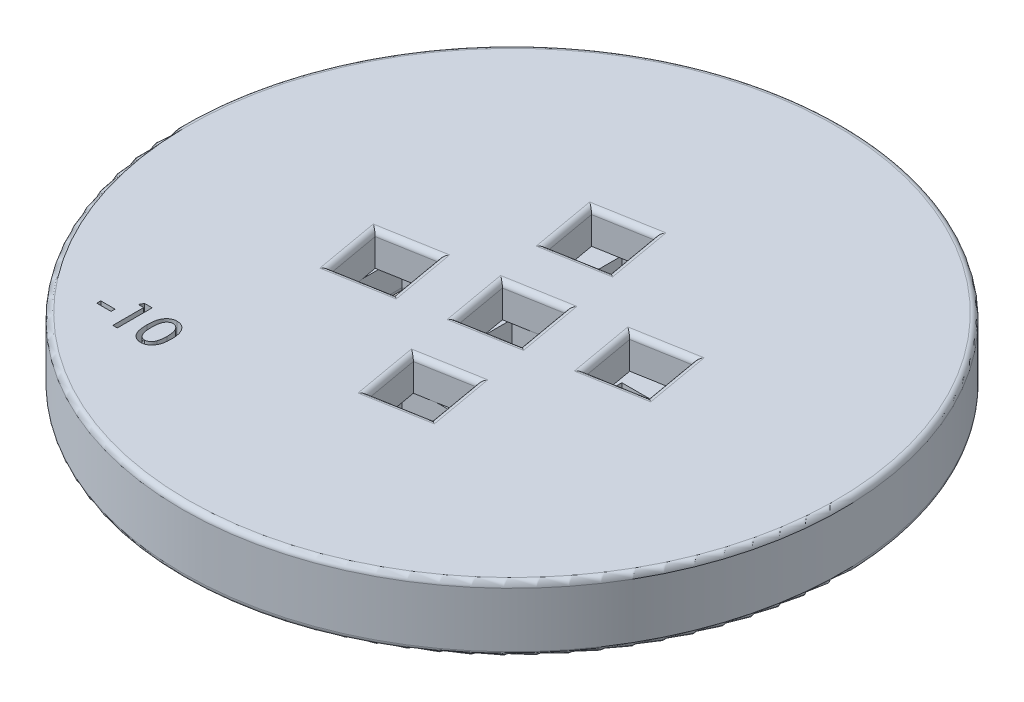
ISO-10303-21;
HEADER;
FILE_DESCRIPTION(('STEP AP214'),'2;1');
FILE_NAME('part.step','',(''),(''),'','','');
FILE_SCHEMA(('AUTOMOTIVE_DESIGN { 1 0 10303 214 1 1 1 1 }'));
ENDSEC;
DATA;
#1=APPLICATION_CONTEXT('core data for automotive mechanical design processes');
#2=APPLICATION_PROTOCOL_DEFINITION('international standard','automotive_design',2000,#1);
#3=PRODUCT_CONTEXT('',#1,'mechanical');
#4=PRODUCT('Part','Part','',(#3));
#5=PRODUCT_RELATED_PRODUCT_CATEGORY('part','',(#4));
#6=PRODUCT_DEFINITION_FORMATION('','',#4);
#7=PRODUCT_DEFINITION_CONTEXT('part definition',#1,'design');
#8=PRODUCT_DEFINITION('design','',#6,#7);
#9=PRODUCT_DEFINITION_SHAPE('','',#8);
#10=(LENGTH_UNIT() NAMED_UNIT(*) SI_UNIT(.MILLI.,.METRE.));
#11=(NAMED_UNIT(*) PLANE_ANGLE_UNIT() SI_UNIT($,.RADIAN.));
#12=(NAMED_UNIT(*) SI_UNIT($,.STERADIAN.) SOLID_ANGLE_UNIT());
#13=UNCERTAINTY_MEASURE_WITH_UNIT(LENGTH_MEASURE(1.E-05),#10,'distance_accuracy_value','');
#14=(GEOMETRIC_REPRESENTATION_CONTEXT(3) GLOBAL_UNCERTAINTY_ASSIGNED_CONTEXT((#13)) GLOBAL_UNIT_ASSIGNED_CONTEXT((#10,
#11,#12)) REPRESENTATION_CONTEXT('',''));
#15=CARTESIAN_POINT('',(0.,0.,0.));
#16=DIRECTION('',(0.,0.,1.));
#17=DIRECTION('',(1.,0.,0.));
#18=AXIS2_PLACEMENT_3D('',#15,#16,#17);
#19=CARTESIAN_POINT('',(0.,3.,0.));
#20=DIRECTION('',(0.,-1.,0.));
#21=DIRECTION('',(0.,0.,-1.));
#22=AXIS2_PLACEMENT_3D('',#19,#20,#21);
#23=PLANE('',#22);
#24=DIRECTION('',(0.,0.,-1.));
#25=VECTOR('',#24,1.);
#26=CARTESIAN_POINT('',(-12.5,3.,-2.5));
#27=LINE('',#26,#25);
#28=CARTESIAN_POINT('',(-12.5,3.,2.5));
#29=VERTEX_POINT('',#28);
#30=CARTESIAN_POINT('',(-12.5,3.,1.09360829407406));
#31=VERTEX_POINT('',#30);
#32=EDGE_CURVE('E983',#29,#31,#27,.T.);
#33=ORIENTED_EDGE('',*,*,#32,.T.);
#34=DIRECTION('',(0.173648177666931,0.,0.984807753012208));
#35=VECTOR('',#34,1.);
#36=CARTESIAN_POINT('',(-11.8759764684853,3.,4.6326216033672));
#37=LINE('',#36,#35);
#38=CARTESIAN_POINT('',(-12.2520151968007,3.,2.5));
#39=VERTEX_POINT('',#38);
#40=EDGE_CURVE('E609',#31,#39,#37,.T.);
#41=ORIENTED_EDGE('',*,*,#40,.T.);
#42=DIRECTION('',(-1.,0.,0.));
#43=VECTOR('',#42,1.);
#44=CARTESIAN_POINT('',(-7.5,3.,2.5));
#45=LINE('',#44,#43);
#46=EDGE_CURVE('E994',#39,#29,#45,.T.);
#47=ORIENTED_EDGE('',*,*,#46,.T.);
#48=EDGE_LOOP('',(#33,#41,#47));
#49=FACE_BOUND('',#48,.T.);
#50=ADVANCED_FACE('F33',(#49),#23,.T.);
#51=DIRECTION('',(-0.173648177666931,0.,-0.984807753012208));
#52=VECTOR('',#51,1.);
#53=CARTESIAN_POINT('',(-6.95193770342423,3.,3.76438071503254));
#54=LINE('',#53,#52);
#55=CARTESIAN_POINT('',(-7.50000000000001,3.,0.656164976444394));
#56=VERTEX_POINT('',#55);
#57=CARTESIAN_POINT('',(-7.82017859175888,3.,-1.1596580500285));
#58=VERTEX_POINT('',#57);
#59=EDGE_CURVE('E625',#56,#58,#54,.T.);
#60=ORIENTED_EDGE('',*,*,#59,.T.);
#61=DIRECTION('',(-0.984807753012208,0.,0.173648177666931));
#62=VECTOR('',#61,1.);
#63=CARTESIAN_POINT('',(-12.7442173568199,3.,-0.291417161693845));
#64=LINE('',#63,#62);
#65=CARTESIAN_POINT('',(-12.5,3.,-0.334479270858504));
#66=VERTEX_POINT('',#65);
#67=EDGE_CURVE('E621',#58,#66,#64,.T.);
#68=ORIENTED_EDGE('',*,*,#67,.T.);
#69=CARTESIAN_POINT('',(-12.5,3.,-2.5));
#70=VERTEX_POINT('',#69);
#71=EDGE_CURVE('E974',#66,#70,#27,.T.);
#72=ORIENTED_EDGE('',*,*,#71,.T.);
#73=DIRECTION('',(1.,0.,0.));
#74=VECTOR('',#73,1.);
#75=CARTESIAN_POINT('',(-7.5,3.,-2.5));
#76=LINE('',#75,#74);
#77=CARTESIAN_POINT('',(-7.5,3.,-2.5));
#78=VERTEX_POINT('',#77);
#79=EDGE_CURVE('E986',#70,#78,#76,.T.);
#80=ORIENTED_EDGE('',*,*,#79,.T.);
#81=DIRECTION('',(0.,0.,1.));
#82=VECTOR('',#81,1.);
#83=CARTESIAN_POINT('',(-7.5,3.,-2.5));
#84=LINE('',#83,#82);
#85=EDGE_CURVE('E991',#78,#56,#84,.T.);
#86=ORIENTED_EDGE('',*,*,#85,.T.);
#87=EDGE_LOOP('',(#60,#68,#72,#80,#86));
#88=FACE_BOUND('',#87,.T.);
#89=ADVANCED_FACE('F1372',(#88),#23,.T.);
#90=CARTESIAN_POINT('',(0.,3.,0.));
#91=DIRECTION('',(0.,-1.,0.));
#92=DIRECTION('',(0.,0.,-1.));
#93=AXIS2_PLACEMENT_3D('',#90,#91,#92);
#94=PLANE('',#93);
#95=DIRECTION('',(0.,0.,1.));
#96=VECTOR('',#95,1.);
#97=CARTESIAN_POINT('',(12.5,3.,-2.49999999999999));
#98=LINE('',#97,#96);
#99=CARTESIAN_POINT('',(12.5,3.,-2.49999999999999));
#100=VERTEX_POINT('',#99);
#101=CARTESIAN_POINT('',(12.5,3.,-1.09360829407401));
#102=VERTEX_POINT('',#101);
#103=EDGE_CURVE('E963',#100,#102,#98,.T.);
#104=ORIENTED_EDGE('',*,*,#103,.T.);
#105=DIRECTION('',(-0.173648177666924,0.,-0.984807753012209));
#106=VECTOR('',#105,1.);
#107=CARTESIAN_POINT('',(12.7442173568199,3.,0.291417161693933));
#108=LINE('',#107,#106);
#109=CARTESIAN_POINT('',(12.2520151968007,3.,-2.49999999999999));
#110=VERTEX_POINT('',#109);
#111=EDGE_CURVE('E645',#102,#110,#108,.T.);
#112=ORIENTED_EDGE('',*,*,#111,.T.);
#113=DIRECTION('',(1.,0.,0.));
#114=VECTOR('',#113,1.);
#115=CARTESIAN_POINT('',(12.5,3.,-2.49999999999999));
#116=LINE('',#115,#114);
#117=EDGE_CURVE('E959',#110,#100,#116,.T.);
#118=ORIENTED_EDGE('',*,*,#117,.T.);
#119=EDGE_LOOP('',(#104,#112,#118));
#120=FACE_BOUND('',#119,.T.);
#121=ADVANCED_FACE('F1491',(#120),#94,.T.);
#122=DIRECTION('',(0.173648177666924,0.,0.984807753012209));
#123=VECTOR('',#122,1.);
#124=CARTESIAN_POINT('',(7.82017859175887,3.,1.15965805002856));
#125=LINE('',#124,#123);
#126=CARTESIAN_POINT('',(7.5,3.,-0.656164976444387));
#127=VERTEX_POINT('',#126);
#128=CARTESIAN_POINT('',(7.82017859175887,3.,1.15965805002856));
#129=VERTEX_POINT('',#128);
#130=EDGE_CURVE('E648',#127,#129,#125,.T.);
#131=ORIENTED_EDGE('',*,*,#130,.T.);
#132=DIRECTION('',(0.984807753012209,0.,-0.173648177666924));
#133=VECTOR('',#132,1.);
#134=CARTESIAN_POINT('',(12.7442173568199,3.,0.291417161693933));
#135=LINE('',#134,#133);
#136=CARTESIAN_POINT('',(12.5,3.,0.33447927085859));
#137=VERTEX_POINT('',#136);
#138=EDGE_CURVE('E653',#129,#137,#135,.T.);
#139=ORIENTED_EDGE('',*,*,#138,.T.);
#140=CARTESIAN_POINT('',(12.5,3.,2.5));
#141=VERTEX_POINT('',#140);
#142=EDGE_CURVE('E962',#137,#141,#98,.T.);
#143=ORIENTED_EDGE('',*,*,#142,.T.);
#144=DIRECTION('',(-1.,0.,0.));
#145=VECTOR('',#144,1.);
#146=CARTESIAN_POINT('',(12.5,3.,2.5));
#147=LINE('',#146,#145);
#148=CARTESIAN_POINT('',(7.5,3.,2.5));
#149=VERTEX_POINT('',#148);
#150=EDGE_CURVE('E966',#141,#149,#147,.T.);
#151=ORIENTED_EDGE('',*,*,#150,.T.);
#152=DIRECTION('',(0.,0.,-1.));
#153=VECTOR('',#152,1.);
#154=CARTESIAN_POINT('',(7.5,3.,-2.49999999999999));
#155=LINE('',#154,#153);
#156=EDGE_CURVE('E956',#149,#127,#155,.T.);
#157=ORIENTED_EDGE('',*,*,#156,.T.);
#158=EDGE_LOOP('',(#131,#139,#143,#151,#157));
#159=FACE_BOUND('',#158,.T.);
#160=ADVANCED_FACE('F1509',(#159),#94,.T.);
#161=CARTESIAN_POINT('',(0.,3.,0.));
#162=DIRECTION('',(0.,-1.,0.));
#163=DIRECTION('',(0.,0.,-1.));
#164=AXIS2_PLACEMENT_3D('',#161,#162,#163);
#165=PLANE('',#164);
#166=DIRECTION('',(-1.,0.,0.));
#167=VECTOR('',#166,1.);
#168=CARTESIAN_POINT('',(2.5,3.,12.5));
#169=LINE('',#168,#167);
#170=CARTESIAN_POINT('',(2.5,3.,12.5));
#171=VERTEX_POINT('',#170);
#172=CARTESIAN_POINT('',(1.09360829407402,3.,12.5));
#173=VERTEX_POINT('',#172);
#174=EDGE_CURVE('E1019',#171,#173,#169,.T.);
#175=ORIENTED_EDGE('',*,*,#174,.T.);
#176=DIRECTION('',(0.984807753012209,0.,-0.173648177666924));
#177=VECTOR('',#176,1.);
#178=CARTESIAN_POINT('',(4.63262160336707,3.,11.8759764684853));
#179=LINE('',#178,#177);
#180=CARTESIAN_POINT('',(2.5,3.,12.2520151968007));
#181=VERTEX_POINT('',#180);
#182=EDGE_CURVE('E684',#173,#181,#179,.T.);
#183=ORIENTED_EDGE('',*,*,#182,.T.);
#184=DIRECTION('',(0.,0.,1.));
#185=VECTOR('',#184,1.);
#186=CARTESIAN_POINT('',(2.5,3.,7.5));
#187=LINE('',#186,#185);
#188=EDGE_CURVE('E1015',#181,#171,#187,.T.);
#189=ORIENTED_EDGE('',*,*,#188,.T.);
#190=EDGE_LOOP('',(#175,#183,#189));
#191=FACE_BOUND('',#190,.T.);
#192=ADVANCED_FACE('F1505',(#191),#165,.T.);
#193=DIRECTION('',(-0.984807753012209,0.,0.173648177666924));
#194=VECTOR('',#193,1.);
#195=CARTESIAN_POINT('',(3.76438071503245,3.,6.95193770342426));
#196=LINE('',#195,#194);
#197=CARTESIAN_POINT('',(0.656164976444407,3.,7.5));
#198=VERTEX_POINT('',#197);
#199=CARTESIAN_POINT('',(-1.1596580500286,3.,7.82017859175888));
#200=VERTEX_POINT('',#199);
#201=EDGE_CURVE('E671',#198,#200,#196,.T.);
#202=ORIENTED_EDGE('',*,*,#201,.T.);
#203=DIRECTION('',(0.173648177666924,0.,0.984807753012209));
#204=VECTOR('',#203,1.);
#205=CARTESIAN_POINT('',(-0.291417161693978,3.,12.7442173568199));
#206=LINE('',#205,#204);
#207=CARTESIAN_POINT('',(-0.334479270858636,3.,12.5));
#208=VERTEX_POINT('',#207);
#209=EDGE_CURVE('E676',#200,#208,#206,.T.);
#210=ORIENTED_EDGE('',*,*,#209,.T.);
#211=CARTESIAN_POINT('',(-2.5,3.,12.5));
#212=VERTEX_POINT('',#211);
#213=EDGE_CURVE('E1018',#208,#212,#169,.T.);
#214=ORIENTED_EDGE('',*,*,#213,.T.);
#215=DIRECTION('',(0.,0.,-1.));
#216=VECTOR('',#215,1.);
#217=CARTESIAN_POINT('',(-2.5,3.,7.5));
#218=LINE('',#217,#216);
#219=CARTESIAN_POINT('',(-2.5,3.,7.5));
#220=VERTEX_POINT('',#219);
#221=EDGE_CURVE('E1000',#212,#220,#218,.T.);
#222=ORIENTED_EDGE('',*,*,#221,.T.);
#223=DIRECTION('',(1.,0.,0.));
#224=VECTOR('',#223,1.);
#225=CARTESIAN_POINT('',(2.5,3.,7.5));
#226=LINE('',#225,#224);
#227=EDGE_CURVE('E1012',#220,#198,#226,.T.);
#228=ORIENTED_EDGE('',*,*,#227,.T.);
#229=EDGE_LOOP('',(#202,#210,#214,#222,#228));
#230=FACE_BOUND('',#229,.T.);
#231=ADVANCED_FACE('F1508',(#230),#165,.T.);
#232=CARTESIAN_POINT('',(0.,3.,0.));
#233=DIRECTION('',(0.,-1.,0.));
#234=DIRECTION('',(0.,0.,-1.));
#235=AXIS2_PLACEMENT_3D('',#232,#233,#234);
#236=PLANE('',#235);
#237=DIRECTION('',(1.,0.,0.));
#238=VECTOR('',#237,1.);
#239=CARTESIAN_POINT('',(-2.5,3.,-12.5));
#240=LINE('',#239,#238);
#241=CARTESIAN_POINT('',(-2.5,3.,-12.5));
#242=VERTEX_POINT('',#241);
#243=CARTESIAN_POINT('',(-1.09360829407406,3.,-12.5));
#244=VERTEX_POINT('',#243);
#245=EDGE_CURVE('E939',#242,#244,#240,.T.);
#246=ORIENTED_EDGE('',*,*,#245,.T.);
#247=DIRECTION('',(-0.984807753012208,0.,0.173648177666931));
#248=VECTOR('',#247,1.);
#249=CARTESIAN_POINT('',(-4.63262160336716,3.,-11.8759764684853));
#250=LINE('',#249,#248);
#251=CARTESIAN_POINT('',(-2.5,3.,-12.2520151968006));
#252=VERTEX_POINT('',#251);
#253=EDGE_CURVE('E712',#244,#252,#250,.T.);
#254=ORIENTED_EDGE('',*,*,#253,.T.);
#255=DIRECTION('',(0.,0.,-1.));
#256=VECTOR('',#255,1.);
#257=CARTESIAN_POINT('',(-2.5,3.,-7.5));
#258=LINE('',#257,#256);
#259=EDGE_CURVE('E935',#252,#242,#258,.T.);
#260=ORIENTED_EDGE('',*,*,#259,.T.);
#261=EDGE_LOOP('',(#246,#254,#260));
#262=FACE_BOUND('',#261,.T.);
#263=ADVANCED_FACE('F1444',(#262),#236,.T.);
#264=DIRECTION('',(0.984807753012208,0.,-0.173648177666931));
#265=VECTOR('',#264,1.);
#266=CARTESIAN_POINT('',(-3.7643807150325,3.,-6.95193770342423));
#267=LINE('',#266,#265);
#268=CARTESIAN_POINT('',(-0.65616497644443,3.,-7.5));
#269=VERTEX_POINT('',#268);
#270=CARTESIAN_POINT('',(1.15965805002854,3.,-7.82017859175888));
#271=VERTEX_POINT('',#270);
#272=EDGE_CURVE('E699',#269,#271,#267,.T.);
#273=ORIENTED_EDGE('',*,*,#272,.T.);
#274=DIRECTION('',(-0.173648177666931,0.,-0.984807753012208));
#275=VECTOR('',#274,1.);
#276=CARTESIAN_POINT('',(1.15965805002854,3.,-7.82017859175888));
#277=LINE('',#276,#275);
#278=CARTESIAN_POINT('',(0.33447927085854,3.,-12.5));
#279=VERTEX_POINT('',#278);
#280=EDGE_CURVE('E704',#271,#279,#277,.T.);
#281=ORIENTED_EDGE('',*,*,#280,.T.);
#282=CARTESIAN_POINT('',(2.5,3.,-12.5));
#283=VERTEX_POINT('',#282);
#284=EDGE_CURVE('E938',#279,#283,#240,.T.);
#285=ORIENTED_EDGE('',*,*,#284,.T.);
#286=DIRECTION('',(0.,0.,1.));
#287=VECTOR('',#286,1.);
#288=CARTESIAN_POINT('',(2.5,3.,-7.5));
#289=LINE('',#288,#287);
#290=CARTESIAN_POINT('',(2.5,3.,-7.5));
#291=VERTEX_POINT('',#290);
#292=EDGE_CURVE('E927',#283,#291,#289,.T.);
#293=ORIENTED_EDGE('',*,*,#292,.T.);
#294=DIRECTION('',(-1.,0.,0.));
#295=VECTOR('',#294,1.);
#296=CARTESIAN_POINT('',(-2.5,3.,-7.5));
#297=LINE('',#296,#295);
#298=EDGE_CURVE('E932',#291,#269,#297,.T.);
#299=ORIENTED_EDGE('',*,*,#298,.T.);
#300=EDGE_LOOP('',(#273,#281,#285,#293,#299));
#301=FACE_BOUND('',#300,.T.);
#302=ADVANCED_FACE('F1465',(#301),#236,.T.);
#303=CARTESIAN_POINT('',(0.,3.,0.));
#304=DIRECTION('',(0.,-1.,0.));
#305=DIRECTION('',(0.,0.,-1.));
#306=AXIS2_PLACEMENT_3D('',#303,#304,#305);
#307=PLANE('',#306);
#308=DIRECTION('',(0.,0.,-1.));
#309=VECTOR('',#308,1.);
#310=CARTESIAN_POINT('',(-2.5,3.,-2.5));
#311=LINE('',#310,#309);
#312=CARTESIAN_POINT('',(-2.5,3.,2.5));
#313=VERTEX_POINT('',#312);
#314=CARTESIAN_POINT('',(-2.50000000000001,3.,0.218721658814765));
#315=VERTEX_POINT('',#314);
#316=EDGE_CURVE('E1036',#313,#315,#311,.T.);
#317=ORIENTED_EDGE('',*,*,#316,.T.);
#318=DIRECTION('',(0.173648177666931,0.,0.984807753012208));
#319=VECTOR('',#318,1.);
#320=CARTESIAN_POINT('',(-2.02789893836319,3.,2.89613982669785));
#321=LINE('',#320,#319);
#322=CARTESIAN_POINT('',(-2.0977490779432,3.,2.5));
#323=VERTEX_POINT('',#322);
#324=EDGE_CURVE('E729',#315,#323,#321,.T.);
#325=ORIENTED_EDGE('',*,*,#324,.T.);
#326=DIRECTION('',(-1.,0.,0.));
#327=VECTOR('',#326,1.);
#328=CARTESIAN_POINT('',(2.5,3.,2.5));
#329=LINE('',#328,#327);
#330=EDGE_CURVE('E1049',#323,#313,#329,.T.);
#331=ORIENTED_EDGE('',*,*,#330,.T.);
#332=EDGE_LOOP('',(#317,#325,#331));
#333=FACE_BOUND('',#332,.T.);
#334=ADVANCED_FACE('F1527',(#333),#307,.T.);
#335=DIRECTION('',(1.,0.,0.));
#336=VECTOR('',#335,1.);
#337=CARTESIAN_POINT('',(2.5,3.,-2.5));
#338=LINE('',#337,#336);
#339=CARTESIAN_POINT('',(-2.5,3.,-2.5));
#340=VERTEX_POINT('',#339);
#341=CARTESIAN_POINT('',(-0.218721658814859,3.,-2.49999999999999));
#342=VERTEX_POINT('',#341);
#343=EDGE_CURVE('E1041',#340,#342,#338,.T.);
#344=ORIENTED_EDGE('',*,*,#343,.T.);
#345=DIRECTION('',(-0.984807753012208,0.,0.173648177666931));
#346=VECTOR('',#345,1.);
#347=CARTESIAN_POINT('',(-2.89613982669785,3.,-2.02789893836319));
#348=LINE('',#347,#346);
#349=CARTESIAN_POINT('',(-2.5,3.,-2.0977490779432));
#350=VERTEX_POINT('',#349);
#351=EDGE_CURVE('E744',#342,#350,#348,.T.);
#352=ORIENTED_EDGE('',*,*,#351,.T.);
#353=EDGE_CURVE('E1027',#350,#340,#311,.T.);
#354=ORIENTED_EDGE('',*,*,#353,.T.);
#355=EDGE_LOOP('',(#344,#352,#354));
#356=FACE_BOUND('',#355,.T.);
#357=ADVANCED_FACE('F1530',(#356),#307,.T.);
#358=DIRECTION('',(0.,0.,1.));
#359=VECTOR('',#358,1.);
#360=CARTESIAN_POINT('',(2.5,3.,-2.5));
#361=LINE('',#360,#359);
#362=CARTESIAN_POINT('',(2.5,3.,-2.5));
#363=VERTEX_POINT('',#362);
#364=CARTESIAN_POINT('',(2.5,3.,-0.218721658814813));
#365=VERTEX_POINT('',#364);
#366=EDGE_CURVE('E1046',#363,#365,#361,.T.);
#367=ORIENTED_EDGE('',*,*,#366,.T.);
#368=DIRECTION('',(-0.173648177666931,0.,-0.984807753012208));
#369=VECTOR('',#368,1.);
#370=CARTESIAN_POINT('',(2.89613982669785,3.,2.02789893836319));
#371=LINE('',#370,#369);
#372=CARTESIAN_POINT('',(2.0977490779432,3.,-2.5));
#373=VERTEX_POINT('',#372);
#374=EDGE_CURVE('E739',#365,#373,#371,.T.);
#375=ORIENTED_EDGE('',*,*,#374,.T.);
#376=EDGE_CURVE('E1039',#373,#363,#338,.T.);
#377=ORIENTED_EDGE('',*,*,#376,.T.);
#378=EDGE_LOOP('',(#367,#375,#377));
#379=FACE_BOUND('',#378,.T.);
#380=ADVANCED_FACE('F2289',(#379),#307,.T.);
#381=CARTESIAN_POINT('',(2.5,3.,2.5));
#382=VERTEX_POINT('',#381);
#383=CARTESIAN_POINT('',(0.218721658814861,3.,2.49999999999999));
#384=VERTEX_POINT('',#383);
#385=EDGE_CURVE('E1051',#382,#384,#329,.T.);
#386=ORIENTED_EDGE('',*,*,#385,.T.);
#387=DIRECTION('',(0.984807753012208,0.,-0.173648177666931));
#388=VECTOR('',#387,1.);
#389=CARTESIAN_POINT('',(-2.02789893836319,3.,2.89613982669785));
#390=LINE('',#389,#388);
#391=CARTESIAN_POINT('',(2.5,3.,2.0977490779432));
#392=VERTEX_POINT('',#391);
#393=EDGE_CURVE('E734',#384,#392,#390,.T.);
#394=ORIENTED_EDGE('',*,*,#393,.T.);
#395=EDGE_CURVE('E1044',#392,#382,#361,.T.);
#396=ORIENTED_EDGE('',*,*,#395,.T.);
#397=EDGE_LOOP('',(#386,#394,#396));
#398=FACE_BOUND('',#397,.T.);
#399=ADVANCED_FACE('F1532',(#398),#307,.T.);
#400=CARTESIAN_POINT('',(0.,6.,0.));
#401=DIRECTION('',(0.,1.,0.));
#402=DIRECTION('',(0.,0.,1.));
#403=AXIS2_PLACEMENT_3D('',#400,#401,#402);
#404=PLANE('',#403);
#405=DIRECTION('',(-0.173648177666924,0.,-0.984807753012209));
#406=VECTOR('',#405,1.);
#407=CARTESIAN_POINT('',(13.236621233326,6.,0.204593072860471));
#408=LINE('',#407,#406);
#409=CARTESIAN_POINT('',(12.2815562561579,6.,-5.21184956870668));
#410=VERTEX_POINT('',#409);
#411=CARTESIAN_POINT('',(13.3234453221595,6.,0.696996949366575));
#412=VERTEX_POINT('',#411);
#413=EDGE_CURVE('E1260',#410,#412,#408,.F.);
#414=ORIENTED_EDGE('',*,*,#413,.T.);
#415=DIRECTION('',(0.984807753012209,0.,-0.173648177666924));
#416=VECTOR('',#415,1.);
#417=CARTESIAN_POINT('',(7.90700268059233,6.,1.65206192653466));
#418=LINE('',#417,#416);
#419=CARTESIAN_POINT('',(7.41459880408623,6.,1.73888601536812));
#420=VERTEX_POINT('',#419);
#421=EDGE_CURVE('E1262',#412,#420,#418,.F.);
#422=ORIENTED_EDGE('',*,*,#421,.T.);
#423=DIRECTION('',(0.173648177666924,0.,0.984807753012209));
#424=VECTOR('',#423,1.);
#425=CARTESIAN_POINT('',(6.45953382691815,6.,-3.67755662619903));
#426=LINE('',#425,#424);
#427=CARTESIAN_POINT('',(6.37270973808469,6.,-4.16996050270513));
#428=VERTEX_POINT('',#427);
#429=EDGE_CURVE('E1258',#420,#428,#426,.F.);
#430=ORIENTED_EDGE('',*,*,#429,.T.);
#431=DIRECTION('',(-0.984807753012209,0.,0.173648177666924));
#432=VECTOR('',#431,1.);
#433=CARTESIAN_POINT('',(11.7891523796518,6.,-5.12502547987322));
#434=LINE('',#433,#432);
#435=EDGE_CURVE('E1256',#428,#410,#434,.F.);
#436=ORIENTED_EDGE('',*,*,#435,.T.);
#437=EDGE_LOOP('',(#414,#422,#430,#436));
#438=FACE_BOUND('',#437,.T.);
#439=DIRECTION('',(-0.173648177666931,0.,-0.984807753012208));
#440=VECTOR('',#439,1.);
#441=CARTESIAN_POINT('',(1.65206192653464,6.,-7.90700268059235));
#442=LINE('',#441,#440);
#443=CARTESIAN_POINT('',(0.696996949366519,6.,-13.3234453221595));
#444=VERTEX_POINT('',#443);
#445=CARTESIAN_POINT('',(1.73888601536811,6.,-7.41459880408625));
#446=VERTEX_POINT('',#445);
#447=EDGE_CURVE('E1251',#444,#446,#442,.F.);
#448=ORIENTED_EDGE('',*,*,#447,.T.);
#449=DIRECTION('',(0.984807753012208,0.,-0.173648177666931));
#450=VECTOR('',#449,1.);
#451=CARTESIAN_POINT('',(-3.67755662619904,6.,-6.45953382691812));
#452=LINE('',#451,#450);
#453=CARTESIAN_POINT('',(-4.16996050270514,6.,-6.37270973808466));
#454=VERTEX_POINT('',#453);
#455=EDGE_CURVE('E1253',#446,#454,#452,.F.);
#456=ORIENTED_EDGE('',*,*,#455,.T.);
#457=DIRECTION('',(0.173648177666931,0.,0.984807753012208));
#458=VECTOR('',#457,1.);
#459=CARTESIAN_POINT('',(-5.12502547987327,6.,-11.7891523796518));
#460=LINE('',#459,#458);
#461=CARTESIAN_POINT('',(-5.21184956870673,6.,-12.2815562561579));
#462=VERTEX_POINT('',#461);
#463=EDGE_CURVE('E1247',#454,#462,#460,.F.);
#464=ORIENTED_EDGE('',*,*,#463,.T.);
#465=DIRECTION('',(-0.984807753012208,0.,0.173648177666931));
#466=VECTOR('',#465,1.);
#467=CARTESIAN_POINT('',(0.204593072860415,6.,-13.236621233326));
#468=LINE('',#467,#466);
#469=EDGE_CURVE('E1249',#462,#444,#468,.F.);
#470=ORIENTED_EDGE('',*,*,#469,.T.);
#471=EDGE_LOOP('',(#448,#456,#464,#470));
#472=FACE_BOUND('',#471,.T.);
#473=DIRECTION('',(-0.173648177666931,0.,-0.984807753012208));
#474=VECTOR('',#473,1.);
#475=CARTESIAN_POINT('',(3.38854370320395,6.,1.94107484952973));
#476=LINE('',#475,#474);
#477=CARTESIAN_POINT('',(2.43347872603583,6.,-3.47536779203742));
#478=VERTEX_POINT('',#477);
#479=CARTESIAN_POINT('',(3.47536779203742,6.,2.43347872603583));
#480=VERTEX_POINT('',#479);
#481=EDGE_CURVE('E1238',#478,#480,#476,.F.);
#482=ORIENTED_EDGE('',*,*,#481,.T.);
#483=DIRECTION('',(0.984807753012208,0.,-0.173648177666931));
#484=VECTOR('',#483,1.);
#485=CARTESIAN_POINT('',(-1.94107484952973,6.,3.38854370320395));
#486=LINE('',#485,#484);
#487=CARTESIAN_POINT('',(-2.43347872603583,6.,3.47536779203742));
#488=VERTEX_POINT('',#487);
#489=EDGE_CURVE('E1244',#480,#488,#486,.F.);
#490=ORIENTED_EDGE('',*,*,#489,.T.);
#491=DIRECTION('',(0.173648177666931,0.,0.984807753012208));
#492=VECTOR('',#491,1.);
#493=CARTESIAN_POINT('',(-3.38854370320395,6.,-1.94107484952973));
#494=LINE('',#493,#492);
#495=CARTESIAN_POINT('',(-3.47536779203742,6.,-2.43347872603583));
#496=VERTEX_POINT('',#495);
#497=EDGE_CURVE('E1242',#488,#496,#494,.F.);
#498=ORIENTED_EDGE('',*,*,#497,.T.);
#499=DIRECTION('',(-0.984807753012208,0.,0.173648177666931));
#500=VECTOR('',#499,1.);
#501=CARTESIAN_POINT('',(1.94107484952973,6.,-3.38854370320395));
#502=LINE('',#501,#500);
#503=EDGE_CURVE('E1240',#496,#478,#502,.F.);
#504=ORIENTED_EDGE('',*,*,#503,.T.);
#505=EDGE_LOOP('',(#482,#490,#498,#504));
#506=FACE_BOUND('',#505,.T.);
#507=DIRECTION('',(-0.173648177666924,0.,-0.984807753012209));
#508=VECTOR('',#507,1.);
#509=CARTESIAN_POINT('',(5.12502547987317,6.,11.7891523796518));
#510=LINE('',#509,#508);
#511=CARTESIAN_POINT('',(4.16996050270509,6.,6.3727097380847));
#512=VERTEX_POINT('',#511);
#513=CARTESIAN_POINT('',(5.21184956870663,6.,12.281556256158));
#514=VERTEX_POINT('',#513);
#515=EDGE_CURVE('E1233',#512,#514,#510,.F.);
#516=ORIENTED_EDGE('',*,*,#515,.T.);
#517=DIRECTION('',(0.984807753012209,0.,-0.173648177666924));
#518=VECTOR('',#517,1.);
#519=CARTESIAN_POINT('',(-0.204593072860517,6.,13.236621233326));
#520=LINE('',#519,#518);
#521=CARTESIAN_POINT('',(-0.696996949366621,6.,13.3234453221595));
#522=VERTEX_POINT('',#521);
#523=EDGE_CURVE('E1235',#514,#522,#520,.F.);
#524=ORIENTED_EDGE('',*,*,#523,.T.);
#525=DIRECTION('',(0.173648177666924,0.,0.984807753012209));
#526=VECTOR('',#525,1.);
#527=CARTESIAN_POINT('',(-1.6520619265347,6.,7.90700268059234));
#528=LINE('',#527,#526);
#529=CARTESIAN_POINT('',(-1.73888601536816,6.,7.41459880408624));
#530=VERTEX_POINT('',#529);
#531=EDGE_CURVE('E1229',#522,#530,#528,.F.);
#532=ORIENTED_EDGE('',*,*,#531,.T.);
#533=DIRECTION('',(-0.984807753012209,0.,0.173648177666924));
#534=VECTOR('',#533,1.);
#535=CARTESIAN_POINT('',(3.67755662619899,6.,6.45953382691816));
#536=LINE('',#535,#534);
#537=EDGE_CURVE('E1231',#530,#512,#536,.F.);
#538=ORIENTED_EDGE('',*,*,#537,.T.);
#539=EDGE_LOOP('',(#516,#524,#532,#538));
#540=FACE_BOUND('',#539,.T.);
#541=DIRECTION('',(-0.173648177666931,0.,-0.984807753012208));
#542=VECTOR('',#541,1.);
#543=CARTESIAN_POINT('',(-6.45953382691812,6.,3.67755662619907));
#544=LINE('',#543,#542);
#545=CARTESIAN_POINT('',(-7.41459880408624,6.,-1.73888601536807));
#546=VERTEX_POINT('',#545);
#547=CARTESIAN_POINT('',(-6.37270973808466,6.,4.16996050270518));
#548=VERTEX_POINT('',#547);
#549=EDGE_CURVE('E1224',#546,#548,#544,.F.);
#550=ORIENTED_EDGE('',*,*,#549,.T.);
#551=DIRECTION('',(0.984807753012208,0.,-0.173648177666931));
#552=VECTOR('',#551,1.);
#553=CARTESIAN_POINT('',(-11.7891523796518,6.,5.1250254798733));
#554=LINE('',#553,#552);
#555=CARTESIAN_POINT('',(-12.2815562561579,6.,5.21184956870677));
#556=VERTEX_POINT('',#555);
#557=EDGE_CURVE('E1226',#548,#556,#554,.F.);
#558=ORIENTED_EDGE('',*,*,#557,.T.);
#559=DIRECTION('',(0.173648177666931,0.,0.984807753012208));
#560=VECTOR('',#559,1.);
#561=CARTESIAN_POINT('',(-13.236621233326,6.,-0.20459307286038));
#562=LINE('',#561,#560);
#563=CARTESIAN_POINT('',(-13.3234453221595,6.,-0.696996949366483));
#564=VERTEX_POINT('',#563);
#565=EDGE_CURVE('E1220',#556,#564,#562,.F.);
#566=ORIENTED_EDGE('',*,*,#565,.T.);
#567=DIRECTION('',(-0.984807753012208,0.,0.173648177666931));
#568=VECTOR('',#567,1.);
#569=CARTESIAN_POINT('',(-7.90700268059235,6.,-1.6520619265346));
#570=LINE('',#569,#568);
#571=EDGE_CURVE('E1222',#564,#546,#570,.F.);
#572=ORIENTED_EDGE('',*,*,#571,.T.);
#573=EDGE_LOOP('',(#550,#558,#566,#572));
#574=FACE_BOUND('',#573,.T.);
#575=DIRECTION('',(-1.,0.,0.));
#576=VECTOR('',#575,1.);
#577=CARTESIAN_POINT('',(-17.1873388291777,6.,16.3378246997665));
#578=LINE('',#577,#576);
#579=CARTESIAN_POINT('',(-17.1873388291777,6.,16.3378246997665));
#580=VERTEX_POINT('',#579);
#581=CARTESIAN_POINT('',(-17.6758003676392,6.,16.3378246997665));
#582=VERTEX_POINT('',#581);
#583=EDGE_CURVE('E855',#580,#582,#578,.T.);
#584=ORIENTED_EDGE('',*,*,#583,.T.);
#585=DIRECTION('',(0.487957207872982,0.,-0.872867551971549));
#586=VECTOR('',#585,1.);
#587=CARTESIAN_POINT('',(-17.6758003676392,6.,16.3378246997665));
#588=LINE('',#587,#586);
#589=CARTESIAN_POINT('',(-17.4710026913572,6.,15.9714785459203));
#590=VERTEX_POINT('',#589);
#591=EDGE_CURVE('E850',#582,#590,#588,.T.);
#592=ORIENTED_EDGE('',*,*,#591,.T.);
#593=DIRECTION('',(1.,0.,0.));
#594=VECTOR('',#593,1.);
#595=CARTESIAN_POINT('',(-17.4710026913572,6.,15.9714785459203));
#596=LINE('',#595,#594);
#597=CARTESIAN_POINT('',(-16.7802875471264,6.,15.9714785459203));
#598=VERTEX_POINT('',#597);
#599=EDGE_CURVE('E868',#590,#598,#596,.T.);
#600=ORIENTED_EDGE('',*,*,#599,.T.);
#601=DIRECTION('',(0.,0.,1.));
#602=VECTOR('',#601,1.);
#603=CARTESIAN_POINT('',(-16.7802875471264,6.,15.9714785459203));
#604=LINE('',#603,#602);
#605=CARTESIAN_POINT('',(-16.7802875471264,6.,19.1464785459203));
#606=VERTEX_POINT('',#605);
#607=EDGE_CURVE('E871',#598,#606,#604,.T.);
#608=ORIENTED_EDGE('',*,*,#607,.T.);
#609=DIRECTION('',(-1.,0.,0.));
#610=VECTOR('',#609,1.);
#611=CARTESIAN_POINT('',(-16.7802875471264,6.,19.1464785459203));
#612=LINE('',#611,#610);
#613=CARTESIAN_POINT('',(-17.1873388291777,6.,19.1464785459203));
#614=VERTEX_POINT('',#613);
#615=EDGE_CURVE('E874',#606,#614,#612,.T.);
#616=ORIENTED_EDGE('',*,*,#615,.T.);
#617=DIRECTION('',(0.,0.,-1.));
#618=VECTOR('',#617,1.);
#619=CARTESIAN_POINT('',(-17.1873388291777,6.,19.1464785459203));
#620=LINE('',#619,#618);
#621=EDGE_CURVE('E877',#614,#580,#620,.T.);
#622=ORIENTED_EDGE('',*,*,#621,.T.);
#623=EDGE_LOOP('',(#584,#592,#600,#608,#616,#622));
#624=FACE_BOUND('',#623,.T.);
#625=CARTESIAN_POINT('',(0.,6.,0.));
#626=DIRECTION('',(0.,1.,0.));
#627=DIRECTION('',(0.,0.,1.));
#628=AXIS2_PLACEMENT_3D('',#625,#626,#627);
#629=CIRCLE('',#628,29.5);
#630=CARTESIAN_POINT('',(0.,6.,29.5));
#631=VERTEX_POINT('',#630);
#632=EDGE_CURVE('E1163',#631,#631,#629,.T.);
#633=ORIENTED_EDGE('',*,*,#632,.T.);
#634=EDGE_LOOP('',(#633));
#635=FACE_BOUND('',#634,.T.);
#636=DIRECTION('',(-1.,0.,0.));
#637=VECTOR('',#636,1.);
#638=CARTESIAN_POINT('',(-18.3677875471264,6.,18.1288503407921));
#639=LINE('',#638,#637);
#640=CARTESIAN_POINT('',(-18.3677875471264,6.,18.1288503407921));
#641=VERTEX_POINT('',#640);
#642=CARTESIAN_POINT('',(-19.6703516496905,6.,18.1288503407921));
#643=VERTEX_POINT('',#642);
#644=EDGE_CURVE('E900',#641,#643,#639,.T.);
#645=ORIENTED_EDGE('',*,*,#644,.T.);
#646=DIRECTION('',(0.,0.,-1.));
#647=VECTOR('',#646,1.);
#648=CARTESIAN_POINT('',(-19.6703516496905,6.,18.1288503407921));
#649=LINE('',#648,#647);
#650=CARTESIAN_POINT('',(-19.6703516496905,6.,17.762504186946));
#651=VERTEX_POINT('',#650);
#652=EDGE_CURVE('E895',#643,#651,#649,.T.);
#653=ORIENTED_EDGE('',*,*,#652,.T.);
#654=DIRECTION('',(1.,0.,0.));
#655=VECTOR('',#654,1.);
#656=CARTESIAN_POINT('',(-19.6703516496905,6.,17.762504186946));
#657=LINE('',#656,#655);
#658=CARTESIAN_POINT('',(-18.3677875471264,6.,17.762504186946));
#659=VERTEX_POINT('',#658);
#660=EDGE_CURVE('E909',#651,#659,#657,.T.);
#661=ORIENTED_EDGE('',*,*,#660,.T.);
#662=DIRECTION('',(0.,0.,1.));
#663=VECTOR('',#662,1.);
#664=CARTESIAN_POINT('',(-18.3677875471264,6.,17.762504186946));
#665=LINE('',#664,#663);
#666=EDGE_CURVE('E912',#659,#641,#665,.T.);
#667=ORIENTED_EDGE('',*,*,#666,.T.);
#668=EDGE_LOOP('',(#645,#653,#661,#667));
#669=FACE_BOUND('',#668,.T.);
#670=CARTESIAN_POINT('',(-13.4424670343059,6.,17.5602505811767));
#671=CARTESIAN_POINT('',(-13.4430590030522,6.,17.6077443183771));
#672=CARTESIAN_POINT('',(-13.4442117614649,6.,17.7002302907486));
#673=CARTESIAN_POINT('',(-13.4501581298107,6.,17.8354235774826));
#674=CARTESIAN_POINT('',(-13.4620128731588,6.,17.9632830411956));
#675=CARTESIAN_POINT('',(-13.4766091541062,6.,18.0841675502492));
#676=CARTESIAN_POINT('',(-13.4970827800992,6.,18.197709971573));
#677=CARTESIAN_POINT('',(-13.5220117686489,6.,18.303970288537));
#678=CARTESIAN_POINT('',(-13.5499676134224,6.,18.40350718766));
#679=CARTESIAN_POINT('',(-13.58414227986,6.,18.4954483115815));
#680=CARTESIAN_POINT('',(-13.6219835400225,6.,18.5813410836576));
#681=CARTESIAN_POINT('',(-13.6630387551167,6.,18.6620318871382));
#682=CARTESIAN_POINT('',(-13.708254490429,6.,18.7376797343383));
#683=CARTESIAN_POINT('',(-13.758319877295,6.,18.8074638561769));
#684=CARTESIAN_POINT('',(-13.8108492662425,6.,18.8735800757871));
#685=CARTESIAN_POINT('',(-13.8681247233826,6.,18.9337304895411));
#686=CARTESIAN_POINT('',(-13.9291024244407,6.,18.9890616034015));
#687=CARTESIAN_POINT('',(-13.9936348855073,6.,19.038868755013));
#688=CARTESIAN_POINT('',(-14.0609834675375,6.,19.0837848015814));
#689=CARTESIAN_POINT('',(-14.1315706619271,6.,19.1216993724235));
#690=CARTESIAN_POINT('',(-14.2036171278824,6.,19.1553523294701));
#691=CARTESIAN_POINT('',(-14.2787314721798,6.,19.1808562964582));
#692=CARTESIAN_POINT('',(-14.3553910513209,6.,19.2026218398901));
#693=CARTESIAN_POINT('',(-14.4348866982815,6.,19.216681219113));
#694=CARTESIAN_POINT('',(-14.5164804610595,6.,19.2259897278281));
#695=CARTESIAN_POINT('',(-14.5715840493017,6.,19.2272520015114));
#696=CARTESIAN_POINT('',(-14.599383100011,6.,19.2278888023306));
#697=B_SPLINE_CURVE_WITH_KNOTS('',3,(#670,#671,#672,#673,#674,#675,#676,#677,#678,#679,#680,
#681,#682,#683,#684,#685,#686,#687,#688,#689,#690,#691,#692,#693,#694,#695,#696),.UNSPECIFIED.,
.F.,.F.,(4,1,1,1,1,1,1,1,1,1,1,1,1,1,1,1,1,1,1,1,1,1,1,1,4),(0.,0.0623586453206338,
0.12143285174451,0.177603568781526,0.230908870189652,0.281248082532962,0.328981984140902,
0.374173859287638,0.41688378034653,0.457636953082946,0.497347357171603,0.535678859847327,
0.573212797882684,0.610031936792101,0.64645653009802,0.682124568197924,0.718035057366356,
0.753392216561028,0.788268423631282,0.823144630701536,0.857652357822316,0.892293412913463,
0.927670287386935,0.963510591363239,1.),.UNSPECIFIED.);
#698=CARTESIAN_POINT('',(-13.4424670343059,6.,17.5602505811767));
#699=VERTEX_POINT('',#698);
#700=CARTESIAN_POINT('',(-14.599383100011,6.,19.2278888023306));
#701=VERTEX_POINT('',#700);
#702=EDGE_CURVE('E829',#699,#701,#697,.T.);
#703=ORIENTED_EDGE('',*,*,#702,.T.);
#704=CARTESIAN_POINT('',(-14.599383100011,6.,19.2278888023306));
#705=CARTESIAN_POINT('',(-14.6250577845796,6.,19.2274525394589));
#706=CARTESIAN_POINT('',(-14.6759083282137,6.,19.226588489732));
#707=CARTESIAN_POINT('',(-14.7509973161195,6.,19.2181141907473));
#708=CARTESIAN_POINT('',(-14.8241447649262,6.,19.204049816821));
#709=CARTESIAN_POINT('',(-14.8951358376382,6.,19.1843379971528));
#710=CARTESIAN_POINT('',(-14.9644693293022,6.,19.159311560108));
#711=CARTESIAN_POINT('',(-15.0318445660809,6.,19.1289955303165));
#712=CARTESIAN_POINT('',(-15.0968187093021,6.,19.0922865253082));
#713=CARTESIAN_POINT('',(-15.1600118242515,6.,19.0510408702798));
#714=CARTESIAN_POINT('',(-15.2205061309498,6.,19.0041269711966));
#715=CARTESIAN_POINT('',(-15.276852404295,6.,18.9511025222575));
#716=CARTESIAN_POINT('',(-15.330405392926,6.,18.8932347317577));
#717=CARTESIAN_POINT('',(-15.3801041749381,6.,18.8298995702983));
#718=CARTESIAN_POINT('',(-15.4270470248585,6.,18.7615058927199));
#719=CARTESIAN_POINT('',(-15.469365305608,6.,18.6874093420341));
#720=CARTESIAN_POINT('',(-15.5088196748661,6.,18.6084012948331));
#721=CARTESIAN_POINT('',(-15.5453988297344,6.,18.5238731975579));
#722=CARTESIAN_POINT('',(-15.5784263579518,6.,18.4323564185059));
#723=CARTESIAN_POINT('',(-15.6047687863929,6.,18.3320605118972));
#724=CARTESIAN_POINT('',(-15.6296094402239,6.,18.2240798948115));
#725=CARTESIAN_POINT('',(-15.6478389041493,6.,18.1073221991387));
#726=CARTESIAN_POINT('',(-15.6636553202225,6.,17.9826682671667));
#727=CARTESIAN_POINT('',(-15.6728313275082,6.,17.8493088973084));
#728=CARTESIAN_POINT('',(-15.6806729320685,6.,17.7076863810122));
#729=CARTESIAN_POINT('',(-15.6810535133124,6.,17.6102968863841));
#730=CARTESIAN_POINT('',(-15.681249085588,6.,17.5602505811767));
#731=B_SPLINE_CURVE_WITH_KNOTS('',3,(#704,#705,#706,#707,#708,#709,#710,#711,#712,#713,#714,
#715,#716,#717,#718,#719,#720,#721,#722,#723,#724,#725,#726,#727,#728,#729,#730),.UNSPECIFIED.,
.F.,.F.,(4,1,1,1,1,1,1,1,1,1,1,1,1,1,1,1,1,1,1,1,1,1,1,1,4),(0.,0.0344225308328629,
0.0681762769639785,0.101187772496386,0.134229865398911,0.166878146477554,0.199963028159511,
0.233185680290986,0.266859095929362,0.30109795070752,0.335699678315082,0.370509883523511,
0.406744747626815,0.443573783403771,0.481662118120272,0.521080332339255,0.561961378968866,
0.605128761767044,0.651412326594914,0.700940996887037,0.753667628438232,0.809812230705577,
0.869410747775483,0.932893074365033,1.),.UNSPECIFIED.);
#732=CARTESIAN_POINT('',(-15.681249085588,6.,17.5602505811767));
#733=VERTEX_POINT('',#732);
#734=EDGE_CURVE('E804',#701,#733,#731,.T.);
#735=ORIENTED_EDGE('',*,*,#734,.T.);
#736=CARTESIAN_POINT('',(-15.681249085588,6.,17.5602505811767));
#737=CARTESIAN_POINT('',(-15.6809460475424,6.,17.5097869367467));
#738=CARTESIAN_POINT('',(-15.6803575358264,6.,17.4117845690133));
#739=CARTESIAN_POINT('',(-15.6740160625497,6.,17.2692162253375));
#740=CARTESIAN_POINT('',(-15.6630765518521,6.,17.1353944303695));
#741=CARTESIAN_POINT('',(-15.6490251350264,6.,17.0103152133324));
#742=CARTESIAN_POINT('',(-15.6295853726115,6.,16.8938926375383));
#743=CARTESIAN_POINT('',(-15.6073422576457,6.,16.7860691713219));
#744=CARTESIAN_POINT('',(-15.579961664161,6.,16.686831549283));
#745=CARTESIAN_POINT('',(-15.5479801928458,6.,16.596002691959));
#746=CARTESIAN_POINT('',(-15.5120714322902,6.,16.5119694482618));
#747=CARTESIAN_POINT('',(-15.4725895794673,6.,16.4336792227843));
#748=CARTESIAN_POINT('',(-15.4297846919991,6.,16.3601380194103));
#749=CARTESIAN_POINT('',(-15.3839458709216,6.,16.2913714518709));
#750=CARTESIAN_POINT('',(-15.3329059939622,6.,16.2289115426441));
#751=CARTESIAN_POINT('',(-15.2796614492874,6.,16.1706192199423));
#752=CARTESIAN_POINT('',(-15.222213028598,6.,16.1176323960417));
#753=CARTESIAN_POINT('',(-15.1610871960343,6.,16.070216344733));
#754=CARTESIAN_POINT('',(-15.0978558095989,6.,16.0273477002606));
#755=CARTESIAN_POINT('',(-15.0317712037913,6.,15.991215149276));
#756=CARTESIAN_POINT('',(-14.9643645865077,6.,15.959740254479));
#757=CARTESIAN_POINT('',(-14.8947763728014,6.,15.9342797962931));
#758=CARTESIAN_POINT('',(-14.8235111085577,6.,15.9145018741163));
#759=CARTESIAN_POINT('',(-14.7503135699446,6.,15.9006898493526));
#760=CARTESIAN_POINT('',(-14.6755318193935,6.,15.8911782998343));
#761=CARTESIAN_POINT('',(-14.6248536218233,6.,15.8904395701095));
#762=CARTESIAN_POINT('',(-14.599383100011,6.,15.8900682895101));
#763=B_SPLINE_CURVE_WITH_KNOTS('',3,(#736,#737,#738,#739,#740,#741,#742,#743,#744,#745,#746,
#747,#748,#749,#750,#751,#752,#753,#754,#755,#756,#757,#758,#759,#760,#761,#762),.UNSPECIFIED.,
.F.,.F.,(4,1,1,1,1,1,1,1,1,1,1,1,1,1,1,1,1,1,1,1,1,1,1,1,4),(0.,0.0676053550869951,
0.131292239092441,0.191134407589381,0.247469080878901,0.299860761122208,0.34921726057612,
0.394905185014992,0.437665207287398,0.47813076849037,0.517254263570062,0.555057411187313,
0.592083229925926,0.627836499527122,0.663011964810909,0.697786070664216,0.732388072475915,
0.76657726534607,0.800013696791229,0.833182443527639,0.866160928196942,0.89916875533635,
0.932146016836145,0.965897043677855,1.),.UNSPECIFIED.);
#764=CARTESIAN_POINT('',(-14.599383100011,6.,15.8900682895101));
#765=VERTEX_POINT('',#764);
#766=EDGE_CURVE('E812',#733,#765,#763,.T.);
#767=ORIENTED_EDGE('',*,*,#766,.T.);
#768=CARTESIAN_POINT('',(-14.599383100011,6.,15.8900682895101));
#769=CARTESIAN_POINT('',(-14.5715975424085,6.,15.8907999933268));
#770=CARTESIAN_POINT('',(-14.5167537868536,6.,15.892244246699));
#771=CARTESIAN_POINT('',(-14.435363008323,6.,15.900103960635));
#772=CARTESIAN_POINT('',(-14.3567010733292,6.,15.9159831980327));
#773=CARTESIAN_POINT('',(-14.2796887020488,6.,15.9358963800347));
#774=CARTESIAN_POINT('',(-14.2055733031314,6.,15.9631181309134));
#775=CARTESIAN_POINT('',(-14.132886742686,6.,15.9944218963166));
#776=CARTESIAN_POINT('',(-14.0638662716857,6.,16.0340710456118));
#777=CARTESIAN_POINT('',(-13.9961577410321,6.,16.0774418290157));
#778=CARTESIAN_POINT('',(-13.9320826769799,6.,16.1274569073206));
#779=CARTESIAN_POINT('',(-13.8707974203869,6.,16.181801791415));
#780=CARTESIAN_POINT('',(-13.8142127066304,6.,16.2423315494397));
#781=CARTESIAN_POINT('',(-13.760265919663,6.,16.3069633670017));
#782=CARTESIAN_POINT('',(-13.7117242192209,6.,16.3782284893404));
#783=CARTESIAN_POINT('',(-13.6655139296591,6.,16.4536315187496));
#784=CARTESIAN_POINT('',(-13.6245976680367,6.,16.5350503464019));
#785=CARTESIAN_POINT('',(-13.5857770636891,6.,16.6210446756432));
#786=CARTESIAN_POINT('',(-13.5524084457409,6.,16.7139010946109));
#787=CARTESIAN_POINT('',(-13.5222066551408,6.,16.8130893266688));
#788=CARTESIAN_POINT('',(-13.4977314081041,6.,16.9198451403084));
#789=CARTESIAN_POINT('',(-13.4774283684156,6.,17.0338367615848));
#790=CARTESIAN_POINT('',(-13.4617819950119,6.,17.1552561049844));
#791=CARTESIAN_POINT('',(-13.4502267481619,6.,17.2838147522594));
#792=CARTESIAN_POINT('',(-13.4441937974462,6.,17.4196328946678));
#793=CARTESIAN_POINT('',(-13.4430528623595,6.,17.5125441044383));
#794=CARTESIAN_POINT('',(-13.4424670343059,6.,17.5602505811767));
#795=B_SPLINE_CURVE_WITH_KNOTS('',3,(#768,#769,#770,#771,#772,#773,#774,#775,#776,#777,#778,
#779,#780,#781,#782,#783,#784,#785,#786,#787,#788,#789,#790,#791,#792,#793,#794),.UNSPECIFIED.,
.F.,.F.,(4,1,1,1,1,1,1,1,1,1,1,1,1,1,1,1,1,1,1,1,1,1,1,1,4),(0.,0.0364607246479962,
0.0719669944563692,0.10709435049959,0.141635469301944,0.176209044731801,0.210576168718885,
0.245316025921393,0.280492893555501,0.315984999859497,0.351831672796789,0.387834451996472,
0.424584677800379,0.46215711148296,0.500840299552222,0.540519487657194,0.581607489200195,
0.624544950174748,0.66985862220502,0.717555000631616,0.768128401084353,0.821703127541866,
0.878106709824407,0.937412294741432,1.),.UNSPECIFIED.);
#796=EDGE_CURVE('E821',#765,#699,#795,.T.);
#797=ORIENTED_EDGE('',*,*,#796,.T.);
#798=EDGE_LOOP('',(#703,#735,#767,#797));
#799=FACE_BOUND('',#798,.T.);
#800=ADVANCED_FACE('F1357',(#438,#472,#506,#540,#574,#624,#635,#669,#799),#404,.T.);
#801=CARTESIAN_POINT('',(0.,6.,0.));
#802=DIRECTION('',(0.,-1.,0.));
#803=DIRECTION('',(0.,0.,-1.));
#804=AXIS2_PLACEMENT_3D('',#801,#802,#803);
#805=CYLINDRICAL_SURFACE('',#804,30.);
#806=CARTESIAN_POINT('',(0.,5.5,0.));
#807=DIRECTION('',(0.,1.,0.));
#808=DIRECTION('',(0.,0.,1.));
#809=AXIS2_PLACEMENT_3D('',#806,#807,#808);
#810=CIRCLE('',#809,30.);
#811=CARTESIAN_POINT('',(0.,5.5,30.));
#812=VERTEX_POINT('',#811);
#813=EDGE_CURVE('E1214',#812,#812,#810,.F.);
#814=ORIENTED_EDGE('',*,*,#813,.T.);
#815=EDGE_LOOP('',(#814));
#816=FACE_BOUND('',#815,.T.);
#817=CARTESIAN_POINT('',(0.,0.5,0.));
#818=DIRECTION('',(0.,1.,0.));
#819=DIRECTION('',(0.,0.,1.));
#820=AXIS2_PLACEMENT_3D('',#817,#818,#819);
#821=CIRCLE('',#820,30.);
#822=CARTESIAN_POINT('',(0.,0.5,30.));
#823=VERTEX_POINT('',#822);
#824=EDGE_CURVE('E1059',#823,#823,#821,.T.);
#825=ORIENTED_EDGE('',*,*,#824,.T.);
#826=EDGE_LOOP('',(#825));
#827=FACE_BOUND('',#826,.T.);
#828=ADVANCED_FACE('F1411',(#816,#827),#805,.T.);
#829=CARTESIAN_POINT('',(0.,0.,0.));
#830=DIRECTION('',(0.,1.,0.));
#831=DIRECTION('',(0.,0.,1.));
#832=AXIS2_PLACEMENT_3D('',#829,#830,#831);
#833=PLANE('',#832);
#834=CARTESIAN_POINT('',(0.,0.,0.));
#835=DIRECTION('',(0.,1.,0.));
#836=DIRECTION('',(0.,0.,1.));
#837=AXIS2_PLACEMENT_3D('',#834,#835,#836);
#838=CIRCLE('',#837,29.5);
#839=CARTESIAN_POINT('',(0.,0.,29.5));
#840=VERTEX_POINT('',#839);
#841=EDGE_CURVE('E1115',#840,#840,#838,.F.);
#842=ORIENTED_EDGE('',*,*,#841,.T.);
#843=EDGE_LOOP('',(#842));
#844=FACE_BOUND('',#843,.T.);
#845=DIRECTION('',(-1.,0.,0.));
#846=VECTOR('',#845,1.);
#847=CARTESIAN_POINT('',(0.,0.,3.));
#848=LINE('',#847,#846);
#849=CARTESIAN_POINT('',(-3.,0.,3.));
#850=VERTEX_POINT('',#849);
#851=CARTESIAN_POINT('',(3.,0.,3.));
#852=VERTEX_POINT('',#851);
#853=EDGE_CURVE('E1110',#850,#852,#848,.F.);
#854=ORIENTED_EDGE('',*,*,#853,.T.);
#855=DIRECTION('',(0.,0.,1.));
#856=VECTOR('',#855,1.);
#857=CARTESIAN_POINT('',(3.,0.,0.));
#858=LINE('',#857,#856);
#859=CARTESIAN_POINT('',(3.,0.,-3.));
#860=VERTEX_POINT('',#859);
#861=EDGE_CURVE('E1112',#852,#860,#858,.F.);
#862=ORIENTED_EDGE('',*,*,#861,.T.);
#863=DIRECTION('',(1.,0.,0.));
#864=VECTOR('',#863,1.);
#865=CARTESIAN_POINT('',(0.,0.,-3.));
#866=LINE('',#865,#864);
#867=CARTESIAN_POINT('',(-3.,0.,-3.));
#868=VERTEX_POINT('',#867);
#869=EDGE_CURVE('E1106',#860,#868,#866,.F.);
#870=ORIENTED_EDGE('',*,*,#869,.T.);
#871=DIRECTION('',(0.,0.,-1.));
#872=VECTOR('',#871,1.);
#873=CARTESIAN_POINT('',(-3.,0.,0.));
#874=LINE('',#873,#872);
#875=EDGE_CURVE('E1108',#868,#850,#874,.F.);
#876=ORIENTED_EDGE('',*,*,#875,.T.);
#877=EDGE_LOOP('',(#854,#862,#870,#876));
#878=FACE_BOUND('',#877,.T.);
#879=DIRECTION('',(-1.,0.,0.));
#880=VECTOR('',#879,1.);
#881=CARTESIAN_POINT('',(0.,0.,13.));
#882=LINE('',#881,#880);
#883=CARTESIAN_POINT('',(-3.,0.,13.));
#884=VERTEX_POINT('',#883);
#885=CARTESIAN_POINT('',(3.,0.,13.));
#886=VERTEX_POINT('',#885);
#887=EDGE_CURVE('E1101',#884,#886,#882,.F.);
#888=ORIENTED_EDGE('',*,*,#887,.T.);
#889=DIRECTION('',(0.,0.,1.));
#890=VECTOR('',#889,1.);
#891=CARTESIAN_POINT('',(3.,0.,0.));
#892=LINE('',#891,#890);
#893=CARTESIAN_POINT('',(3.,0.,7.));
#894=VERTEX_POINT('',#893);
#895=EDGE_CURVE('E1103',#886,#894,#892,.F.);
#896=ORIENTED_EDGE('',*,*,#895,.T.);
#897=DIRECTION('',(1.,0.,0.));
#898=VECTOR('',#897,1.);
#899=CARTESIAN_POINT('',(0.,0.,7.));
#900=LINE('',#899,#898);
#901=CARTESIAN_POINT('',(-3.,0.,7.));
#902=VERTEX_POINT('',#901);
#903=EDGE_CURVE('E1097',#894,#902,#900,.F.);
#904=ORIENTED_EDGE('',*,*,#903,.T.);
#905=DIRECTION('',(0.,0.,-1.));
#906=VECTOR('',#905,1.);
#907=CARTESIAN_POINT('',(-3.,0.,0.));
#908=LINE('',#907,#906);
#909=EDGE_CURVE('E1099',#902,#884,#908,.F.);
#910=ORIENTED_EDGE('',*,*,#909,.T.);
#911=EDGE_LOOP('',(#888,#896,#904,#910));
#912=FACE_BOUND('',#911,.T.);
#913=DIRECTION('',(-1.,0.,0.));
#914=VECTOR('',#913,1.);
#915=CARTESIAN_POINT('',(0.,0.,3.));
#916=LINE('',#915,#914);
#917=CARTESIAN_POINT('',(-13.,0.,3.));
#918=VERTEX_POINT('',#917);
#919=CARTESIAN_POINT('',(-7.,0.,3.));
#920=VERTEX_POINT('',#919);
#921=EDGE_CURVE('E1092',#918,#920,#916,.F.);
#922=ORIENTED_EDGE('',*,*,#921,.T.);
#923=DIRECTION('',(0.,0.,1.));
#924=VECTOR('',#923,1.);
#925=CARTESIAN_POINT('',(-7.,0.,0.));
#926=LINE('',#925,#924);
#927=CARTESIAN_POINT('',(-7.,0.,-3.));
#928=VERTEX_POINT('',#927);
#929=EDGE_CURVE('E1094',#920,#928,#926,.F.);
#930=ORIENTED_EDGE('',*,*,#929,.T.);
#931=DIRECTION('',(1.,0.,0.));
#932=VECTOR('',#931,1.);
#933=CARTESIAN_POINT('',(0.,0.,-3.));
#934=LINE('',#933,#932);
#935=CARTESIAN_POINT('',(-13.,0.,-3.));
#936=VERTEX_POINT('',#935);
#937=EDGE_CURVE('E1088',#928,#936,#934,.F.);
#938=ORIENTED_EDGE('',*,*,#937,.T.);
#939=DIRECTION('',(0.,0.,-1.));
#940=VECTOR('',#939,1.);
#941=CARTESIAN_POINT('',(-13.,0.,0.));
#942=LINE('',#941,#940);
#943=EDGE_CURVE('E1090',#936,#918,#942,.F.);
#944=ORIENTED_EDGE('',*,*,#943,.T.);
#945=EDGE_LOOP('',(#922,#930,#938,#944));
#946=FACE_BOUND('',#945,.T.);
#947=DIRECTION('',(-1.,0.,0.));
#948=VECTOR('',#947,1.);
#949=CARTESIAN_POINT('',(0.,0.,3.));
#950=LINE('',#949,#948);
#951=CARTESIAN_POINT('',(7.,0.,3.));
#952=VERTEX_POINT('',#951);
#953=CARTESIAN_POINT('',(13.,0.,3.));
#954=VERTEX_POINT('',#953);
#955=EDGE_CURVE('E1083',#952,#954,#950,.F.);
#956=ORIENTED_EDGE('',*,*,#955,.T.);
#957=DIRECTION('',(0.,0.,1.));
#958=VECTOR('',#957,1.);
#959=CARTESIAN_POINT('',(13.,0.,0.));
#960=LINE('',#959,#958);
#961=CARTESIAN_POINT('',(13.,0.,-2.99999999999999));
#962=VERTEX_POINT('',#961);
#963=EDGE_CURVE('E1085',#954,#962,#960,.F.);
#964=ORIENTED_EDGE('',*,*,#963,.T.);
#965=DIRECTION('',(1.,0.,0.));
#966=VECTOR('',#965,1.);
#967=CARTESIAN_POINT('',(0.,0.,-2.99999999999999));
#968=LINE('',#967,#966);
#969=CARTESIAN_POINT('',(7.,0.,-2.99999999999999));
#970=VERTEX_POINT('',#969);
#971=EDGE_CURVE('E1079',#962,#970,#968,.F.);
#972=ORIENTED_EDGE('',*,*,#971,.T.);
#973=DIRECTION('',(0.,0.,-1.));
#974=VECTOR('',#973,1.);
#975=CARTESIAN_POINT('',(7.,0.,0.));
#976=LINE('',#975,#974);
#977=EDGE_CURVE('E1081',#970,#952,#976,.F.);
#978=ORIENTED_EDGE('',*,*,#977,.T.);
#979=EDGE_LOOP('',(#956,#964,#972,#978));
#980=FACE_BOUND('',#979,.T.);
#981=DIRECTION('',(1.,0.,0.));
#982=VECTOR('',#981,1.);
#983=CARTESIAN_POINT('',(0.,0.,-13.));
#984=LINE('',#983,#982);
#985=CARTESIAN_POINT('',(3.,0.,-13.));
#986=VERTEX_POINT('',#985);
#987=CARTESIAN_POINT('',(-3.,0.,-13.));
#988=VERTEX_POINT('',#987);
#989=EDGE_CURVE('E1074',#986,#988,#984,.F.);
#990=ORIENTED_EDGE('',*,*,#989,.T.);
#991=DIRECTION('',(0.,0.,-1.));
#992=VECTOR('',#991,1.);
#993=CARTESIAN_POINT('',(-3.,0.,0.));
#994=LINE('',#993,#992);
#995=CARTESIAN_POINT('',(-3.,0.,-7.));
#996=VERTEX_POINT('',#995);
#997=EDGE_CURVE('E1076',#988,#996,#994,.F.);
#998=ORIENTED_EDGE('',*,*,#997,.T.);
#999=DIRECTION('',(-1.,0.,0.));
#1000=VECTOR('',#999,1.);
#1001=CARTESIAN_POINT('',(0.,0.,-7.));
#1002=LINE('',#1001,#1000);
#1003=CARTESIAN_POINT('',(3.,0.,-7.));
#1004=VERTEX_POINT('',#1003);
#1005=EDGE_CURVE('E1070',#996,#1004,#1002,.F.);
#1006=ORIENTED_EDGE('',*,*,#1005,.T.);
#1007=DIRECTION('',(0.,0.,1.));
#1008=VECTOR('',#1007,1.);
#1009=CARTESIAN_POINT('',(3.,0.,0.));
#1010=LINE('',#1009,#1008);
#1011=EDGE_CURVE('E1072',#1004,#986,#1010,.F.);
#1012=ORIENTED_EDGE('',*,*,#1011,.T.);
#1013=EDGE_LOOP('',(#990,#998,#1006,#1012));
#1014=FACE_BOUND('',#1013,.T.);
#1015=ADVANCED_FACE('F1407',(#844,#878,#912,#946,#980,#1014),#833,.F.);
#1016=CARTESIAN_POINT('',(-2.5,3.,-2.5));
#1017=DIRECTION('',(-1.,0.,0.));
#1018=DIRECTION('',(0.,0.,1.));
#1019=AXIS2_PLACEMENT_3D('',#1016,#1017,#1018);
#1020=PLANE('',#1019);
#1021=DIRECTION('',(0.,-1.,0.));
#1022=VECTOR('',#1021,1.);
#1023=CARTESIAN_POINT('',(-2.5,3.,2.5));
#1024=LINE('',#1023,#1022);
#1025=CARTESIAN_POINT('',(-2.5,0.5,2.5));
#1026=VERTEX_POINT('',#1025);
#1027=EDGE_CURVE('E1056',#313,#1026,#1024,.T.);
#1028=ORIENTED_EDGE('',*,*,#1027,.T.);
#1029=DIRECTION('',(0.,0.,-1.));
#1030=VECTOR('',#1029,1.);
#1031=CARTESIAN_POINT('',(-2.5,0.5,-2.5));
#1032=LINE('',#1031,#1030);
#1033=CARTESIAN_POINT('',(-2.5,0.5,-2.5));
#1034=VERTEX_POINT('',#1033);
#1035=EDGE_CURVE('E1123',#1026,#1034,#1032,.T.);
#1036=ORIENTED_EDGE('',*,*,#1035,.T.);
#1037=DIRECTION('',(0.,-1.,0.));
#1038=VECTOR('',#1037,1.);
#1039=CARTESIAN_POINT('',(-2.5,3.,-2.5));
#1040=LINE('',#1039,#1038);
#1041=EDGE_CURVE('E1054',#340,#1034,#1040,.T.);
#1042=ORIENTED_EDGE('',*,*,#1041,.F.);
#1043=ORIENTED_EDGE('',*,*,#353,.F.);
#1044=EDGE_CURVE('E1040',#315,#350,#311,.T.);
#1045=ORIENTED_EDGE('',*,*,#1044,.F.);
#1046=ORIENTED_EDGE('',*,*,#316,.F.);
#1047=EDGE_LOOP('',(#1028,#1036,#1042,#1043,#1045,#1046));
#1048=FACE_BOUND('',#1047,.T.);
#1049=ADVANCED_FACE('F1410',(#1048),#1020,.F.);
#1050=CARTESIAN_POINT('',(2.5,3.,2.5));
#1051=DIRECTION('',(0.,0.,1.));
#1052=DIRECTION('',(1.,0.,0.));
#1053=AXIS2_PLACEMENT_3D('',#1050,#1051,#1052);
#1054=PLANE('',#1053);
#1055=DIRECTION('',(0.,-1.,0.));
#1056=VECTOR('',#1055,1.);
#1057=CARTESIAN_POINT('',(2.5,3.,2.5));
#1058=LINE('',#1057,#1056);
#1059=CARTESIAN_POINT('',(2.5,0.5,2.5));
#1060=VERTEX_POINT('',#1059);
#1061=EDGE_CURVE('E1060',#382,#1060,#1058,.T.);
#1062=ORIENTED_EDGE('',*,*,#1061,.T.);
#1063=DIRECTION('',(-1.,0.,0.));
#1064=VECTOR('',#1063,1.);
#1065=CARTESIAN_POINT('',(2.5,0.5,2.5));
#1066=LINE('',#1065,#1064);
#1067=EDGE_CURVE('E1121',#1060,#1026,#1066,.T.);
#1068=ORIENTED_EDGE('',*,*,#1067,.T.);
#1069=ORIENTED_EDGE('',*,*,#1027,.F.);
#1070=ORIENTED_EDGE('',*,*,#330,.F.);
#1071=EDGE_CURVE('E1055',#384,#323,#329,.T.);
#1072=ORIENTED_EDGE('',*,*,#1071,.F.);
#1073=ORIENTED_EDGE('',*,*,#385,.F.);
#1074=EDGE_LOOP('',(#1062,#1068,#1069,#1070,#1072,#1073));
#1075=FACE_BOUND('',#1074,.T.);
#1076=ADVANCED_FACE('F1533',(#1075),#1054,.F.);
#1077=CARTESIAN_POINT('',(2.5,3.,-2.5));
#1078=DIRECTION('',(1.,0.,0.));
#1079=DIRECTION('',(0.,0.,-1.));
#1080=AXIS2_PLACEMENT_3D('',#1077,#1078,#1079);
#1081=PLANE('',#1080);
#1082=DIRECTION('',(0.,-1.,0.));
#1083=VECTOR('',#1082,1.);
#1084=CARTESIAN_POINT('',(2.5,3.,-2.5));
#1085=LINE('',#1084,#1083);
#1086=CARTESIAN_POINT('',(2.5,0.5,-2.5));
#1087=VERTEX_POINT('',#1086);
#1088=EDGE_CURVE('E1063',#363,#1087,#1085,.T.);
#1089=ORIENTED_EDGE('',*,*,#1088,.T.);
#1090=DIRECTION('',(0.,0.,1.));
#1091=VECTOR('',#1090,1.);
#1092=CARTESIAN_POINT('',(2.5,0.5,-2.5));
#1093=LINE('',#1092,#1091);
#1094=EDGE_CURVE('E1118',#1087,#1060,#1093,.T.);
#1095=ORIENTED_EDGE('',*,*,#1094,.T.);
#1096=ORIENTED_EDGE('',*,*,#1061,.F.);
#1097=ORIENTED_EDGE('',*,*,#395,.F.);
#1098=EDGE_CURVE('E1050',#365,#392,#361,.T.);
#1099=ORIENTED_EDGE('',*,*,#1098,.F.);
#1100=ORIENTED_EDGE('',*,*,#366,.F.);
#1101=EDGE_LOOP('',(#1089,#1095,#1096,#1097,#1099,#1100));
#1102=FACE_BOUND('',#1101,.T.);
#1103=ADVANCED_FACE('F1536',(#1102),#1081,.F.);
#1104=CARTESIAN_POINT('',(2.5,3.,-2.5));
#1105=DIRECTION('',(0.,0.,-1.));
#1106=DIRECTION('',(-1.,0.,0.));
#1107=AXIS2_PLACEMENT_3D('',#1104,#1105,#1106);
#1108=PLANE('',#1107);
#1109=ORIENTED_EDGE('',*,*,#1041,.T.);
#1110=DIRECTION('',(1.,0.,0.));
#1111=VECTOR('',#1110,1.);
#1112=CARTESIAN_POINT('',(2.5,0.5,-2.5));
#1113=LINE('',#1112,#1111);
#1114=EDGE_CURVE('E1125',#1034,#1087,#1113,.T.);
#1115=ORIENTED_EDGE('',*,*,#1114,.T.);
#1116=ORIENTED_EDGE('',*,*,#1088,.F.);
#1117=ORIENTED_EDGE('',*,*,#376,.F.);
#1118=EDGE_CURVE('E1045',#342,#373,#338,.T.);
#1119=ORIENTED_EDGE('',*,*,#1118,.F.);
#1120=ORIENTED_EDGE('',*,*,#343,.F.);
#1121=EDGE_LOOP('',(#1109,#1115,#1116,#1117,#1119,#1120));
#1122=FACE_BOUND('',#1121,.T.);
#1123=ADVANCED_FACE('F1525',(#1122),#1108,.F.);
#1124=CARTESIAN_POINT('',(-2.5,3.,7.5));
#1125=DIRECTION('',(-1.,0.,0.));
#1126=DIRECTION('',(0.,0.,1.));
#1127=AXIS2_PLACEMENT_3D('',#1124,#1125,#1126);
#1128=PLANE('',#1127);
#1129=DIRECTION('',(0.,-1.,0.));
#1130=VECTOR('',#1129,1.);
#1131=CARTESIAN_POINT('',(-2.5,3.,12.5));
#1132=LINE('',#1131,#1130);
#1133=CARTESIAN_POINT('',(-2.5,0.5,12.5));
#1134=VERTEX_POINT('',#1133);
#1135=EDGE_CURVE('E1024',#212,#1134,#1132,.T.);
#1136=ORIENTED_EDGE('',*,*,#1135,.T.);
#1137=DIRECTION('',(0.,0.,-1.));
#1138=VECTOR('',#1137,1.);
#1139=CARTESIAN_POINT('',(-2.5,0.5,7.5));
#1140=LINE('',#1139,#1138);
#1141=CARTESIAN_POINT('',(-2.5,0.5,7.5));
#1142=VERTEX_POINT('',#1141);
#1143=EDGE_CURVE('E1132',#1134,#1142,#1140,.T.);
#1144=ORIENTED_EDGE('',*,*,#1143,.T.);
#1145=DIRECTION('',(0.,-1.,0.));
#1146=VECTOR('',#1145,1.);
#1147=CARTESIAN_POINT('',(-2.5,3.,7.5));
#1148=LINE('',#1147,#1146);
#1149=EDGE_CURVE('E1022',#220,#1142,#1148,.T.);
#1150=ORIENTED_EDGE('',*,*,#1149,.F.);
#1151=ORIENTED_EDGE('',*,*,#221,.F.);
#1152=EDGE_LOOP('',(#1136,#1144,#1150,#1151));
#1153=FACE_BOUND('',#1152,.T.);
#1154=ADVANCED_FACE('F1515',(#1153),#1128,.F.);
#1155=CARTESIAN_POINT('',(2.5,3.,12.5));
#1156=DIRECTION('',(0.,0.,1.));
#1157=DIRECTION('',(1.,0.,0.));
#1158=AXIS2_PLACEMENT_3D('',#1155,#1156,#1157);
#1159=PLANE('',#1158);
#1160=DIRECTION('',(0.,-1.,0.));
#1161=VECTOR('',#1160,1.);
#1162=CARTESIAN_POINT('',(2.5,3.,12.5));
#1163=LINE('',#1162,#1161);
#1164=CARTESIAN_POINT('',(2.5,0.5,12.5));
#1165=VERTEX_POINT('',#1164);
#1166=EDGE_CURVE('E1028',#171,#1165,#1163,.T.);
#1167=ORIENTED_EDGE('',*,*,#1166,.T.);
#1168=DIRECTION('',(-1.,0.,0.));
#1169=VECTOR('',#1168,1.);
#1170=CARTESIAN_POINT('',(2.5,0.5,12.5));
#1171=LINE('',#1170,#1169);
#1172=EDGE_CURVE('E1130',#1165,#1134,#1171,.T.);
#1173=ORIENTED_EDGE('',*,*,#1172,.T.);
#1174=ORIENTED_EDGE('',*,*,#1135,.F.);
#1175=ORIENTED_EDGE('',*,*,#213,.F.);
#1176=EDGE_CURVE('E1023',#173,#208,#169,.T.);
#1177=ORIENTED_EDGE('',*,*,#1176,.F.);
#1178=ORIENTED_EDGE('',*,*,#174,.F.);
#1179=EDGE_LOOP('',(#1167,#1173,#1174,#1175,#1177,#1178));
#1180=FACE_BOUND('',#1179,.T.);
#1181=ADVANCED_FACE('F1511',(#1180),#1159,.F.);
#1182=CARTESIAN_POINT('',(2.5,3.,7.5));
#1183=DIRECTION('',(1.,0.,0.));
#1184=DIRECTION('',(0.,0.,-1.));
#1185=AXIS2_PLACEMENT_3D('',#1182,#1183,#1184);
#1186=PLANE('',#1185);
#1187=DIRECTION('',(0.,-1.,0.));
#1188=VECTOR('',#1187,1.);
#1189=CARTESIAN_POINT('',(2.5,3.,7.5));
#1190=LINE('',#1189,#1188);
#1191=CARTESIAN_POINT('',(2.5,3.,7.5));
#1192=VERTEX_POINT('',#1191);
#1193=CARTESIAN_POINT('',(2.5,0.5,7.5));
#1194=VERTEX_POINT('',#1193);
#1195=EDGE_CURVE('E1031',#1192,#1194,#1190,.T.);
#1196=ORIENTED_EDGE('',*,*,#1195,.T.);
#1197=DIRECTION('',(0.,0.,1.));
#1198=VECTOR('',#1197,1.);
#1199=CARTESIAN_POINT('',(2.5,0.5,7.5));
#1200=LINE('',#1199,#1198);
#1201=EDGE_CURVE('E1127',#1194,#1165,#1200,.T.);
#1202=ORIENTED_EDGE('',*,*,#1201,.T.);
#1203=ORIENTED_EDGE('',*,*,#1166,.F.);
#1204=ORIENTED_EDGE('',*,*,#188,.F.);
#1205=EDGE_CURVE('E1016',#1192,#181,#187,.T.);
#1206=ORIENTED_EDGE('',*,*,#1205,.F.);
#1207=EDGE_LOOP('',(#1196,#1202,#1203,#1204,#1206));
#1208=FACE_BOUND('',#1207,.T.);
#1209=ADVANCED_FACE('F1514',(#1208),#1186,.F.);
#1210=CARTESIAN_POINT('',(2.5,3.,7.5));
#1211=DIRECTION('',(0.,0.,-1.));
#1212=DIRECTION('',(-1.,0.,0.));
#1213=AXIS2_PLACEMENT_3D('',#1210,#1211,#1212);
#1214=PLANE('',#1213);
#1215=ORIENTED_EDGE('',*,*,#1149,.T.);
#1216=DIRECTION('',(1.,0.,0.));
#1217=VECTOR('',#1216,1.);
#1218=CARTESIAN_POINT('',(2.5,0.5,7.5));
#1219=LINE('',#1218,#1217);
#1220=EDGE_CURVE('E1134',#1142,#1194,#1219,.T.);
#1221=ORIENTED_EDGE('',*,*,#1220,.T.);
#1222=ORIENTED_EDGE('',*,*,#1195,.F.);
#1223=EDGE_CURVE('E1011',#198,#1192,#226,.T.);
#1224=ORIENTED_EDGE('',*,*,#1223,.F.);
#1225=ORIENTED_EDGE('',*,*,#227,.F.);
#1226=EDGE_LOOP('',(#1215,#1221,#1222,#1224,#1225));
#1227=FACE_BOUND('',#1226,.T.);
#1228=ADVANCED_FACE('F1504',(#1227),#1214,.F.);
#1229=CARTESIAN_POINT('',(-12.5,3.,-2.5));
#1230=DIRECTION('',(-1.,0.,0.));
#1231=DIRECTION('',(0.,0.,1.));
#1232=AXIS2_PLACEMENT_3D('',#1229,#1230,#1231);
#1233=PLANE('',#1232);
#1234=DIRECTION('',(0.,-1.,0.));
#1235=VECTOR('',#1234,1.);
#1236=CARTESIAN_POINT('',(-12.5,3.,2.5));
#1237=LINE('',#1236,#1235);
#1238=CARTESIAN_POINT('',(-12.5,0.5,2.5));
#1239=VERTEX_POINT('',#1238);
#1240=EDGE_CURVE('E997',#29,#1239,#1237,.T.);
#1241=ORIENTED_EDGE('',*,*,#1240,.T.);
#1242=DIRECTION('',(0.,0.,-1.));
#1243=VECTOR('',#1242,1.);
#1244=CARTESIAN_POINT('',(-12.5,0.5,-2.5));
#1245=LINE('',#1244,#1243);
#1246=CARTESIAN_POINT('',(-12.5,0.5,-2.5));
#1247=VERTEX_POINT('',#1246);
#1248=EDGE_CURVE('E1141',#1239,#1247,#1245,.T.);
#1249=ORIENTED_EDGE('',*,*,#1248,.T.);
#1250=DIRECTION('',(0.,-1.,0.));
#1251=VECTOR('',#1250,1.);
#1252=CARTESIAN_POINT('',(-12.5,3.,-2.5));
#1253=LINE('',#1252,#1251);
#1254=EDGE_CURVE('E996',#70,#1247,#1253,.T.);
#1255=ORIENTED_EDGE('',*,*,#1254,.F.);
#1256=ORIENTED_EDGE('',*,*,#71,.F.);
#1257=EDGE_CURVE('E987',#31,#66,#27,.T.);
#1258=ORIENTED_EDGE('',*,*,#1257,.F.);
#1259=ORIENTED_EDGE('',*,*,#32,.F.);
#1260=EDGE_LOOP('',(#1241,#1249,#1255,#1256,#1258,#1259));
#1261=FACE_BOUND('',#1260,.T.);
#1262=ADVANCED_FACE('F1401',(#1261),#1233,.F.);
#1263=CARTESIAN_POINT('',(-7.5,3.,2.5));
#1264=DIRECTION('',(0.,0.,1.));
#1265=DIRECTION('',(1.,0.,0.));
#1266=AXIS2_PLACEMENT_3D('',#1263,#1264,#1265);
#1267=PLANE('',#1266);
#1268=DIRECTION('',(0.,-1.,0.));
#1269=VECTOR('',#1268,1.);
#1270=CARTESIAN_POINT('',(-7.5,3.,2.5));
#1271=LINE('',#1270,#1269);
#1272=CARTESIAN_POINT('',(-7.5,3.,2.5));
#1273=VERTEX_POINT('',#1272);
#1274=CARTESIAN_POINT('',(-7.5,0.5,2.5));
#1275=VERTEX_POINT('',#1274);
#1276=EDGE_CURVE('E1001',#1273,#1275,#1271,.T.);
#1277=ORIENTED_EDGE('',*,*,#1276,.T.);
#1278=DIRECTION('',(-1.,0.,0.));
#1279=VECTOR('',#1278,1.);
#1280=CARTESIAN_POINT('',(-7.5,0.5,2.5));
#1281=LINE('',#1280,#1279);
#1282=EDGE_CURVE('E1139',#1275,#1239,#1281,.T.);
#1283=ORIENTED_EDGE('',*,*,#1282,.T.);
#1284=ORIENTED_EDGE('',*,*,#1240,.F.);
#1285=ORIENTED_EDGE('',*,*,#46,.F.);
#1286=EDGE_CURVE('E606',#1273,#39,#45,.T.);
#1287=ORIENTED_EDGE('',*,*,#1286,.F.);
#1288=EDGE_LOOP('',(#1277,#1283,#1284,#1285,#1287));
#1289=FACE_BOUND('',#1288,.T.);
#1290=ADVANCED_FACE('F1396',(#1289),#1267,.F.);
#1291=CARTESIAN_POINT('',(-7.5,3.,-2.5));
#1292=DIRECTION('',(1.,0.,0.));
#1293=DIRECTION('',(0.,0.,-1.));
#1294=AXIS2_PLACEMENT_3D('',#1291,#1292,#1293);
#1295=PLANE('',#1294);
#1296=DIRECTION('',(0.,-1.,0.));
#1297=VECTOR('',#1296,1.);
#1298=CARTESIAN_POINT('',(-7.5,3.,-2.5));
#1299=LINE('',#1298,#1297);
#1300=CARTESIAN_POINT('',(-7.5,0.5,-2.5));
#1301=VERTEX_POINT('',#1300);
#1302=EDGE_CURVE('E1004',#78,#1301,#1299,.T.);
#1303=ORIENTED_EDGE('',*,*,#1302,.T.);
#1304=DIRECTION('',(0.,0.,1.));
#1305=VECTOR('',#1304,1.);
#1306=CARTESIAN_POINT('',(-7.5,0.5,-2.5));
#1307=LINE('',#1306,#1305);
#1308=EDGE_CURVE('E1136',#1301,#1275,#1307,.T.);
#1309=ORIENTED_EDGE('',*,*,#1308,.T.);
#1310=ORIENTED_EDGE('',*,*,#1276,.F.);
#1311=EDGE_CURVE('E990',#56,#1273,#84,.T.);
#1312=ORIENTED_EDGE('',*,*,#1311,.F.);
#1313=ORIENTED_EDGE('',*,*,#85,.F.);
#1314=EDGE_LOOP('',(#1303,#1309,#1310,#1312,#1313));
#1315=FACE_BOUND('',#1314,.T.);
#1316=ADVANCED_FACE('F1370',(#1315),#1295,.F.);
#1317=CARTESIAN_POINT('',(-7.5,3.,-2.5));
#1318=DIRECTION('',(0.,0.,-1.));
#1319=DIRECTION('',(-1.,0.,0.));
#1320=AXIS2_PLACEMENT_3D('',#1317,#1318,#1319);
#1321=PLANE('',#1320);
#1322=ORIENTED_EDGE('',*,*,#1254,.T.);
#1323=DIRECTION('',(1.,0.,0.));
#1324=VECTOR('',#1323,1.);
#1325=CARTESIAN_POINT('',(-7.5,0.5,-2.5));
#1326=LINE('',#1325,#1324);
#1327=EDGE_CURVE('E1143',#1247,#1301,#1326,.T.);
#1328=ORIENTED_EDGE('',*,*,#1327,.T.);
#1329=ORIENTED_EDGE('',*,*,#1302,.F.);
#1330=ORIENTED_EDGE('',*,*,#79,.F.);
#1331=EDGE_LOOP('',(#1322,#1328,#1329,#1330));
#1332=FACE_BOUND('',#1331,.T.);
#1333=ADVANCED_FACE('F1377',(#1332),#1321,.F.);
#1334=CARTESIAN_POINT('',(7.5,3.,-2.49999999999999));
#1335=DIRECTION('',(-1.,0.,0.));
#1336=DIRECTION('',(0.,0.,1.));
#1337=AXIS2_PLACEMENT_3D('',#1334,#1335,#1336);
#1338=PLANE('',#1337);
#1339=DIRECTION('',(0.,-1.,0.));
#1340=VECTOR('',#1339,1.);
#1341=CARTESIAN_POINT('',(7.5,3.,2.5));
#1342=LINE('',#1341,#1340);
#1343=CARTESIAN_POINT('',(7.5,0.5,2.5));
#1344=VERTEX_POINT('',#1343);
#1345=EDGE_CURVE('E971',#149,#1344,#1342,.T.);
#1346=ORIENTED_EDGE('',*,*,#1345,.T.);
#1347=DIRECTION('',(0.,0.,-1.));
#1348=VECTOR('',#1347,1.);
#1349=CARTESIAN_POINT('',(7.5,0.5,-2.49999999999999));
#1350=LINE('',#1349,#1348);
#1351=CARTESIAN_POINT('',(7.5,0.5,-2.49999999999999));
#1352=VERTEX_POINT('',#1351);
#1353=EDGE_CURVE('E1150',#1344,#1352,#1350,.T.);
#1354=ORIENTED_EDGE('',*,*,#1353,.T.);
#1355=DIRECTION('',(0.,-1.,0.));
#1356=VECTOR('',#1355,1.);
#1357=CARTESIAN_POINT('',(7.5,3.,-2.49999999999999));
#1358=LINE('',#1357,#1356);
#1359=CARTESIAN_POINT('',(7.5,3.,-2.49999999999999));
#1360=VERTEX_POINT('',#1359);
#1361=EDGE_CURVE('E970',#1360,#1352,#1358,.T.);
#1362=ORIENTED_EDGE('',*,*,#1361,.F.);
#1363=EDGE_CURVE('E947',#127,#1360,#155,.T.);
#1364=ORIENTED_EDGE('',*,*,#1363,.F.);
#1365=ORIENTED_EDGE('',*,*,#156,.F.);
#1366=EDGE_LOOP('',(#1346,#1354,#1362,#1364,#1365));
#1367=FACE_BOUND('',#1366,.T.);
#1368=ADVANCED_FACE('F1494',(#1367),#1338,.F.);
#1369=CARTESIAN_POINT('',(12.5,3.,2.5));
#1370=DIRECTION('',(0.,0.,1.));
#1371=DIRECTION('',(1.,0.,0.));
#1372=AXIS2_PLACEMENT_3D('',#1369,#1370,#1371);
#1373=PLANE('',#1372);
#1374=DIRECTION('',(0.,-1.,0.));
#1375=VECTOR('',#1374,1.);
#1376=CARTESIAN_POINT('',(12.5,3.,2.5));
#1377=LINE('',#1376,#1375);
#1378=CARTESIAN_POINT('',(12.5,0.5,2.5));
#1379=VERTEX_POINT('',#1378);
#1380=EDGE_CURVE('E975',#141,#1379,#1377,.T.);
#1381=ORIENTED_EDGE('',*,*,#1380,.T.);
#1382=DIRECTION('',(-1.,0.,0.));
#1383=VECTOR('',#1382,1.);
#1384=CARTESIAN_POINT('',(12.5,0.5,2.5));
#1385=LINE('',#1384,#1383);
#1386=EDGE_CURVE('E1148',#1379,#1344,#1385,.T.);
#1387=ORIENTED_EDGE('',*,*,#1386,.T.);
#1388=ORIENTED_EDGE('',*,*,#1345,.F.);
#1389=ORIENTED_EDGE('',*,*,#150,.F.);
#1390=EDGE_LOOP('',(#1381,#1387,#1388,#1389));
#1391=FACE_BOUND('',#1390,.T.);
#1392=ADVANCED_FACE('F2206',(#1391),#1373,.F.);
#1393=CARTESIAN_POINT('',(12.5,3.,-2.49999999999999));
#1394=DIRECTION('',(1.,0.,0.));
#1395=DIRECTION('',(0.,0.,-1.));
#1396=AXIS2_PLACEMENT_3D('',#1393,#1394,#1395);
#1397=PLANE('',#1396);
#1398=DIRECTION('',(0.,-1.,0.));
#1399=VECTOR('',#1398,1.);
#1400=CARTESIAN_POINT('',(12.5,3.,-2.49999999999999));
#1401=LINE('',#1400,#1399);
#1402=CARTESIAN_POINT('',(12.5,0.5,-2.49999999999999));
#1403=VERTEX_POINT('',#1402);
#1404=EDGE_CURVE('E978',#100,#1403,#1401,.T.);
#1405=ORIENTED_EDGE('',*,*,#1404,.T.);
#1406=DIRECTION('',(0.,0.,1.));
#1407=VECTOR('',#1406,1.);
#1408=CARTESIAN_POINT('',(12.5,0.5,-2.49999999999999));
#1409=LINE('',#1408,#1407);
#1410=EDGE_CURVE('E1145',#1403,#1379,#1409,.T.);
#1411=ORIENTED_EDGE('',*,*,#1410,.T.);
#1412=ORIENTED_EDGE('',*,*,#1380,.F.);
#1413=ORIENTED_EDGE('',*,*,#142,.F.);
#1414=EDGE_CURVE('E967',#102,#137,#98,.T.);
#1415=ORIENTED_EDGE('',*,*,#1414,.F.);
#1416=ORIENTED_EDGE('',*,*,#103,.F.);
#1417=EDGE_LOOP('',(#1405,#1411,#1412,#1413,#1415,#1416));
#1418=FACE_BOUND('',#1417,.T.);
#1419=ADVANCED_FACE('F2197',(#1418),#1397,.F.);
#1420=CARTESIAN_POINT('',(12.5,3.,-2.49999999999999));
#1421=DIRECTION('',(0.,0.,-1.));
#1422=DIRECTION('',(-1.,0.,0.));
#1423=AXIS2_PLACEMENT_3D('',#1420,#1421,#1422);
#1424=PLANE('',#1423);
#1425=ORIENTED_EDGE('',*,*,#1361,.T.);
#1426=DIRECTION('',(1.,0.,0.));
#1427=VECTOR('',#1426,1.);
#1428=CARTESIAN_POINT('',(12.5,0.5,-2.49999999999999));
#1429=LINE('',#1428,#1427);
#1430=EDGE_CURVE('E1152',#1352,#1403,#1429,.T.);
#1431=ORIENTED_EDGE('',*,*,#1430,.T.);
#1432=ORIENTED_EDGE('',*,*,#1404,.F.);
#1433=ORIENTED_EDGE('',*,*,#117,.F.);
#1434=EDGE_CURVE('E960',#1360,#110,#116,.T.);
#1435=ORIENTED_EDGE('',*,*,#1434,.F.);
#1436=EDGE_LOOP('',(#1425,#1431,#1432,#1433,#1435));
#1437=FACE_BOUND('',#1436,.T.);
#1438=ADVANCED_FACE('F2192',(#1437),#1424,.F.);
#1439=CARTESIAN_POINT('',(2.5,3.,-7.5));
#1440=DIRECTION('',(1.,0.,0.));
#1441=DIRECTION('',(0.,0.,-1.));
#1442=AXIS2_PLACEMENT_3D('',#1439,#1440,#1441);
#1443=PLANE('',#1442);
#1444=DIRECTION('',(0.,-1.,0.));
#1445=VECTOR('',#1444,1.);
#1446=CARTESIAN_POINT('',(2.5,3.,-12.5));
#1447=LINE('',#1446,#1445);
#1448=CARTESIAN_POINT('',(2.5,0.5,-12.5));
#1449=VERTEX_POINT('',#1448);
#1450=EDGE_CURVE('E944',#283,#1449,#1447,.T.);
#1451=ORIENTED_EDGE('',*,*,#1450,.T.);
#1452=DIRECTION('',(0.,0.,1.));
#1453=VECTOR('',#1452,1.);
#1454=CARTESIAN_POINT('',(2.5,0.5,-7.5));
#1455=LINE('',#1454,#1453);
#1456=CARTESIAN_POINT('',(2.5,0.5,-7.5));
#1457=VERTEX_POINT('',#1456);
#1458=EDGE_CURVE('E1159',#1449,#1457,#1455,.T.);
#1459=ORIENTED_EDGE('',*,*,#1458,.T.);
#1460=DIRECTION('',(0.,-1.,0.));
#1461=VECTOR('',#1460,1.);
#1462=CARTESIAN_POINT('',(2.5,3.,-7.5));
#1463=LINE('',#1462,#1461);
#1464=EDGE_CURVE('E942',#291,#1457,#1463,.T.);
#1465=ORIENTED_EDGE('',*,*,#1464,.F.);
#1466=ORIENTED_EDGE('',*,*,#292,.F.);
#1467=EDGE_LOOP('',(#1451,#1459,#1465,#1466));
#1468=FACE_BOUND('',#1467,.T.);
#1469=ADVANCED_FACE('F1468',(#1468),#1443,.F.);
#1470=CARTESIAN_POINT('',(-2.5,3.,-12.5));
#1471=DIRECTION('',(0.,0.,-1.));
#1472=DIRECTION('',(-1.,0.,0.));
#1473=AXIS2_PLACEMENT_3D('',#1470,#1471,#1472);
#1474=PLANE('',#1473);
#1475=DIRECTION('',(0.,-1.,0.));
#1476=VECTOR('',#1475,1.);
#1477=CARTESIAN_POINT('',(-2.5,3.,-12.5));
#1478=LINE('',#1477,#1476);
#1479=CARTESIAN_POINT('',(-2.5,0.5,-12.5));
#1480=VERTEX_POINT('',#1479);
#1481=EDGE_CURVE('E948',#242,#1480,#1478,.T.);
#1482=ORIENTED_EDGE('',*,*,#1481,.T.);
#1483=DIRECTION('',(1.,0.,0.));
#1484=VECTOR('',#1483,1.);
#1485=CARTESIAN_POINT('',(-2.5,0.5,-12.5));
#1486=LINE('',#1485,#1484);
#1487=EDGE_CURVE('E1157',#1480,#1449,#1486,.T.);
#1488=ORIENTED_EDGE('',*,*,#1487,.T.);
#1489=ORIENTED_EDGE('',*,*,#1450,.F.);
#1490=ORIENTED_EDGE('',*,*,#284,.F.);
#1491=EDGE_CURVE('E943',#244,#279,#240,.T.);
#1492=ORIENTED_EDGE('',*,*,#1491,.F.);
#1493=ORIENTED_EDGE('',*,*,#245,.F.);
#1494=EDGE_LOOP('',(#1482,#1488,#1489,#1490,#1492,#1493));
#1495=FACE_BOUND('',#1494,.T.);
#1496=ADVANCED_FACE('F1439',(#1495),#1474,.F.);
#1497=CARTESIAN_POINT('',(-2.5,3.,-7.5));
#1498=DIRECTION('',(-1.,0.,0.));
#1499=DIRECTION('',(0.,0.,1.));
#1500=AXIS2_PLACEMENT_3D('',#1497,#1498,#1499);
#1501=PLANE('',#1500);
#1502=DIRECTION('',(0.,-1.,0.));
#1503=VECTOR('',#1502,1.);
#1504=CARTESIAN_POINT('',(-2.5,3.,-7.5));
#1505=LINE('',#1504,#1503);
#1506=CARTESIAN_POINT('',(-2.5,3.,-7.5));
#1507=VERTEX_POINT('',#1506);
#1508=CARTESIAN_POINT('',(-2.5,0.5,-7.5));
#1509=VERTEX_POINT('',#1508);
#1510=EDGE_CURVE('E951',#1507,#1509,#1505,.T.);
#1511=ORIENTED_EDGE('',*,*,#1510,.T.);
#1512=DIRECTION('',(0.,0.,-1.));
#1513=VECTOR('',#1512,1.);
#1514=CARTESIAN_POINT('',(-2.5,0.5,-7.5));
#1515=LINE('',#1514,#1513);
#1516=EDGE_CURVE('E1154',#1509,#1480,#1515,.T.);
#1517=ORIENTED_EDGE('',*,*,#1516,.T.);
#1518=ORIENTED_EDGE('',*,*,#1481,.F.);
#1519=ORIENTED_EDGE('',*,*,#259,.F.);
#1520=EDGE_CURVE('E936',#1507,#252,#258,.T.);
#1521=ORIENTED_EDGE('',*,*,#1520,.F.);
#1522=EDGE_LOOP('',(#1511,#1517,#1518,#1519,#1521));
#1523=FACE_BOUND('',#1522,.T.);
#1524=ADVANCED_FACE('F1434',(#1523),#1501,.F.);
#1525=CARTESIAN_POINT('',(-2.5,3.,-7.5));
#1526=DIRECTION('',(0.,0.,1.));
#1527=DIRECTION('',(1.,0.,0.));
#1528=AXIS2_PLACEMENT_3D('',#1525,#1526,#1527);
#1529=PLANE('',#1528);
#1530=ORIENTED_EDGE('',*,*,#1464,.T.);
#1531=DIRECTION('',(-1.,0.,0.));
#1532=VECTOR('',#1531,1.);
#1533=CARTESIAN_POINT('',(-2.5,0.5,-7.5));
#1534=LINE('',#1533,#1532);
#1535=EDGE_CURVE('E1161',#1457,#1509,#1534,.T.);
#1536=ORIENTED_EDGE('',*,*,#1535,.T.);
#1537=ORIENTED_EDGE('',*,*,#1510,.F.);
#1538=EDGE_CURVE('E930',#269,#1507,#297,.T.);
#1539=ORIENTED_EDGE('',*,*,#1538,.F.);
#1540=ORIENTED_EDGE('',*,*,#298,.F.);
#1541=EDGE_LOOP('',(#1530,#1536,#1537,#1539,#1540));
#1542=FACE_BOUND('',#1541,.T.);
#1543=ADVANCED_FACE('F1462',(#1542),#1529,.F.);
#1544=CARTESIAN_POINT('',(0.,0.5,0.));
#1545=DIRECTION('',(0.,1.,0.));
#1546=DIRECTION('',(0.,0.,1.));
#1547=AXIS2_PLACEMENT_3D('',#1544,#1545,#1546);
#1548=TOROIDAL_SURFACE('',#1547,29.5,0.5);
#1549=ORIENTED_EDGE('',*,*,#841,.F.);
#1550=EDGE_LOOP('',(#1549));
#1551=FACE_BOUND('',#1550,.T.);
#1552=ORIENTED_EDGE('',*,*,#824,.F.);
#1553=EDGE_LOOP('',(#1552));
#1554=FACE_BOUND('',#1553,.T.);
#1555=ADVANCED_FACE('F1554',(#1551,#1554),#1548,.T.);
#1556=CARTESIAN_POINT('',(-3.,0.5,-2.5));
#1557=DIRECTION('',(0.,0.,-1.));
#1558=DIRECTION('',(-1.,0.,0.));
#1559=AXIS2_PLACEMENT_3D('',#1556,#1557,#1558);
#1560=CYLINDRICAL_SURFACE('',#1559,0.5);
#1561=CARTESIAN_POINT('',(-3.,0.5,3.));
#1562=DIRECTION('',(-0.707106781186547,0.,-0.707106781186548));
#1563=DIRECTION('',(-0.707106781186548,0.,0.707106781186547));
#1564=AXIS2_PLACEMENT_3D('',#1561,#1562,#1563);
#1565=ELLIPSE('',#1564,0.707106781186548,0.5);
#1566=EDGE_CURVE('E1169',#850,#1026,#1565,.F.);
#1567=ORIENTED_EDGE('',*,*,#1566,.F.);
#1568=ORIENTED_EDGE('',*,*,#875,.F.);
#1569=CARTESIAN_POINT('',(-3.,0.5,-3.));
#1570=DIRECTION('',(0.707106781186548,0.,-0.707106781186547));
#1571=DIRECTION('',(-0.707106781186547,0.,-0.707106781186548));
#1572=AXIS2_PLACEMENT_3D('',#1569,#1570,#1571);
#1573=ELLIPSE('',#1572,0.707106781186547,0.5);
#1574=EDGE_CURVE('E931',#1034,#868,#1573,.T.);
#1575=ORIENTED_EDGE('',*,*,#1574,.F.);
#1576=ORIENTED_EDGE('',*,*,#1035,.F.);
#1577=EDGE_LOOP('',(#1567,#1568,#1575,#1576));
#1578=FACE_BOUND('',#1577,.T.);
#1579=ADVANCED_FACE('F1557',(#1578),#1560,.T.);
#1580=CARTESIAN_POINT('',(2.5,0.5,-3.));
#1581=DIRECTION('',(1.,0.,0.));
#1582=DIRECTION('',(0.,0.,-1.));
#1583=AXIS2_PLACEMENT_3D('',#1580,#1581,#1582);
#1584=CYLINDRICAL_SURFACE('',#1583,0.5);
#1585=ORIENTED_EDGE('',*,*,#1574,.T.);
#1586=ORIENTED_EDGE('',*,*,#869,.F.);
#1587=CARTESIAN_POINT('',(3.,0.5,-3.));
#1588=DIRECTION('',(0.707106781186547,0.,0.707106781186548));
#1589=DIRECTION('',(-0.707106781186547,0.,0.707106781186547));
#1590=AXIS2_PLACEMENT_3D('',#1587,#1588,#1589);
#1591=ELLIPSE('',#1590,0.707106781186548,0.5);
#1592=EDGE_CURVE('E1166',#1087,#860,#1591,.T.);
#1593=ORIENTED_EDGE('',*,*,#1592,.F.);
#1594=ORIENTED_EDGE('',*,*,#1114,.F.);
#1595=EDGE_LOOP('',(#1585,#1586,#1593,#1594));
#1596=FACE_BOUND('',#1595,.T.);
#1597=ADVANCED_FACE('F1567',(#1596),#1584,.T.);
#1598=CARTESIAN_POINT('',(2.5,0.5,3.));
#1599=DIRECTION('',(-1.,0.,0.));
#1600=DIRECTION('',(0.,0.,1.));
#1601=AXIS2_PLACEMENT_3D('',#1598,#1599,#1600);
#1602=CYLINDRICAL_SURFACE('',#1601,0.5);
#1603=ORIENTED_EDGE('',*,*,#1566,.T.);
#1604=ORIENTED_EDGE('',*,*,#1067,.F.);
#1605=CARTESIAN_POINT('',(3.,0.5,3.));
#1606=DIRECTION('',(-0.707106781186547,0.,0.707106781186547));
#1607=DIRECTION('',(0.707106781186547,0.,0.707106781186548));
#1608=AXIS2_PLACEMENT_3D('',#1605,#1606,#1607);
#1609=ELLIPSE('',#1608,0.707106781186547,0.5);
#1610=EDGE_CURVE('E1164',#852,#1060,#1609,.F.);
#1611=ORIENTED_EDGE('',*,*,#1610,.F.);
#1612=ORIENTED_EDGE('',*,*,#853,.F.);
#1613=EDGE_LOOP('',(#1603,#1604,#1611,#1612));
#1614=FACE_BOUND('',#1613,.T.);
#1615=ADVANCED_FACE('F1563',(#1614),#1602,.T.);
#1616=CARTESIAN_POINT('',(3.,0.5,-2.5));
#1617=DIRECTION('',(0.,0.,1.));
#1618=DIRECTION('',(1.,0.,0.));
#1619=AXIS2_PLACEMENT_3D('',#1616,#1617,#1618);
#1620=CYLINDRICAL_SURFACE('',#1619,0.5);
#1621=ORIENTED_EDGE('',*,*,#1592,.T.);
#1622=ORIENTED_EDGE('',*,*,#861,.F.);
#1623=ORIENTED_EDGE('',*,*,#1610,.T.);
#1624=ORIENTED_EDGE('',*,*,#1094,.F.);
#1625=EDGE_LOOP('',(#1621,#1622,#1623,#1624));
#1626=FACE_BOUND('',#1625,.T.);
#1627=ADVANCED_FACE('F1559',(#1626),#1620,.T.);
#1628=CARTESIAN_POINT('',(-3.,0.5,7.5));
#1629=DIRECTION('',(0.,0.,-1.));
#1630=DIRECTION('',(-1.,0.,0.));
#1631=AXIS2_PLACEMENT_3D('',#1628,#1629,#1630);
#1632=CYLINDRICAL_SURFACE('',#1631,0.5);
#1633=CARTESIAN_POINT('',(-3.,0.5,13.));
#1634=DIRECTION('',(-0.707106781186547,0.,-0.707106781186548));
#1635=DIRECTION('',(-0.707106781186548,0.,0.707106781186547));
#1636=AXIS2_PLACEMENT_3D('',#1633,#1634,#1635);
#1637=ELLIPSE('',#1636,0.707106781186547,0.5);
#1638=EDGE_CURVE('E1179',#884,#1134,#1637,.F.);
#1639=ORIENTED_EDGE('',*,*,#1638,.F.);
#1640=ORIENTED_EDGE('',*,*,#909,.F.);
#1641=CARTESIAN_POINT('',(-3.,0.5,7.));
#1642=DIRECTION('',(0.707106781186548,0.,-0.707106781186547));
#1643=DIRECTION('',(-0.707106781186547,0.,-0.707106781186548));
#1644=AXIS2_PLACEMENT_3D('',#1641,#1642,#1643);
#1645=ELLIPSE('',#1644,0.707106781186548,0.5);
#1646=EDGE_CURVE('E1167',#1142,#902,#1645,.T.);
#1647=ORIENTED_EDGE('',*,*,#1646,.F.);
#1648=ORIENTED_EDGE('',*,*,#1143,.F.);
#1649=EDGE_LOOP('',(#1639,#1640,#1647,#1648));
#1650=FACE_BOUND('',#1649,.T.);
#1651=ADVANCED_FACE('F1562',(#1650),#1632,.T.);
#1652=CARTESIAN_POINT('',(2.5,0.5,7.));
#1653=DIRECTION('',(1.,0.,0.));
#1654=DIRECTION('',(0.,0.,-1.));
#1655=AXIS2_PLACEMENT_3D('',#1652,#1653,#1654);
#1656=CYLINDRICAL_SURFACE('',#1655,0.5);
#1657=ORIENTED_EDGE('',*,*,#1646,.T.);
#1658=ORIENTED_EDGE('',*,*,#903,.F.);
#1659=CARTESIAN_POINT('',(3.,0.5,7.));
#1660=DIRECTION('',(0.707106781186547,0.,0.707106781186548));
#1661=DIRECTION('',(-0.707106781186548,0.,0.707106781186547));
#1662=AXIS2_PLACEMENT_3D('',#1659,#1660,#1661);
#1663=ELLIPSE('',#1662,0.707106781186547,0.5);
#1664=EDGE_CURVE('E1176',#1194,#894,#1663,.T.);
#1665=ORIENTED_EDGE('',*,*,#1664,.F.);
#1666=ORIENTED_EDGE('',*,*,#1220,.F.);
#1667=EDGE_LOOP('',(#1657,#1658,#1665,#1666));
#1668=FACE_BOUND('',#1667,.T.);
#1669=ADVANCED_FACE('F1582',(#1668),#1656,.T.);
#1670=CARTESIAN_POINT('',(2.5,0.5,13.));
#1671=DIRECTION('',(-1.,0.,0.));
#1672=DIRECTION('',(0.,0.,1.));
#1673=AXIS2_PLACEMENT_3D('',#1670,#1671,#1672);
#1674=CYLINDRICAL_SURFACE('',#1673,0.5);
#1675=ORIENTED_EDGE('',*,*,#1638,.T.);
#1676=ORIENTED_EDGE('',*,*,#1172,.F.);
#1677=CARTESIAN_POINT('',(3.,0.5,13.));
#1678=DIRECTION('',(-0.707106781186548,0.,0.707106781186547));
#1679=DIRECTION('',(0.707106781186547,0.,0.707106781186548));
#1680=AXIS2_PLACEMENT_3D('',#1677,#1678,#1679);
#1681=ELLIPSE('',#1680,0.707106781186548,0.5);
#1682=EDGE_CURVE('E1174',#886,#1165,#1681,.F.);
#1683=ORIENTED_EDGE('',*,*,#1682,.F.);
#1684=ORIENTED_EDGE('',*,*,#887,.F.);
#1685=EDGE_LOOP('',(#1675,#1676,#1683,#1684));
#1686=FACE_BOUND('',#1685,.T.);
#1687=ADVANCED_FACE('F1578',(#1686),#1674,.T.);
#1688=CARTESIAN_POINT('',(3.,0.5,7.5));
#1689=DIRECTION('',(0.,0.,1.));
#1690=DIRECTION('',(1.,0.,0.));
#1691=AXIS2_PLACEMENT_3D('',#1688,#1689,#1690);
#1692=CYLINDRICAL_SURFACE('',#1691,0.5);
#1693=ORIENTED_EDGE('',*,*,#1664,.T.);
#1694=ORIENTED_EDGE('',*,*,#895,.F.);
#1695=ORIENTED_EDGE('',*,*,#1682,.T.);
#1696=ORIENTED_EDGE('',*,*,#1201,.F.);
#1697=EDGE_LOOP('',(#1693,#1694,#1695,#1696));
#1698=FACE_BOUND('',#1697,.T.);
#1699=ADVANCED_FACE('F1575',(#1698),#1692,.T.);
#1700=CARTESIAN_POINT('',(-13.,0.5,-2.5));
#1701=DIRECTION('',(0.,0.,-1.));
#1702=DIRECTION('',(-1.,0.,0.));
#1703=AXIS2_PLACEMENT_3D('',#1700,#1701,#1702);
#1704=CYLINDRICAL_SURFACE('',#1703,0.5);
#1705=CARTESIAN_POINT('',(-13.,0.5,3.));
#1706=DIRECTION('',(-0.707106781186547,0.,-0.707106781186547));
#1707=DIRECTION('',(-0.707106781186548,0.,0.707106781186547));
#1708=AXIS2_PLACEMENT_3D('',#1705,#1706,#1707);
#1709=ELLIPSE('',#1708,0.707106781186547,0.5);
#1710=EDGE_CURVE('E1189',#918,#1239,#1709,.F.);
#1711=ORIENTED_EDGE('',*,*,#1710,.F.);
#1712=ORIENTED_EDGE('',*,*,#943,.F.);
#1713=CARTESIAN_POINT('',(-13.,0.5,-3.));
#1714=DIRECTION('',(0.707106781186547,0.,-0.707106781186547));
#1715=DIRECTION('',(-0.707106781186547,0.,-0.707106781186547));
#1716=AXIS2_PLACEMENT_3D('',#1713,#1714,#1715);
#1717=ELLIPSE('',#1716,0.707106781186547,0.5);
#1718=EDGE_CURVE('E1177',#1247,#936,#1717,.T.);
#1719=ORIENTED_EDGE('',*,*,#1718,.F.);
#1720=ORIENTED_EDGE('',*,*,#1248,.F.);
#1721=EDGE_LOOP('',(#1711,#1712,#1719,#1720));
#1722=FACE_BOUND('',#1721,.T.);
#1723=ADVANCED_FACE('F1404',(#1722),#1704,.T.);
#1724=CARTESIAN_POINT('',(-7.5,0.5,-3.));
#1725=DIRECTION('',(1.,0.,0.));
#1726=DIRECTION('',(0.,0.,-1.));
#1727=AXIS2_PLACEMENT_3D('',#1724,#1725,#1726);
#1728=CYLINDRICAL_SURFACE('',#1727,0.5);
#1729=ORIENTED_EDGE('',*,*,#1718,.T.);
#1730=ORIENTED_EDGE('',*,*,#937,.F.);
#1731=CARTESIAN_POINT('',(-7.,0.5,-3.));
#1732=DIRECTION('',(0.707106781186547,0.,0.707106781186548));
#1733=DIRECTION('',(-0.707106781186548,0.,0.707106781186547));
#1734=AXIS2_PLACEMENT_3D('',#1731,#1732,#1733);
#1735=ELLIPSE('',#1734,0.707106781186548,0.5);
#1736=EDGE_CURVE('E1186',#1301,#928,#1735,.T.);
#1737=ORIENTED_EDGE('',*,*,#1736,.F.);
#1738=ORIENTED_EDGE('',*,*,#1327,.F.);
#1739=EDGE_LOOP('',(#1729,#1730,#1737,#1738));
#1740=FACE_BOUND('',#1739,.T.);
#1741=ADVANCED_FACE('F1384',(#1740),#1728,.T.);
#1742=CARTESIAN_POINT('',(-7.5,0.5,3.));
#1743=DIRECTION('',(-1.,0.,0.));
#1744=DIRECTION('',(0.,0.,1.));
#1745=AXIS2_PLACEMENT_3D('',#1742,#1743,#1744);
#1746=CYLINDRICAL_SURFACE('',#1745,0.5);
#1747=ORIENTED_EDGE('',*,*,#1710,.T.);
#1748=ORIENTED_EDGE('',*,*,#1282,.F.);
#1749=CARTESIAN_POINT('',(-7.,0.5,3.));
#1750=DIRECTION('',(-0.707106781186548,0.,0.707106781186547));
#1751=DIRECTION('',(0.707106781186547,0.,0.707106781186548));
#1752=AXIS2_PLACEMENT_3D('',#1749,#1750,#1751);
#1753=ELLIPSE('',#1752,0.707106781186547,0.5);
#1754=EDGE_CURVE('E1184',#920,#1275,#1753,.F.);
#1755=ORIENTED_EDGE('',*,*,#1754,.F.);
#1756=ORIENTED_EDGE('',*,*,#921,.F.);
#1757=EDGE_LOOP('',(#1747,#1748,#1755,#1756));
#1758=FACE_BOUND('',#1757,.T.);
#1759=ADVANCED_FACE('F1392',(#1758),#1746,.T.);
#1760=CARTESIAN_POINT('',(-7.,0.5,-2.5));
#1761=DIRECTION('',(0.,0.,1.));
#1762=DIRECTION('',(1.,0.,0.));
#1763=AXIS2_PLACEMENT_3D('',#1760,#1761,#1762);
#1764=CYLINDRICAL_SURFACE('',#1763,0.5);
#1765=ORIENTED_EDGE('',*,*,#1736,.T.);
#1766=ORIENTED_EDGE('',*,*,#929,.F.);
#1767=ORIENTED_EDGE('',*,*,#1754,.T.);
#1768=ORIENTED_EDGE('',*,*,#1308,.F.);
#1769=EDGE_LOOP('',(#1765,#1766,#1767,#1768));
#1770=FACE_BOUND('',#1769,.T.);
#1771=ADVANCED_FACE('F1387',(#1770),#1764,.T.);
#1772=CARTESIAN_POINT('',(7.,0.5,-2.49999999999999));
#1773=DIRECTION('',(0.,0.,-1.));
#1774=DIRECTION('',(-1.,0.,0.));
#1775=AXIS2_PLACEMENT_3D('',#1772,#1773,#1774);
#1776=CYLINDRICAL_SURFACE('',#1775,0.5);
#1777=CARTESIAN_POINT('',(7.,0.5,3.));
#1778=DIRECTION('',(-0.707106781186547,0.,-0.707106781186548));
#1779=DIRECTION('',(-0.707106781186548,0.,0.707106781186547));
#1780=AXIS2_PLACEMENT_3D('',#1777,#1778,#1779);
#1781=ELLIPSE('',#1780,0.707106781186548,0.5);
#1782=EDGE_CURVE('E1199',#952,#1344,#1781,.F.);
#1783=ORIENTED_EDGE('',*,*,#1782,.F.);
#1784=ORIENTED_EDGE('',*,*,#977,.F.);
#1785=CARTESIAN_POINT('',(7.,0.5,-2.99999999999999));
#1786=DIRECTION('',(0.707106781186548,0.,-0.707106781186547));
#1787=DIRECTION('',(-0.707106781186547,0.,-0.707106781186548));
#1788=AXIS2_PLACEMENT_3D('',#1785,#1786,#1787);
#1789=ELLIPSE('',#1788,0.707106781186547,0.5);
#1790=EDGE_CURVE('E1187',#1352,#970,#1789,.T.);
#1791=ORIENTED_EDGE('',*,*,#1790,.F.);
#1792=ORIENTED_EDGE('',*,*,#1353,.F.);
#1793=EDGE_LOOP('',(#1783,#1784,#1791,#1792));
#1794=FACE_BOUND('',#1793,.T.);
#1795=ADVANCED_FACE('F1592',(#1794),#1776,.T.);
#1796=CARTESIAN_POINT('',(12.5,0.5,-2.99999999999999));
#1797=DIRECTION('',(1.,0.,0.));
#1798=DIRECTION('',(0.,0.,-1.));
#1799=AXIS2_PLACEMENT_3D('',#1796,#1797,#1798);
#1800=CYLINDRICAL_SURFACE('',#1799,0.5);
#1801=ORIENTED_EDGE('',*,*,#1790,.T.);
#1802=ORIENTED_EDGE('',*,*,#971,.F.);
#1803=CARTESIAN_POINT('',(13.,0.5,-2.99999999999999));
#1804=DIRECTION('',(0.707106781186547,0.,0.707106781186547));
#1805=DIRECTION('',(-0.707106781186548,0.,0.707106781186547));
#1806=AXIS2_PLACEMENT_3D('',#1803,#1804,#1805);
#1807=ELLIPSE('',#1806,0.707106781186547,0.5);
#1808=EDGE_CURVE('E1196',#1403,#962,#1807,.T.);
#1809=ORIENTED_EDGE('',*,*,#1808,.F.);
#1810=ORIENTED_EDGE('',*,*,#1430,.F.);
#1811=EDGE_LOOP('',(#1801,#1802,#1809,#1810));
#1812=FACE_BOUND('',#1811,.T.);
#1813=ADVANCED_FACE('F1605',(#1812),#1800,.T.);
#1814=CARTESIAN_POINT('',(12.5,0.5,3.));
#1815=DIRECTION('',(-1.,0.,0.));
#1816=DIRECTION('',(0.,0.,1.));
#1817=AXIS2_PLACEMENT_3D('',#1814,#1815,#1816);
#1818=CYLINDRICAL_SURFACE('',#1817,0.5);
#1819=ORIENTED_EDGE('',*,*,#1782,.T.);
#1820=ORIENTED_EDGE('',*,*,#1386,.F.);
#1821=CARTESIAN_POINT('',(13.,0.5,3.));
#1822=DIRECTION('',(-0.707106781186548,0.,0.707106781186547));
#1823=DIRECTION('',(0.707106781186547,0.,0.707106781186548));
#1824=AXIS2_PLACEMENT_3D('',#1821,#1822,#1823);
#1825=ELLIPSE('',#1824,0.707106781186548,0.5);
#1826=EDGE_CURVE('E1194',#954,#1379,#1825,.F.);
#1827=ORIENTED_EDGE('',*,*,#1826,.F.);
#1828=ORIENTED_EDGE('',*,*,#955,.F.);
#1829=EDGE_LOOP('',(#1819,#1820,#1827,#1828));
#1830=FACE_BOUND('',#1829,.T.);
#1831=ADVANCED_FACE('F1601',(#1830),#1818,.T.);
#1832=CARTESIAN_POINT('',(13.,0.5,-2.49999999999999));
#1833=DIRECTION('',(0.,0.,1.));
#1834=DIRECTION('',(1.,0.,0.));
#1835=AXIS2_PLACEMENT_3D('',#1832,#1833,#1834);
#1836=CYLINDRICAL_SURFACE('',#1835,0.5);
#1837=ORIENTED_EDGE('',*,*,#1808,.T.);
#1838=ORIENTED_EDGE('',*,*,#963,.F.);
#1839=ORIENTED_EDGE('',*,*,#1826,.T.);
#1840=ORIENTED_EDGE('',*,*,#1410,.F.);
#1841=EDGE_LOOP('',(#1837,#1838,#1839,#1840));
#1842=FACE_BOUND('',#1841,.T.);
#1843=ADVANCED_FACE('F1483',(#1842),#1836,.T.);
#1844=CARTESIAN_POINT('',(3.,0.5,-7.5));
#1845=DIRECTION('',(0.,0.,1.));
#1846=DIRECTION('',(1.,0.,0.));
#1847=AXIS2_PLACEMENT_3D('',#1844,#1845,#1846);
#1848=CYLINDRICAL_SURFACE('',#1847,0.5);
#1849=CARTESIAN_POINT('',(3.,0.5,-13.));
#1850=DIRECTION('',(0.707106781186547,0.,0.707106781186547));
#1851=DIRECTION('',(0.707106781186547,0.,-0.707106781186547));
#1852=AXIS2_PLACEMENT_3D('',#1849,#1850,#1851);
#1853=ELLIPSE('',#1852,0.707106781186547,0.5);
#1854=EDGE_CURVE('E1207',#986,#1449,#1853,.F.);
#1855=ORIENTED_EDGE('',*,*,#1854,.F.);
#1856=ORIENTED_EDGE('',*,*,#1011,.F.);
#1857=CARTESIAN_POINT('',(3.,0.5,-7.));
#1858=DIRECTION('',(-0.707106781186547,0.,0.707106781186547));
#1859=DIRECTION('',(0.707106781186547,0.,0.707106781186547));
#1860=AXIS2_PLACEMENT_3D('',#1857,#1858,#1859);
#1861=ELLIPSE('',#1860,0.707106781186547,0.5);
#1862=EDGE_CURVE('E1197',#1457,#1004,#1861,.T.);
#1863=ORIENTED_EDGE('',*,*,#1862,.F.);
#1864=ORIENTED_EDGE('',*,*,#1458,.F.);
#1865=EDGE_LOOP('',(#1855,#1856,#1863,#1864));
#1866=FACE_BOUND('',#1865,.T.);
#1867=ADVANCED_FACE('F1473',(#1866),#1848,.T.);
#1868=CARTESIAN_POINT('',(-2.5,0.5,-7.));
#1869=DIRECTION('',(-1.,0.,0.));
#1870=DIRECTION('',(0.,0.,1.));
#1871=AXIS2_PLACEMENT_3D('',#1868,#1869,#1870);
#1872=CYLINDRICAL_SURFACE('',#1871,0.5);
#1873=ORIENTED_EDGE('',*,*,#1862,.T.);
#1874=ORIENTED_EDGE('',*,*,#1005,.F.);
#1875=CARTESIAN_POINT('',(-3.,0.5,-7.));
#1876=DIRECTION('',(-0.707106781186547,0.,-0.707106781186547));
#1877=DIRECTION('',(0.707106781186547,0.,-0.707106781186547));
#1878=AXIS2_PLACEMENT_3D('',#1875,#1876,#1877);
#1879=ELLIPSE('',#1878,0.707106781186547,0.5);
#1880=EDGE_CURVE('E1205',#1509,#996,#1879,.T.);
#1881=ORIENTED_EDGE('',*,*,#1880,.F.);
#1882=ORIENTED_EDGE('',*,*,#1535,.F.);
#1883=EDGE_LOOP('',(#1873,#1874,#1881,#1882));
#1884=FACE_BOUND('',#1883,.T.);
#1885=ADVANCED_FACE('F1475',(#1884),#1872,.T.);
#1886=CARTESIAN_POINT('',(-2.5,0.5,-13.));
#1887=DIRECTION('',(1.,0.,0.));
#1888=DIRECTION('',(0.,0.,-1.));
#1889=AXIS2_PLACEMENT_3D('',#1886,#1887,#1888);
#1890=CYLINDRICAL_SURFACE('',#1889,0.5);
#1891=ORIENTED_EDGE('',*,*,#1854,.T.);
#1892=ORIENTED_EDGE('',*,*,#1487,.F.);
#1893=CARTESIAN_POINT('',(-3.,0.5,-13.));
#1894=DIRECTION('',(0.707106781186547,0.,-0.707106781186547));
#1895=DIRECTION('',(-0.707106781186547,0.,-0.707106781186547));
#1896=AXIS2_PLACEMENT_3D('',#1893,#1894,#1895);
#1897=ELLIPSE('',#1896,0.707106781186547,0.5);
#1898=EDGE_CURVE('E926',#988,#1480,#1897,.F.);
#1899=ORIENTED_EDGE('',*,*,#1898,.F.);
#1900=ORIENTED_EDGE('',*,*,#989,.F.);
#1901=EDGE_LOOP('',(#1891,#1892,#1899,#1900));
#1902=FACE_BOUND('',#1901,.T.);
#1903=ADVANCED_FACE('F1429',(#1902),#1890,.T.);
#1904=CARTESIAN_POINT('',(-3.,0.5,-7.5));
#1905=DIRECTION('',(0.,0.,-1.));
#1906=DIRECTION('',(-1.,0.,0.));
#1907=AXIS2_PLACEMENT_3D('',#1904,#1905,#1906);
#1908=CYLINDRICAL_SURFACE('',#1907,0.5);
#1909=ORIENTED_EDGE('',*,*,#1880,.T.);
#1910=ORIENTED_EDGE('',*,*,#997,.F.);
#1911=ORIENTED_EDGE('',*,*,#1898,.T.);
#1912=ORIENTED_EDGE('',*,*,#1516,.F.);
#1913=EDGE_LOOP('',(#1909,#1910,#1911,#1912));
#1914=FACE_BOUND('',#1913,.T.);
#1915=ADVANCED_FACE('F1424',(#1914),#1908,.T.);
#1916=CARTESIAN_POINT('',(0.,5.5,0.));
#1917=DIRECTION('',(0.,1.,0.));
#1918=DIRECTION('',(0.,0.,1.));
#1919=AXIS2_PLACEMENT_3D('',#1916,#1917,#1918);
#1920=TOROIDAL_SURFACE('',#1919,29.5,0.5);
#1921=ORIENTED_EDGE('',*,*,#813,.F.);
#1922=EDGE_LOOP('',(#1921));
#1923=FACE_BOUND('',#1922,.T.);
#1924=ORIENTED_EDGE('',*,*,#632,.F.);
#1925=EDGE_LOOP('',(#1924));
#1926=FACE_BOUND('',#1925,.T.);
#1927=ADVANCED_FACE('F1614',(#1923,#1926),#1920,.T.);
#1928=CARTESIAN_POINT('',(-19.6703516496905,3.,18.1288503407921));
#1929=DIRECTION('',(1.,0.,0.));
#1930=DIRECTION('',(0.,0.,-1.));
#1931=AXIS2_PLACEMENT_3D('',#1928,#1929,#1930);
#1932=PLANE('',#1931);
#1933=ORIENTED_EDGE('',*,*,#652,.F.);
#1934=DIRECTION('',(0.,1.,0.));
#1935=VECTOR('',#1934,1.);
#1936=CARTESIAN_POINT('',(-19.6703516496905,3.,18.1288503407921));
#1937=LINE('',#1936,#1935);
#1938=CARTESIAN_POINT('',(-19.6703516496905,3.,18.1288503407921));
#1939=VERTEX_POINT('',#1938);
#1940=EDGE_CURVE('E906',#1939,#643,#1937,.T.);
#1941=ORIENTED_EDGE('',*,*,#1940,.F.);
#1942=DIRECTION('',(0.,0.,-1.));
#1943=VECTOR('',#1942,1.);
#1944=CARTESIAN_POINT('',(-19.6703516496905,3.,18.1288503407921));
#1945=LINE('',#1944,#1943);
#1946=CARTESIAN_POINT('',(-19.6703516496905,3.,17.762504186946));
#1947=VERTEX_POINT('',#1946);
#1948=EDGE_CURVE('E896',#1939,#1947,#1945,.T.);
#1949=ORIENTED_EDGE('',*,*,#1948,.T.);
#1950=DIRECTION('',(0.,1.,0.));
#1951=VECTOR('',#1950,1.);
#1952=CARTESIAN_POINT('',(-19.6703516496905,3.,17.762504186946));
#1953=LINE('',#1952,#1951);
#1954=EDGE_CURVE('E923',#1947,#651,#1953,.T.);
#1955=ORIENTED_EDGE('',*,*,#1954,.T.);
#1956=EDGE_LOOP('',(#1933,#1941,#1949,#1955));
#1957=FACE_BOUND('',#1956,.T.);
#1958=ADVANCED_FACE('F1618',(#1957),#1932,.T.);
#1959=CARTESIAN_POINT('',(-19.6703516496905,3.,17.762504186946));
#1960=DIRECTION('',(0.,0.,1.));
#1961=DIRECTION('',(1.,0.,0.));
#1962=AXIS2_PLACEMENT_3D('',#1959,#1960,#1961);
#1963=PLANE('',#1962);
#1964=ORIENTED_EDGE('',*,*,#660,.F.);
#1965=ORIENTED_EDGE('',*,*,#1954,.F.);
#1966=DIRECTION('',(1.,0.,0.));
#1967=VECTOR('',#1966,1.);
#1968=CARTESIAN_POINT('',(-19.6703516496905,3.,17.762504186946));
#1969=LINE('',#1968,#1967);
#1970=CARTESIAN_POINT('',(-18.3677875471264,3.,17.762504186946));
#1971=VERTEX_POINT('',#1970);
#1972=EDGE_CURVE('E899',#1947,#1971,#1969,.T.);
#1973=ORIENTED_EDGE('',*,*,#1972,.T.);
#1974=DIRECTION('',(0.,1.,0.));
#1975=VECTOR('',#1974,1.);
#1976=CARTESIAN_POINT('',(-18.3677875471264,3.,17.762504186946));
#1977=LINE('',#1976,#1975);
#1978=EDGE_CURVE('E921',#1971,#659,#1977,.T.);
#1979=ORIENTED_EDGE('',*,*,#1978,.T.);
#1980=EDGE_LOOP('',(#1964,#1965,#1973,#1979));
#1981=FACE_BOUND('',#1980,.T.);
#1982=ADVANCED_FACE('F1624',(#1981),#1963,.T.);
#1983=CARTESIAN_POINT('',(-18.3677875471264,3.,17.762504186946));
#1984=DIRECTION('',(-1.,0.,0.));
#1985=DIRECTION('',(0.,0.,1.));
#1986=AXIS2_PLACEMENT_3D('',#1983,#1984,#1985);
#1987=PLANE('',#1986);
#1988=ORIENTED_EDGE('',*,*,#666,.F.);
#1989=ORIENTED_EDGE('',*,*,#1978,.F.);
#1990=DIRECTION('',(0.,0.,1.));
#1991=VECTOR('',#1990,1.);
#1992=CARTESIAN_POINT('',(-18.3677875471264,3.,17.762504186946));
#1993=LINE('',#1992,#1991);
#1994=CARTESIAN_POINT('',(-18.3677875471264,3.,18.1288503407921));
#1995=VERTEX_POINT('',#1994);
#1996=EDGE_CURVE('E902',#1971,#1995,#1993,.T.);
#1997=ORIENTED_EDGE('',*,*,#1996,.T.);
#1998=DIRECTION('',(0.,1.,0.));
#1999=VECTOR('',#1998,1.);
#2000=CARTESIAN_POINT('',(-18.3677875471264,3.,18.1288503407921));
#2001=LINE('',#2000,#1999);
#2002=EDGE_CURVE('E919',#1995,#641,#2001,.T.);
#2003=ORIENTED_EDGE('',*,*,#2002,.T.);
#2004=EDGE_LOOP('',(#1988,#1989,#1997,#2003));
#2005=FACE_BOUND('',#2004,.T.);
#2006=ADVANCED_FACE('F2139',(#2005),#1987,.T.);
#2007=CARTESIAN_POINT('',(-18.3677875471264,3.,18.1288503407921));
#2008=DIRECTION('',(0.,0.,-1.));
#2009=DIRECTION('',(-1.,0.,0.));
#2010=AXIS2_PLACEMENT_3D('',#2007,#2008,#2009);
#2011=PLANE('',#2010);
#2012=ORIENTED_EDGE('',*,*,#644,.F.);
#2013=ORIENTED_EDGE('',*,*,#2002,.F.);
#2014=DIRECTION('',(-1.,0.,0.));
#2015=VECTOR('',#2014,1.);
#2016=CARTESIAN_POINT('',(-18.3677875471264,3.,18.1288503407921));
#2017=LINE('',#2016,#2015);
#2018=EDGE_CURVE('E904',#1995,#1939,#2017,.T.);
#2019=ORIENTED_EDGE('',*,*,#2018,.T.);
#2020=ORIENTED_EDGE('',*,*,#1940,.T.);
#2021=EDGE_LOOP('',(#2012,#2013,#2019,#2020));
#2022=FACE_BOUND('',#2021,.T.);
#2023=ADVANCED_FACE('F2131',(#2022),#2011,.T.);
#2024=CARTESIAN_POINT('',(0.,3.,0.));
#2025=DIRECTION('',(0.,-1.,0.));
#2026=DIRECTION('',(0.,0.,-1.));
#2027=AXIS2_PLACEMENT_3D('',#2024,#2025,#2026);
#2028=PLANE('',#2027);
#2029=ORIENTED_EDGE('',*,*,#1948,.F.);
#2030=ORIENTED_EDGE('',*,*,#2018,.F.);
#2031=ORIENTED_EDGE('',*,*,#1996,.F.);
#2032=ORIENTED_EDGE('',*,*,#1972,.F.);
#2033=EDGE_LOOP('',(#2029,#2030,#2031,#2032));
#2034=FACE_BOUND('',#2033,.T.);
#2035=ADVANCED_FACE('F2123',(#2034),#2028,.F.);
#2036=CARTESIAN_POINT('',(-17.6758003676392,3.,16.3378246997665));
#2037=DIRECTION('',(0.872867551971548,0.,0.487957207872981));
#2038=DIRECTION('',(0.487957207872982,0.,-0.872867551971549));
#2039=AXIS2_PLACEMENT_3D('',#2036,#2037,#2038);
#2040=PLANE('',#2039);
#2041=ORIENTED_EDGE('',*,*,#591,.F.);
#2042=DIRECTION('',(0.,1.,0.));
#2043=VECTOR('',#2042,1.);
#2044=CARTESIAN_POINT('',(-17.6758003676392,3.,16.3378246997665));
#2045=LINE('',#2044,#2043);
#2046=CARTESIAN_POINT('',(-17.6758003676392,3.,16.3378246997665));
#2047=VERTEX_POINT('',#2046);
#2048=EDGE_CURVE('E865',#2047,#582,#2045,.T.);
#2049=ORIENTED_EDGE('',*,*,#2048,.F.);
#2050=DIRECTION('',(0.487957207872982,0.,-0.872867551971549));
#2051=VECTOR('',#2050,1.);
#2052=CARTESIAN_POINT('',(-17.6758003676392,3.,16.3378246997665));
#2053=LINE('',#2052,#2051);
#2054=CARTESIAN_POINT('',(-17.4710026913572,3.,15.9714785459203));
#2055=VERTEX_POINT('',#2054);
#2056=EDGE_CURVE('E851',#2047,#2055,#2053,.T.);
#2057=ORIENTED_EDGE('',*,*,#2056,.T.);
#2058=DIRECTION('',(0.,1.,0.));
#2059=VECTOR('',#2058,1.);
#2060=CARTESIAN_POINT('',(-17.4710026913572,3.,15.9714785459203));
#2061=LINE('',#2060,#2059);
#2062=EDGE_CURVE('E892',#2055,#590,#2061,.T.);
#2063=ORIENTED_EDGE('',*,*,#2062,.T.);
#2064=EDGE_LOOP('',(#2041,#2049,#2057,#2063));
#2065=FACE_BOUND('',#2064,.T.);
#2066=ADVANCED_FACE('F2115',(#2065),#2040,.T.);
#2067=CARTESIAN_POINT('',(-17.4710026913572,3.,15.9714785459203));
#2068=DIRECTION('',(0.,0.,1.));
#2069=DIRECTION('',(1.,0.,0.));
#2070=AXIS2_PLACEMENT_3D('',#2067,#2068,#2069);
#2071=PLANE('',#2070);
#2072=ORIENTED_EDGE('',*,*,#599,.F.);
#2073=ORIENTED_EDGE('',*,*,#2062,.F.);
#2074=DIRECTION('',(1.,0.,0.));
#2075=VECTOR('',#2074,1.);
#2076=CARTESIAN_POINT('',(-17.4710026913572,3.,15.9714785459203));
#2077=LINE('',#2076,#2075);
#2078=CARTESIAN_POINT('',(-16.7802875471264,3.,15.9714785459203));
#2079=VERTEX_POINT('',#2078);
#2080=EDGE_CURVE('E854',#2055,#2079,#2077,.T.);
#2081=ORIENTED_EDGE('',*,*,#2080,.T.);
#2082=DIRECTION('',(0.,1.,0.));
#2083=VECTOR('',#2082,1.);
#2084=CARTESIAN_POINT('',(-16.7802875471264,3.,15.9714785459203));
#2085=LINE('',#2084,#2083);
#2086=EDGE_CURVE('E890',#2079,#598,#2085,.T.);
#2087=ORIENTED_EDGE('',*,*,#2086,.T.);
#2088=EDGE_LOOP('',(#2072,#2073,#2081,#2087));
#2089=FACE_BOUND('',#2088,.T.);
#2090=ADVANCED_FACE('F2107',(#2089),#2071,.T.);
#2091=CARTESIAN_POINT('',(-16.7802875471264,3.,15.9714785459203));
#2092=DIRECTION('',(-1.,0.,0.));
#2093=DIRECTION('',(0.,0.,1.));
#2094=AXIS2_PLACEMENT_3D('',#2091,#2092,#2093);
#2095=PLANE('',#2094);
#2096=ORIENTED_EDGE('',*,*,#607,.F.);
#2097=ORIENTED_EDGE('',*,*,#2086,.F.);
#2098=DIRECTION('',(0.,0.,1.));
#2099=VECTOR('',#2098,1.);
#2100=CARTESIAN_POINT('',(-16.7802875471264,3.,15.9714785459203));
#2101=LINE('',#2100,#2099);
#2102=CARTESIAN_POINT('',(-16.7802875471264,3.,19.1464785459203));
#2103=VERTEX_POINT('',#2102);
#2104=EDGE_CURVE('E857',#2079,#2103,#2101,.T.);
#2105=ORIENTED_EDGE('',*,*,#2104,.T.);
#2106=DIRECTION('',(0.,1.,0.));
#2107=VECTOR('',#2106,1.);
#2108=CARTESIAN_POINT('',(-16.7802875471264,3.,19.1464785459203));
#2109=LINE('',#2108,#2107);
#2110=EDGE_CURVE('E888',#2103,#606,#2109,.T.);
#2111=ORIENTED_EDGE('',*,*,#2110,.T.);
#2112=EDGE_LOOP('',(#2096,#2097,#2105,#2111));
#2113=FACE_BOUND('',#2112,.T.);
#2114=ADVANCED_FACE('F2099',(#2113),#2095,.T.);
#2115=CARTESIAN_POINT('',(-16.7802875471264,3.,19.1464785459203));
#2116=DIRECTION('',(0.,0.,-1.));
#2117=DIRECTION('',(-1.,0.,0.));
#2118=AXIS2_PLACEMENT_3D('',#2115,#2116,#2117);
#2119=PLANE('',#2118);
#2120=ORIENTED_EDGE('',*,*,#615,.F.);
#2121=ORIENTED_EDGE('',*,*,#2110,.F.);
#2122=DIRECTION('',(-1.,0.,0.));
#2123=VECTOR('',#2122,1.);
#2124=CARTESIAN_POINT('',(-16.7802875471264,3.,19.1464785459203));
#2125=LINE('',#2124,#2123);
#2126=CARTESIAN_POINT('',(-17.1873388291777,3.,19.1464785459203));
#2127=VERTEX_POINT('',#2126);
#2128=EDGE_CURVE('E859',#2103,#2127,#2125,.T.);
#2129=ORIENTED_EDGE('',*,*,#2128,.T.);
#2130=DIRECTION('',(0.,1.,0.));
#2131=VECTOR('',#2130,1.);
#2132=CARTESIAN_POINT('',(-17.1873388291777,3.,19.1464785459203));
#2133=LINE('',#2132,#2131);
#2134=EDGE_CURVE('E886',#2127,#614,#2133,.T.);
#2135=ORIENTED_EDGE('',*,*,#2134,.T.);
#2136=EDGE_LOOP('',(#2120,#2121,#2129,#2135));
#2137=FACE_BOUND('',#2136,.T.);
#2138=ADVANCED_FACE('F2091',(#2137),#2119,.T.);
#2139=CARTESIAN_POINT('',(-17.1873388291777,3.,19.1464785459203));
#2140=DIRECTION('',(1.,0.,0.));
#2141=DIRECTION('',(0.,0.,-1.));
#2142=AXIS2_PLACEMENT_3D('',#2139,#2140,#2141);
#2143=PLANE('',#2142);
#2144=ORIENTED_EDGE('',*,*,#621,.F.);
#2145=ORIENTED_EDGE('',*,*,#2134,.F.);
#2146=DIRECTION('',(0.,0.,-1.));
#2147=VECTOR('',#2146,1.);
#2148=CARTESIAN_POINT('',(-17.1873388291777,3.,19.1464785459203));
#2149=LINE('',#2148,#2147);
#2150=CARTESIAN_POINT('',(-17.1873388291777,3.,16.3378246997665));
#2151=VERTEX_POINT('',#2150);
#2152=EDGE_CURVE('E861',#2127,#2151,#2149,.T.);
#2153=ORIENTED_EDGE('',*,*,#2152,.T.);
#2154=DIRECTION('',(0.,1.,0.));
#2155=VECTOR('',#2154,1.);
#2156=CARTESIAN_POINT('',(-17.1873388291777,3.,16.3378246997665));
#2157=LINE('',#2156,#2155);
#2158=EDGE_CURVE('E884',#2151,#580,#2157,.T.);
#2159=ORIENTED_EDGE('',*,*,#2158,.T.);
#2160=EDGE_LOOP('',(#2144,#2145,#2153,#2159));
#2161=FACE_BOUND('',#2160,.T.);
#2162=ADVANCED_FACE('F2083',(#2161),#2143,.T.);
#2163=CARTESIAN_POINT('',(-17.1873388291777,3.,16.3378246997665));
#2164=DIRECTION('',(0.,0.,-1.));
#2165=DIRECTION('',(-1.,0.,0.));
#2166=AXIS2_PLACEMENT_3D('',#2163,#2164,#2165);
#2167=PLANE('',#2166);
#2168=ORIENTED_EDGE('',*,*,#583,.F.);
#2169=ORIENTED_EDGE('',*,*,#2158,.F.);
#2170=DIRECTION('',(-1.,0.,0.));
#2171=VECTOR('',#2170,1.);
#2172=CARTESIAN_POINT('',(-17.1873388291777,3.,16.3378246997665));
#2173=LINE('',#2172,#2171);
#2174=EDGE_CURVE('E863',#2151,#2047,#2173,.T.);
#2175=ORIENTED_EDGE('',*,*,#2174,.T.);
#2176=ORIENTED_EDGE('',*,*,#2048,.T.);
#2177=EDGE_LOOP('',(#2168,#2169,#2175,#2176));
#2178=FACE_BOUND('',#2177,.T.);
#2179=ADVANCED_FACE('F2075',(#2178),#2167,.T.);
#2180=CARTESIAN_POINT('',(0.,3.,0.));
#2181=DIRECTION('',(0.,-1.,0.));
#2182=DIRECTION('',(0.,0.,-1.));
#2183=AXIS2_PLACEMENT_3D('',#2180,#2181,#2182);
#2184=PLANE('',#2183);
#2185=ORIENTED_EDGE('',*,*,#2056,.F.);
#2186=ORIENTED_EDGE('',*,*,#2174,.F.);
#2187=ORIENTED_EDGE('',*,*,#2152,.F.);
#2188=ORIENTED_EDGE('',*,*,#2128,.F.);
#2189=ORIENTED_EDGE('',*,*,#2104,.F.);
#2190=ORIENTED_EDGE('',*,*,#2080,.F.);
#2191=EDGE_LOOP('',(#2185,#2186,#2187,#2188,#2189,#2190));
#2192=FACE_BOUND('',#2191,.T.);
#2193=ADVANCED_FACE('F2067',(#2192),#2184,.F.);
#2194=CARTESIAN_POINT('',(-14.599383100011,3.,19.2278888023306));
#2195=CARTESIAN_POINT('',(-14.6250577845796,3.,19.2274525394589));
#2196=CARTESIAN_POINT('',(-14.6759083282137,3.,19.226588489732));
#2197=CARTESIAN_POINT('',(-14.7509973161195,3.,19.2181141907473));
#2198=CARTESIAN_POINT('',(-14.8241447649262,3.,19.204049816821));
#2199=CARTESIAN_POINT('',(-14.8951358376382,3.,19.1843379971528));
#2200=CARTESIAN_POINT('',(-14.9644693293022,3.,19.159311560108));
#2201=CARTESIAN_POINT('',(-15.0318445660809,3.,19.1289955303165));
#2202=CARTESIAN_POINT('',(-15.0968187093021,3.,19.0922865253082));
#2203=CARTESIAN_POINT('',(-15.1600118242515,3.,19.0510408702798));
#2204=CARTESIAN_POINT('',(-15.2205061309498,3.,19.0041269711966));
#2205=CARTESIAN_POINT('',(-15.276852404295,3.,18.9511025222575));
#2206=CARTESIAN_POINT('',(-15.330405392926,3.,18.8932347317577));
#2207=CARTESIAN_POINT('',(-15.3801041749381,3.,18.8298995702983));
#2208=CARTESIAN_POINT('',(-15.4270470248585,3.,18.7615058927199));
#2209=CARTESIAN_POINT('',(-15.469365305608,3.,18.6874093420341));
#2210=CARTESIAN_POINT('',(-15.5088196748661,3.,18.6084012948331));
#2211=CARTESIAN_POINT('',(-15.5453988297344,3.,18.5238731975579));
#2212=CARTESIAN_POINT('',(-15.5784263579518,3.,18.4323564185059));
#2213=CARTESIAN_POINT('',(-15.6047687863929,3.,18.3320605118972));
#2214=CARTESIAN_POINT('',(-15.6296094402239,3.,18.2240798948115));
#2215=CARTESIAN_POINT('',(-15.6478389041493,3.,18.1073221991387));
#2216=CARTESIAN_POINT('',(-15.6636553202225,3.,17.9826682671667));
#2217=CARTESIAN_POINT('',(-15.6728313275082,3.,17.8493088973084));
#2218=CARTESIAN_POINT('',(-15.6806729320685,3.,17.7076863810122));
#2219=CARTESIAN_POINT('',(-15.6810535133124,3.,17.6102968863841));
#2220=CARTESIAN_POINT('',(-15.681249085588,3.,17.5602505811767));
#2221=B_SPLINE_CURVE_WITH_KNOTS('',3,(#2194,#2195,#2196,#2197,#2198,#2199,#2200,#2201,#2202,
#2203,#2204,#2205,#2206,#2207,#2208,#2209,#2210,#2211,#2212,#2213,#2214,#2215,#2216,#2217,#2218,
#2219,#2220),.UNSPECIFIED.,.F.,.F.,(4,1,1,1,1,1,1,1,1,1,1,1,1,1,1,1,1,1,1,1,1,1,1,1,4),(0.,
0.0344225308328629,0.0681762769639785,0.101187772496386,0.134229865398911,0.166878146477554,
0.199963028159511,0.233185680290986,0.266859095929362,0.30109795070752,0.335699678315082,
0.370509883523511,0.406744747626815,0.443573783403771,0.481662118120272,0.521080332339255,
0.561961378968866,0.605128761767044,0.651412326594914,0.700940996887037,0.753667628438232,
0.809812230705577,0.869410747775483,0.932893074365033,1.),.UNSPECIFIED.);
#2222=DIRECTION('',(0.,1.,0.));
#2223=VECTOR('',#2222,1.);
#2224=SURFACE_OF_LINEAR_EXTRUSION('',#2221,#2223);
#2225=ORIENTED_EDGE('',*,*,#734,.F.);
#2226=DIRECTION('',(0.,1.,0.));
#2227=VECTOR('',#2226,1.);
#2228=CARTESIAN_POINT('',(-14.599383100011,3.,19.2278888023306));
#2229=LINE('',#2228,#2227);
#2230=CARTESIAN_POINT('',(-14.599383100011,3.,19.2278888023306));
#2231=VERTEX_POINT('',#2230);
#2232=EDGE_CURVE('E798',#2231,#701,#2229,.T.);
#2233=ORIENTED_EDGE('',*,*,#2232,.F.);
#2234=CARTESIAN_POINT('',(-15.681249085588,3.,17.5602505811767));
#2235=VERTEX_POINT('',#2234);
#2236=EDGE_CURVE('E837',#2231,#2235,#2221,.T.);
#2237=ORIENTED_EDGE('',*,*,#2236,.T.);
#2238=DIRECTION('',(0.,1.,0.));
#2239=VECTOR('',#2238,1.);
#2240=CARTESIAN_POINT('',(-15.681249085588,3.,17.5602505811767));
#2241=LINE('',#2240,#2239);
#2242=EDGE_CURVE('E847',#2235,#733,#2241,.T.);
#2243=ORIENTED_EDGE('',*,*,#2242,.T.);
#2244=EDGE_LOOP('',(#2225,#2233,#2237,#2243));
#2245=FACE_BOUND('',#2244,.T.);
#2246=ADVANCED_FACE('F2060',(#2245),#2224,.T.);
#2247=CARTESIAN_POINT('',(-15.681249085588,3.,17.5602505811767));
#2248=CARTESIAN_POINT('',(-15.6809460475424,3.,17.5097869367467));
#2249=CARTESIAN_POINT('',(-15.6803575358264,3.,17.4117845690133));
#2250=CARTESIAN_POINT('',(-15.6740160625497,3.,17.2692162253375));
#2251=CARTESIAN_POINT('',(-15.6630765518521,3.,17.1353944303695));
#2252=CARTESIAN_POINT('',(-15.6490251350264,3.,17.0103152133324));
#2253=CARTESIAN_POINT('',(-15.6295853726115,3.,16.8938926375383));
#2254=CARTESIAN_POINT('',(-15.6073422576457,3.,16.7860691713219));
#2255=CARTESIAN_POINT('',(-15.579961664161,3.,16.686831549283));
#2256=CARTESIAN_POINT('',(-15.5479801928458,3.,16.596002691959));
#2257=CARTESIAN_POINT('',(-15.5120714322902,3.,16.5119694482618));
#2258=CARTESIAN_POINT('',(-15.4725895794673,3.,16.4336792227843));
#2259=CARTESIAN_POINT('',(-15.4297846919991,3.,16.3601380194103));
#2260=CARTESIAN_POINT('',(-15.3839458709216,3.,16.2913714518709));
#2261=CARTESIAN_POINT('',(-15.3329059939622,3.,16.2289115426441));
#2262=CARTESIAN_POINT('',(-15.2796614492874,3.,16.1706192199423));
#2263=CARTESIAN_POINT('',(-15.222213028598,3.,16.1176323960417));
#2264=CARTESIAN_POINT('',(-15.1610871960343,3.,16.070216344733));
#2265=CARTESIAN_POINT('',(-15.0978558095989,3.,16.0273477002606));
#2266=CARTESIAN_POINT('',(-15.0317712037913,3.,15.991215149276));
#2267=CARTESIAN_POINT('',(-14.9643645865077,3.,15.959740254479));
#2268=CARTESIAN_POINT('',(-14.8947763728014,3.,15.9342797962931));
#2269=CARTESIAN_POINT('',(-14.8235111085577,3.,15.9145018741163));
#2270=CARTESIAN_POINT('',(-14.7503135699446,3.,15.9006898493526));
#2271=CARTESIAN_POINT('',(-14.6755318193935,3.,15.8911782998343));
#2272=CARTESIAN_POINT('',(-14.6248536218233,3.,15.8904395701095));
#2273=CARTESIAN_POINT('',(-14.599383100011,3.,15.8900682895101));
#2274=B_SPLINE_CURVE_WITH_KNOTS('',3,(#2247,#2248,#2249,#2250,#2251,#2252,#2253,#2254,#2255,
#2256,#2257,#2258,#2259,#2260,#2261,#2262,#2263,#2264,#2265,#2266,#2267,#2268,#2269,#2270,#2271,
#2272,#2273),.UNSPECIFIED.,.F.,.F.,(4,1,1,1,1,1,1,1,1,1,1,1,1,1,1,1,1,1,1,1,1,1,1,1,4),(0.,
0.0676053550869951,0.131292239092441,0.191134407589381,0.247469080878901,0.299860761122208,
0.34921726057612,0.394905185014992,0.437665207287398,0.47813076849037,0.517254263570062,
0.555057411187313,0.592083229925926,0.627836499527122,0.663011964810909,0.697786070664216,
0.732388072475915,0.76657726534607,0.800013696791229,0.833182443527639,0.866160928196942,
0.89916875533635,0.932146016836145,0.965897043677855,1.),.UNSPECIFIED.);
#2275=DIRECTION('',(0.,1.,0.));
#2276=VECTOR('',#2275,1.);
#2277=SURFACE_OF_LINEAR_EXTRUSION('',#2274,#2276);
#2278=ORIENTED_EDGE('',*,*,#766,.F.);
#2279=ORIENTED_EDGE('',*,*,#2242,.F.);
#2280=CARTESIAN_POINT('',(-14.599383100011,3.,15.8900682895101));
#2281=VERTEX_POINT('',#2280);
#2282=EDGE_CURVE('E2536',#2235,#2281,#2274,.T.);
#2283=ORIENTED_EDGE('',*,*,#2282,.T.);
#2284=DIRECTION('',(0.,1.,0.));
#2285=VECTOR('',#2284,1.);
#2286=CARTESIAN_POINT('',(-14.599383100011,3.,15.8900682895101));
#2287=LINE('',#2286,#2285);
#2288=EDGE_CURVE('E845',#2281,#765,#2287,.T.);
#2289=ORIENTED_EDGE('',*,*,#2288,.T.);
#2290=EDGE_LOOP('',(#2278,#2279,#2283,#2289));
#2291=FACE_BOUND('',#2290,.T.);
#2292=ADVANCED_FACE('F2053',(#2291),#2277,.T.);
#2293=CARTESIAN_POINT('',(-14.599383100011,3.,15.8900682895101));
#2294=CARTESIAN_POINT('',(-14.5715975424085,3.,15.8907999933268));
#2295=CARTESIAN_POINT('',(-14.5167537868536,3.,15.892244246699));
#2296=CARTESIAN_POINT('',(-14.435363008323,3.,15.900103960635));
#2297=CARTESIAN_POINT('',(-14.3567010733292,3.,15.9159831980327));
#2298=CARTESIAN_POINT('',(-14.2796887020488,3.,15.9358963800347));
#2299=CARTESIAN_POINT('',(-14.2055733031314,3.,15.9631181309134));
#2300=CARTESIAN_POINT('',(-14.132886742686,3.,15.9944218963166));
#2301=CARTESIAN_POINT('',(-14.0638662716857,3.,16.0340710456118));
#2302=CARTESIAN_POINT('',(-13.9961577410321,3.,16.0774418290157));
#2303=CARTESIAN_POINT('',(-13.9320826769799,3.,16.1274569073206));
#2304=CARTESIAN_POINT('',(-13.8707974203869,3.,16.181801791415));
#2305=CARTESIAN_POINT('',(-13.8142127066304,3.,16.2423315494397));
#2306=CARTESIAN_POINT('',(-13.760265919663,3.,16.3069633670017));
#2307=CARTESIAN_POINT('',(-13.7117242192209,3.,16.3782284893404));
#2308=CARTESIAN_POINT('',(-13.6655139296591,3.,16.4536315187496));
#2309=CARTESIAN_POINT('',(-13.6245976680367,3.,16.5350503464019));
#2310=CARTESIAN_POINT('',(-13.5857770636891,3.,16.6210446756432));
#2311=CARTESIAN_POINT('',(-13.5524084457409,3.,16.7139010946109));
#2312=CARTESIAN_POINT('',(-13.5222066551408,3.,16.8130893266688));
#2313=CARTESIAN_POINT('',(-13.4977314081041,3.,16.9198451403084));
#2314=CARTESIAN_POINT('',(-13.4774283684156,3.,17.0338367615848));
#2315=CARTESIAN_POINT('',(-13.4617819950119,3.,17.1552561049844));
#2316=CARTESIAN_POINT('',(-13.4502267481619,3.,17.2838147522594));
#2317=CARTESIAN_POINT('',(-13.4441937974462,3.,17.4196328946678));
#2318=CARTESIAN_POINT('',(-13.4430528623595,3.,17.5125441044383));
#2319=CARTESIAN_POINT('',(-13.4424670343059,3.,17.5602505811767));
#2320=B_SPLINE_CURVE_WITH_KNOTS('',3,(#2293,#2294,#2295,#2296,#2297,#2298,#2299,#2300,#2301,
#2302,#2303,#2304,#2305,#2306,#2307,#2308,#2309,#2310,#2311,#2312,#2313,#2314,#2315,#2316,#2317,
#2318,#2319),.UNSPECIFIED.,.F.,.F.,(4,1,1,1,1,1,1,1,1,1,1,1,1,1,1,1,1,1,1,1,1,1,1,1,4),(0.,
0.0364607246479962,0.0719669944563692,0.10709435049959,0.141635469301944,0.176209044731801,
0.210576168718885,0.245316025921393,0.280492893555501,0.315984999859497,0.351831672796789,
0.387834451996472,0.424584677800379,0.46215711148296,0.500840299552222,0.540519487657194,
0.581607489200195,0.624544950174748,0.66985862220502,0.717555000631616,0.768128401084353,
0.821703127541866,0.878106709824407,0.937412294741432,1.),.UNSPECIFIED.);
#2321=DIRECTION('',(0.,1.,0.));
#2322=VECTOR('',#2321,1.);
#2323=SURFACE_OF_LINEAR_EXTRUSION('',#2320,#2322);
#2324=ORIENTED_EDGE('',*,*,#796,.F.);
#2325=ORIENTED_EDGE('',*,*,#2288,.F.);
#2326=CARTESIAN_POINT('',(-13.4424670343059,3.,17.5602505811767));
#2327=VERTEX_POINT('',#2326);
#2328=EDGE_CURVE('E799',#2281,#2327,#2320,.T.);
#2329=ORIENTED_EDGE('',*,*,#2328,.T.);
#2330=DIRECTION('',(0.,1.,0.));
#2331=VECTOR('',#2330,1.);
#2332=CARTESIAN_POINT('',(-13.4424670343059,3.,17.5602505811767));
#2333=LINE('',#2332,#2331);
#2334=EDGE_CURVE('E843',#2327,#699,#2333,.T.);
#2335=ORIENTED_EDGE('',*,*,#2334,.T.);
#2336=EDGE_LOOP('',(#2324,#2325,#2329,#2335));
#2337=FACE_BOUND('',#2336,.T.);
#2338=ADVANCED_FACE('F789',(#2337),#2323,.T.);
#2339=CARTESIAN_POINT('',(-13.4424670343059,3.,17.5602505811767));
#2340=CARTESIAN_POINT('',(-13.4430590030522,3.,17.6077443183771));
#2341=CARTESIAN_POINT('',(-13.4442117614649,3.,17.7002302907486));
#2342=CARTESIAN_POINT('',(-13.4501581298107,3.,17.8354235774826));
#2343=CARTESIAN_POINT('',(-13.4620128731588,3.,17.9632830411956));
#2344=CARTESIAN_POINT('',(-13.4766091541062,3.,18.0841675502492));
#2345=CARTESIAN_POINT('',(-13.4970827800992,3.,18.197709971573));
#2346=CARTESIAN_POINT('',(-13.5220117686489,3.,18.303970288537));
#2347=CARTESIAN_POINT('',(-13.5499676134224,3.,18.40350718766));
#2348=CARTESIAN_POINT('',(-13.58414227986,3.,18.4954483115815));
#2349=CARTESIAN_POINT('',(-13.6219835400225,3.,18.5813410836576));
#2350=CARTESIAN_POINT('',(-13.6630387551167,3.,18.6620318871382));
#2351=CARTESIAN_POINT('',(-13.708254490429,3.,18.7376797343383));
#2352=CARTESIAN_POINT('',(-13.758319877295,3.,18.8074638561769));
#2353=CARTESIAN_POINT('',(-13.8108492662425,3.,18.8735800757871));
#2354=CARTESIAN_POINT('',(-13.8681247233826,3.,18.9337304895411));
#2355=CARTESIAN_POINT('',(-13.9291024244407,3.,18.9890616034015));
#2356=CARTESIAN_POINT('',(-13.9936348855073,3.,19.038868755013));
#2357=CARTESIAN_POINT('',(-14.0609834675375,3.,19.0837848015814));
#2358=CARTESIAN_POINT('',(-14.1315706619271,3.,19.1216993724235));
#2359=CARTESIAN_POINT('',(-14.2036171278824,3.,19.1553523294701));
#2360=CARTESIAN_POINT('',(-14.2787314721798,3.,19.1808562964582));
#2361=CARTESIAN_POINT('',(-14.3553910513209,3.,19.2026218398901));
#2362=CARTESIAN_POINT('',(-14.4348866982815,3.,19.216681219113));
#2363=CARTESIAN_POINT('',(-14.5164804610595,3.,19.2259897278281));
#2364=CARTESIAN_POINT('',(-14.5715840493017,3.,19.2272520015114));
#2365=CARTESIAN_POINT('',(-14.599383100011,3.,19.2278888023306));
#2366=B_SPLINE_CURVE_WITH_KNOTS('',3,(#2339,#2340,#2341,#2342,#2343,#2344,#2345,#2346,#2347,
#2348,#2349,#2350,#2351,#2352,#2353,#2354,#2355,#2356,#2357,#2358,#2359,#2360,#2361,#2362,#2363,
#2364,#2365),.UNSPECIFIED.,.F.,.F.,(4,1,1,1,1,1,1,1,1,1,1,1,1,1,1,1,1,1,1,1,1,1,1,1,4),(0.,
0.0623586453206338,0.12143285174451,0.177603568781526,0.230908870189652,0.281248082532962,
0.328981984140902,0.374173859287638,0.41688378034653,0.457636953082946,0.497347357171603,
0.535678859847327,0.573212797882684,0.610031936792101,0.64645653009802,0.682124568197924,
0.718035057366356,0.753392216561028,0.788268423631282,0.823144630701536,0.857652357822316,
0.892293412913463,0.927670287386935,0.963510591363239,1.),.UNSPECIFIED.);
#2367=DIRECTION('',(0.,1.,0.));
#2368=VECTOR('',#2367,1.);
#2369=SURFACE_OF_LINEAR_EXTRUSION('',#2366,#2368);
#2370=ORIENTED_EDGE('',*,*,#702,.F.);
#2371=ORIENTED_EDGE('',*,*,#2334,.F.);
#2372=EDGE_CURVE('E793',#2327,#2231,#2366,.T.);
#2373=ORIENTED_EDGE('',*,*,#2372,.T.);
#2374=ORIENTED_EDGE('',*,*,#2232,.T.);
#2375=EDGE_LOOP('',(#2370,#2371,#2373,#2374));
#2376=FACE_BOUND('',#2375,.T.);
#2377=ADVANCED_FACE('F784',(#2376),#2369,.T.);
#2378=CARTESIAN_POINT('',(-15.4870710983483,3.,18.651489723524));
#2379=DIRECTION('',(0.,1.,9.52528200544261E-13));
#2380=DIRECTION('',(0.,-9.52528200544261E-13,1.));
#2381=AXIS2_PLACEMENT_3D('',#2378,#2379,#2380);
#2382=PLANE('',#2381);
#2383=CARTESIAN_POINT('',(-13.8495183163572,3.,17.5589785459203));
#2384=CARTESIAN_POINT('',(-13.8496169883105,3.,17.5214445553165));
#2385=CARTESIAN_POINT('',(-13.8498094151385,3.,17.4482469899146));
#2386=CARTESIAN_POINT('',(-13.8555285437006,3.,17.3411768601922));
#2387=CARTESIAN_POINT('',(-13.8624452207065,3.,17.239260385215));
#2388=CARTESIAN_POINT('',(-13.8743777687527,3.,17.1428322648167));
#2389=CARTESIAN_POINT('',(-13.8877321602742,3.,17.0514112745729));
#2390=CARTESIAN_POINT('',(-13.9060496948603,3.,16.9656437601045));
#2391=CARTESIAN_POINT('',(-13.9256963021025,3.,16.8846734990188));
#2392=CARTESIAN_POINT('',(-13.9502406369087,3.,16.8095005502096));
#2393=CARTESIAN_POINT('',(-13.9770749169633,3.,16.7393666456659));
#2394=CARTESIAN_POINT('',(-14.0053773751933,3.,16.6740383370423));
#2395=CARTESIAN_POINT('',(-14.0359793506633,3.,16.6134633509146));
#2396=CARTESIAN_POINT('',(-14.0696954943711,3.,16.5584017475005));
#2397=CARTESIAN_POINT('',(-14.1052815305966,3.,16.5079452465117));
#2398=CARTESIAN_POINT('',(-14.1428702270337,3.,16.4623972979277));
#2399=CARTESIAN_POINT('',(-14.1830216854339,3.,16.4220142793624));
#2400=CARTESIAN_POINT('',(-14.2391547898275,3.,16.376481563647));
#2401=CARTESIAN_POINT('',(-14.311517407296,3.,16.3290918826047));
#2402=CARTESIAN_POINT('',(-14.4020008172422,3.,16.2865621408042));
#2403=CARTESIAN_POINT('',(-14.4954339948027,3.,16.2614895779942));
#2404=CARTESIAN_POINT('',(-14.5585374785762,3.,16.2580973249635));
#2405=CARTESIAN_POINT('',(-14.589842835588,3.,16.2564144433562));
#2406=B_SPLINE_CURVE_WITH_KNOTS('',3,(#2383,#2384,#2385,#2386,#2387,#2388,#2389,#2390,#2391,
#2392,#2393,#2394,#2395,#2396,#2397,#2398,#2399,#2400,#2401,#2402,#2403,#2404,#2405),
.UNSPECIFIED.,.F.,.F.,(4,1,1,1,1,1,1,1,1,1,1,1,1,1,1,1,1,1,1,1,4),(0.,0.0676600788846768,
0.131948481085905,0.193277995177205,0.25178382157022,0.307086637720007,0.35978670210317,
0.40984793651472,0.457232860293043,0.502239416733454,0.545203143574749,0.585546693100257,
0.624486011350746,0.661499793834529,0.696785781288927,0.730841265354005,0.763974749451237,
0.826949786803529,0.886296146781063,0.943592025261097,1.),.UNSPECIFIED.);
#2407=CARTESIAN_POINT('',(-13.8495183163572,3.,17.5589785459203));
#2408=VERTEX_POINT('',#2407);
#2409=CARTESIAN_POINT('',(-14.589842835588,3.,16.2564144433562));
#2410=VERTEX_POINT('',#2409);
#2411=EDGE_CURVE('E2560',#2408,#2410,#2406,.T.);
#2412=ORIENTED_EDGE('',*,*,#2411,.F.);
#2413=CARTESIAN_POINT('',(-13.9646375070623,3.,18.3444603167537));
#2414=CARTESIAN_POINT('',(-13.9554625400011,3.,18.3167710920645));
#2415=CARTESIAN_POINT('',(-13.9367587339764,3.,18.2603246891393));
#2416=CARTESIAN_POINT('',(-13.9133254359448,3.,18.1724413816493));
#2417=CARTESIAN_POINT('',(-13.8939255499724,3.,18.080225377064));
#2418=CARTESIAN_POINT('',(-13.8772211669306,3.,17.9841677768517));
#2419=CARTESIAN_POINT('',(-13.8645375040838,3.,17.8837846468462));
#2420=CARTESIAN_POINT('',(-13.855770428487,3.,17.779172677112));
#2421=CARTESIAN_POINT('',(-13.8507415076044,3.,17.670331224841));
#2422=CARTESIAN_POINT('',(-13.8499305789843,3.,17.596508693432));
#2423=CARTESIAN_POINT('',(-13.8495183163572,3.,17.5589785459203));
#2424=B_SPLINE_CURVE_WITH_KNOTS('',3,(#2413,#2414,#2415,#2416,#2417,#2418,#2419,#2420,#2421,
#2422,#2423),.UNSPECIFIED.,.F.,.F.,(4,1,1,1,1,1,1,1,4),(0.,0.109702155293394,0.223635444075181,
0.341877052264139,0.464062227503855,0.590271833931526,0.722321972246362,0.858833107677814,1.),.UNSPECIFIED.);
#2425=CARTESIAN_POINT('',(-13.9646375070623,3.,18.3444603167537));
#2426=VERTEX_POINT('',#2425);
#2427=EDGE_CURVE('E2611',#2426,#2408,#2424,.T.);
#2428=ORIENTED_EDGE('',*,*,#2427,.F.);
#2429=CARTESIAN_POINT('',(-14.589842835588,3.,18.8615426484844));
#2430=CARTESIAN_POINT('',(-14.5576936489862,3.,18.8598604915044));
#2431=CARTESIAN_POINT('',(-14.4935953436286,3.,18.8565066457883));
#2432=CARTESIAN_POINT('',(-14.3991939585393,3.,18.8320864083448));
#2433=CARTESIAN_POINT('',(-14.3086785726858,3.,18.7911004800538));
#2434=CARTESIAN_POINT('',(-14.2369583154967,3.,18.7447956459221));
#2435=CARTESIAN_POINT('',(-14.1827707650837,3.,18.6997585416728));
#2436=CARTESIAN_POINT('',(-14.1436375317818,3.,18.6614184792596));
#2437=CARTESIAN_POINT('',(-14.1075679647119,3.,18.6186144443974));
#2438=CARTESIAN_POINT('',(-14.0735171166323,3.,18.5719982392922));
#2439=CARTESIAN_POINT('',(-14.0427283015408,3.,18.5208072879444));
#2440=CARTESIAN_POINT('',(-14.0130407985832,3.,18.4662034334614));
#2441=CARTESIAN_POINT('',(-13.9871921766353,3.,18.4068766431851));
#2442=CARTESIAN_POINT('',(-13.9722530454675,3.,18.3655350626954));
#2443=CARTESIAN_POINT('',(-13.9646375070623,3.,18.3444603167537));
#2444=B_SPLINE_CURVE_WITH_KNOTS('',3,(#2429,#2430,#2431,#2432,#2433,#2434,#2435,#2436,#2437,
#2438,#2439,#2440,#2441,#2442,#2443),.UNSPECIFIED.,.F.,.F.,(4,1,1,1,1,1,1,1,1,1,1,1,4),(0.,
0.11099060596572,0.221290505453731,0.334387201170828,0.453015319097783,0.51490029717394,
0.577560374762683,0.641980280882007,0.708044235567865,0.776746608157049,0.848170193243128,
0.922601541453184,1.),.UNSPECIFIED.);
#2445=CARTESIAN_POINT('',(-14.589842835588,3.,18.8615426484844));
#2446=VERTEX_POINT('',#2445);
#2447=EDGE_CURVE('E2618',#2446,#2426,#2444,.T.);
#2448=ORIENTED_EDGE('',*,*,#2447,.F.);
#2449=CARTESIAN_POINT('',(-15.2741978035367,3.,17.5589785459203));
#2450=CARTESIAN_POINT('',(-15.2740343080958,3.,17.60159673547));
#2451=CARTESIAN_POINT('',(-15.2737177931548,3.,17.6841023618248));
#2452=CARTESIAN_POINT('',(-15.2690180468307,3.,17.8034916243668));
#2453=CARTESIAN_POINT('',(-15.2623268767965,3.,17.9146616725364));
#2454=CARTESIAN_POINT('',(-15.2523179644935,3.,18.0175823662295));
#2455=CARTESIAN_POINT('',(-15.2389714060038,3.,18.1124067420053));
#2456=CARTESIAN_POINT('',(-15.223174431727,3.,18.1990038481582));
#2457=CARTESIAN_POINT('',(-15.2051635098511,3.,18.2775395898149));
#2458=CARTESIAN_POINT('',(-15.1832051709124,3.,18.3481430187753));
#2459=CARTESIAN_POINT('',(-15.1588915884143,3.,18.4124737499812));
#2460=CARTESIAN_POINT('',(-15.1318580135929,3.,18.4716982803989));
#2461=CARTESIAN_POINT('',(-15.103788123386,3.,18.527158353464));
#2462=CARTESIAN_POINT('',(-15.0721682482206,3.,18.577754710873));
#2463=CARTESIAN_POINT('',(-15.0386820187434,3.,18.624178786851));
#2464=CARTESIAN_POINT('',(-15.0027247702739,3.,18.6662538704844));
#2465=CARTESIAN_POINT('',(-14.9655801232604,3.,18.7049022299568));
#2466=CARTESIAN_POINT('',(-14.9125925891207,3.,18.7478175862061));
#2467=CARTESIAN_POINT('',(-14.8446996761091,3.,18.7926855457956));
#2468=CARTESIAN_POINT('',(-14.7604187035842,3.,18.8315924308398));
#2469=CARTESIAN_POINT('',(-14.6755026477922,3.,18.8572748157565));
#2470=CARTESIAN_POINT('',(-14.6182130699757,3.,18.8601291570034));
#2471=CARTESIAN_POINT('',(-14.589842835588,3.,18.8615426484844));
#2472=B_SPLINE_CURVE_WITH_KNOTS('',3,(#2449,#2450,#2451,#2452,#2453,#2454,#2455,#2456,#2457,
#2458,#2459,#2460,#2461,#2462,#2463,#2464,#2465,#2466,#2467,#2468,#2469,#2470,#2471),
.UNSPECIFIED.,.F.,.F.,(4,1,1,1,1,1,1,1,1,1,1,1,1,1,1,1,1,1,1,1,4),(0.,0.0782300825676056,
0.151447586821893,0.21930098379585,0.282655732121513,0.341217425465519,0.395033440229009,
0.444215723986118,0.489024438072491,0.530658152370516,0.570372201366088,0.60849248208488,
0.644672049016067,0.679780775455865,0.713467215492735,0.74621662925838,0.778008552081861,
0.838457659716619,0.89505031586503,0.948028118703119,1.),.UNSPECIFIED.);
#2473=CARTESIAN_POINT('',(-15.2741978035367,3.,17.5589785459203));
#2474=VERTEX_POINT('',#2473);
#2475=EDGE_CURVE('E763',#2474,#2446,#2472,.T.);
#2476=ORIENTED_EDGE('',*,*,#2475,.F.);
#2477=CARTESIAN_POINT('',(-14.589842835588,3.,16.2564144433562));
#2478=CARTESIAN_POINT('',(-14.6182048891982,3.,16.2578555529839));
#2479=CARTESIAN_POINT('',(-14.6756823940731,3.,16.2607760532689));
#2480=CARTESIAN_POINT('',(-14.760727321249,3.,16.2861017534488));
#2481=CARTESIAN_POINT('',(-14.8447048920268,3.,16.3253171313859));
#2482=CARTESIAN_POINT('',(-14.9121428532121,3.,16.3702161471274));
#2483=CARTESIAN_POINT('',(-14.9646921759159,3.,16.4130859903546));
#2484=CARTESIAN_POINT('',(-15.0023439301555,3.,16.4508552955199));
#2485=CARTESIAN_POINT('',(-15.0371294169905,3.,16.4931681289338));
#2486=CARTESIAN_POINT('',(-15.0706986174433,3.,16.5392185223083));
#2487=CARTESIAN_POINT('',(-15.1013510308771,3.,16.5901476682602));
#2488=CARTESIAN_POINT('',(-15.1311226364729,3.,16.645026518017));
#2489=CARTESIAN_POINT('',(-15.1573534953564,3.,16.7047617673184));
#2490=CARTESIAN_POINT('',(-15.1820220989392,3.,16.7691417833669));
#2491=CARTESIAN_POINT('',(-15.2037491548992,3.,16.8398742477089));
#2492=CARTESIAN_POINT('',(-15.2225385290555,3.,16.9182901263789));
#2493=CARTESIAN_POINT('',(-15.2393291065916,3.,17.0047914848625));
#2494=CARTESIAN_POINT('',(-15.2514300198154,3.,17.0998072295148));
#2495=CARTESIAN_POINT('',(-15.2616024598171,3.,17.2028842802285));
#2496=CARTESIAN_POINT('',(-15.2692154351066,3.,17.3142285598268));
#2497=CARTESIAN_POINT('',(-15.2736604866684,3.,17.4338579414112));
#2498=CARTESIAN_POINT('',(-15.2740147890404,3.,17.516361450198));
#2499=CARTESIAN_POINT('',(-15.2741978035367,3.,17.5589785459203));
#2500=B_SPLINE_CURVE_WITH_KNOTS('',3,(#2477,#2478,#2479,#2480,#2481,#2482,#2483,#2484,#2485,
#2486,#2487,#2488,#2489,#2490,#2491,#2492,#2493,#2494,#2495,#2496,#2497,#2498,#2499),
.UNSPECIFIED.,.F.,.F.,(4,1,1,1,1,1,1,1,1,1,1,1,1,1,1,1,1,1,1,1,4),(0.,0.0519889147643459,
0.105358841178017,0.161616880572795,0.221760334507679,0.253562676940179,0.286046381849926,
0.319493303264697,0.354069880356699,0.390592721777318,0.428562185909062,0.468644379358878,
0.510291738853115,0.55511513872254,0.604404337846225,0.658309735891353,0.71683755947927,
0.780213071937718,0.848502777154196,0.921744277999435,1.),.UNSPECIFIED.);
#2501=EDGE_CURVE('E757',#2410,#2474,#2500,.T.);
#2502=ORIENTED_EDGE('',*,*,#2501,.F.);
#2503=EDGE_LOOP('',(#2412,#2428,#2448,#2476,#2502));
#2504=FACE_BOUND('',#2503,.T.);
#2505=ORIENTED_EDGE('',*,*,#2236,.F.);
#2506=ORIENTED_EDGE('',*,*,#2372,.F.);
#2507=ORIENTED_EDGE('',*,*,#2328,.F.);
#2508=ORIENTED_EDGE('',*,*,#2282,.F.);
#2509=EDGE_LOOP('',(#2505,#2506,#2507,#2508));
#2510=FACE_BOUND('',#2509,.T.);
#2511=ADVANCED_FACE('F778',(#2504,#2510),#2382,.T.);
#2512=DIRECTION('',(0.,1.,0.));
#2513=VECTOR('',#2512,1.);
#2514=SURFACE_OF_LINEAR_EXTRUSION('',#2500,#2513);
#2515=CARTESIAN_POINT('',(-14.589842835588,6.,16.2564144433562));
#2516=CARTESIAN_POINT('',(-14.6182048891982,6.,16.2578555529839));
#2517=CARTESIAN_POINT('',(-14.6756823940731,6.,16.2607760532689));
#2518=CARTESIAN_POINT('',(-14.760727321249,6.,16.2861017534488));
#2519=CARTESIAN_POINT('',(-14.8447048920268,6.,16.3253171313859));
#2520=CARTESIAN_POINT('',(-14.9121428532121,6.,16.3702161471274));
#2521=CARTESIAN_POINT('',(-14.9646921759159,6.,16.4130859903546));
#2522=CARTESIAN_POINT('',(-15.0023439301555,6.,16.4508552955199));
#2523=CARTESIAN_POINT('',(-15.0371294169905,6.,16.4931681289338));
#2524=CARTESIAN_POINT('',(-15.0706986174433,6.,16.5392185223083));
#2525=CARTESIAN_POINT('',(-15.1013510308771,6.,16.5901476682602));
#2526=CARTESIAN_POINT('',(-15.1311226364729,6.,16.645026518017));
#2527=CARTESIAN_POINT('',(-15.1573534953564,6.,16.7047617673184));
#2528=CARTESIAN_POINT('',(-15.1820220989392,6.,16.7691417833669));
#2529=CARTESIAN_POINT('',(-15.2037491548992,6.,16.8398742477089));
#2530=CARTESIAN_POINT('',(-15.2225385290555,6.,16.9182901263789));
#2531=CARTESIAN_POINT('',(-15.2393291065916,6.,17.0047914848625));
#2532=CARTESIAN_POINT('',(-15.2514300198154,6.,17.0998072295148));
#2533=CARTESIAN_POINT('',(-15.2616024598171,6.,17.2028842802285));
#2534=CARTESIAN_POINT('',(-15.2692154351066,6.,17.3142285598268));
#2535=CARTESIAN_POINT('',(-15.2736604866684,6.,17.4338579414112));
#2536=CARTESIAN_POINT('',(-15.2740147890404,6.,17.516361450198));
#2537=CARTESIAN_POINT('',(-15.2741978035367,6.,17.5589785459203));
#2538=B_SPLINE_CURVE_WITH_KNOTS('',3,(#2515,#2516,#2517,#2518,#2519,#2520,#2521,#2522,#2523,
#2524,#2525,#2526,#2527,#2528,#2529,#2530,#2531,#2532,#2533,#2534,#2535,#2536,#2537),
.UNSPECIFIED.,.F.,.F.,(4,1,1,1,1,1,1,1,1,1,1,1,1,1,1,1,1,1,1,1,4),(0.,0.0519889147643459,
0.105358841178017,0.161616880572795,0.221760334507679,0.253562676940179,0.286046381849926,
0.319493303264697,0.354069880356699,0.390592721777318,0.428562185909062,0.468644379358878,
0.510291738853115,0.55511513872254,0.604404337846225,0.658309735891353,0.71683755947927,
0.780213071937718,0.848502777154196,0.921744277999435,1.),.UNSPECIFIED.);
#2539=CARTESIAN_POINT('',(-14.589842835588,6.,16.2564144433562));
#2540=VERTEX_POINT('',#2539);
#2541=CARTESIAN_POINT('',(-15.2741978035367,6.,17.5589785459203));
#2542=VERTEX_POINT('',#2541);
#2543=EDGE_CURVE('E748',#2540,#2542,#2538,.T.);
#2544=ORIENTED_EDGE('',*,*,#2543,.F.);
#2545=DIRECTION('',(0.,1.,0.));
#2546=VECTOR('',#2545,1.);
#2547=CARTESIAN_POINT('',(-14.589842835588,3.,16.2564144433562));
#2548=LINE('',#2547,#2546);
#2549=EDGE_CURVE('E813',#2410,#2540,#2548,.T.);
#2550=ORIENTED_EDGE('',*,*,#2549,.F.);
#2551=ORIENTED_EDGE('',*,*,#2501,.T.);
#2552=DIRECTION('',(0.,1.,0.));
#2553=VECTOR('',#2552,1.);
#2554=CARTESIAN_POINT('',(-15.2741978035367,3.,17.5589785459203));
#2555=LINE('',#2554,#2553);
#2556=EDGE_CURVE('E2537',#2474,#2542,#2555,.T.);
#2557=ORIENTED_EDGE('',*,*,#2556,.T.);
#2558=EDGE_LOOP('',(#2544,#2550,#2551,#2557));
#2559=FACE_BOUND('',#2558,.T.);
#2560=ADVANCED_FACE('F773',(#2559),#2514,.T.);
#2561=DIRECTION('',(0.,1.,0.));
#2562=VECTOR('',#2561,1.);
#2563=SURFACE_OF_LINEAR_EXTRUSION('',#2406,#2562);
#2564=CARTESIAN_POINT('',(-13.8495183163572,6.,17.5589785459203));
#2565=CARTESIAN_POINT('',(-13.8496169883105,6.,17.5214445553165));
#2566=CARTESIAN_POINT('',(-13.8498094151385,6.,17.4482469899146));
#2567=CARTESIAN_POINT('',(-13.8555285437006,6.,17.3411768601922));
#2568=CARTESIAN_POINT('',(-13.8624452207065,6.,17.239260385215));
#2569=CARTESIAN_POINT('',(-13.8743777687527,6.,17.1428322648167));
#2570=CARTESIAN_POINT('',(-13.8877321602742,6.,17.0514112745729));
#2571=CARTESIAN_POINT('',(-13.9060496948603,6.,16.9656437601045));
#2572=CARTESIAN_POINT('',(-13.9256963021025,6.,16.8846734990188));
#2573=CARTESIAN_POINT('',(-13.9502406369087,6.,16.8095005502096));
#2574=CARTESIAN_POINT('',(-13.9770749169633,6.,16.7393666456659));
#2575=CARTESIAN_POINT('',(-14.0053773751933,6.,16.6740383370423));
#2576=CARTESIAN_POINT('',(-14.0359793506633,6.,16.6134633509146));
#2577=CARTESIAN_POINT('',(-14.0696954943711,6.,16.5584017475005));
#2578=CARTESIAN_POINT('',(-14.1052815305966,6.,16.5079452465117));
#2579=CARTESIAN_POINT('',(-14.1428702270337,6.,16.4623972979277));
#2580=CARTESIAN_POINT('',(-14.1830216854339,6.,16.4220142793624));
#2581=CARTESIAN_POINT('',(-14.2391547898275,6.,16.376481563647));
#2582=CARTESIAN_POINT('',(-14.311517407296,6.,16.3290918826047));
#2583=CARTESIAN_POINT('',(-14.4020008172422,6.,16.2865621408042));
#2584=CARTESIAN_POINT('',(-14.4954339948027,6.,16.2614895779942));
#2585=CARTESIAN_POINT('',(-14.5585374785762,6.,16.2580973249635));
#2586=CARTESIAN_POINT('',(-14.589842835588,6.,16.2564144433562));
#2587=B_SPLINE_CURVE_WITH_KNOTS('',3,(#2564,#2565,#2566,#2567,#2568,#2569,#2570,#2571,#2572,
#2573,#2574,#2575,#2576,#2577,#2578,#2579,#2580,#2581,#2582,#2583,#2584,#2585,#2586),
.UNSPECIFIED.,.F.,.F.,(4,1,1,1,1,1,1,1,1,1,1,1,1,1,1,1,1,1,1,1,4),(0.,0.0676600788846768,
0.131948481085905,0.193277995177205,0.25178382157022,0.307086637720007,0.35978670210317,
0.40984793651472,0.457232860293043,0.502239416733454,0.545203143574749,0.585546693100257,
0.624486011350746,0.661499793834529,0.696785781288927,0.730841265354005,0.763974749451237,
0.826949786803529,0.886296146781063,0.943592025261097,1.),.UNSPECIFIED.);
#2588=CARTESIAN_POINT('',(-13.8495183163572,6.,17.5589785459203));
#2589=VERTEX_POINT('',#2588);
#2590=EDGE_CURVE('E764',#2589,#2540,#2587,.T.);
#2591=ORIENTED_EDGE('',*,*,#2590,.F.);
#2592=DIRECTION('',(0.,1.,0.));
#2593=VECTOR('',#2592,1.);
#2594=CARTESIAN_POINT('',(-13.8495183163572,3.,17.5589785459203));
#2595=LINE('',#2594,#2593);
#2596=EDGE_CURVE('E2565',#2408,#2589,#2595,.T.);
#2597=ORIENTED_EDGE('',*,*,#2596,.F.);
#2598=ORIENTED_EDGE('',*,*,#2411,.T.);
#2599=ORIENTED_EDGE('',*,*,#2549,.T.);
#2600=EDGE_LOOP('',(#2591,#2597,#2598,#2599));
#2601=FACE_BOUND('',#2600,.T.);
#2602=ADVANCED_FACE('F777',(#2601),#2563,.T.);
#2603=DIRECTION('',(0.,1.,0.));
#2604=VECTOR('',#2603,1.);
#2605=SURFACE_OF_LINEAR_EXTRUSION('',#2424,#2604);
#2606=CARTESIAN_POINT('',(-13.9646375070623,6.,18.3444603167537));
#2607=CARTESIAN_POINT('',(-13.9554625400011,6.,18.3167710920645));
#2608=CARTESIAN_POINT('',(-13.9367587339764,6.,18.2603246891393));
#2609=CARTESIAN_POINT('',(-13.9133254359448,6.,18.1724413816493));
#2610=CARTESIAN_POINT('',(-13.8939255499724,6.,18.080225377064));
#2611=CARTESIAN_POINT('',(-13.8772211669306,6.,17.9841677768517));
#2612=CARTESIAN_POINT('',(-13.8645375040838,6.,17.8837846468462));
#2613=CARTESIAN_POINT('',(-13.855770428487,6.,17.779172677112));
#2614=CARTESIAN_POINT('',(-13.8507415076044,6.,17.670331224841));
#2615=CARTESIAN_POINT('',(-13.8499305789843,6.,17.596508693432));
#2616=CARTESIAN_POINT('',(-13.8495183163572,6.,17.5589785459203));
#2617=B_SPLINE_CURVE_WITH_KNOTS('',3,(#2606,#2607,#2608,#2609,#2610,#2611,#2612,#2613,#2614,
#2615,#2616),.UNSPECIFIED.,.F.,.F.,(4,1,1,1,1,1,1,1,4),(0.,0.109702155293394,0.223635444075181,
0.341877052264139,0.464062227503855,0.590271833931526,0.722321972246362,0.858833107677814,1.),.UNSPECIFIED.);
#2618=CARTESIAN_POINT('',(-13.9646375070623,6.,18.3444603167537));
#2619=VERTEX_POINT('',#2618);
#2620=EDGE_CURVE('E2572',#2619,#2589,#2617,.T.);
#2621=ORIENTED_EDGE('',*,*,#2620,.F.);
#2622=DIRECTION('',(0.,1.,0.));
#2623=VECTOR('',#2622,1.);
#2624=CARTESIAN_POINT('',(-13.9646375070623,3.,18.3444603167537));
#2625=LINE('',#2624,#2623);
#2626=EDGE_CURVE('E2563',#2426,#2619,#2625,.T.);
#2627=ORIENTED_EDGE('',*,*,#2626,.F.);
#2628=ORIENTED_EDGE('',*,*,#2427,.T.);
#2629=ORIENTED_EDGE('',*,*,#2596,.T.);
#2630=EDGE_LOOP('',(#2621,#2627,#2628,#2629));
#2631=FACE_BOUND('',#2630,.T.);
#2632=ADVANCED_FACE('F2020',(#2631),#2605,.T.);
#2633=DIRECTION('',(0.,1.,0.));
#2634=VECTOR('',#2633,1.);
#2635=SURFACE_OF_LINEAR_EXTRUSION('',#2444,#2634);
#2636=CARTESIAN_POINT('',(-14.589842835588,6.,18.8615426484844));
#2637=CARTESIAN_POINT('',(-14.5576936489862,6.,18.8598604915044));
#2638=CARTESIAN_POINT('',(-14.4935953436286,6.,18.8565066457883));
#2639=CARTESIAN_POINT('',(-14.3991939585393,6.,18.8320864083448));
#2640=CARTESIAN_POINT('',(-14.3086785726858,6.,18.7911004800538));
#2641=CARTESIAN_POINT('',(-14.2369583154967,6.,18.7447956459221));
#2642=CARTESIAN_POINT('',(-14.1827707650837,6.,18.6997585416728));
#2643=CARTESIAN_POINT('',(-14.1436375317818,6.,18.6614184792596));
#2644=CARTESIAN_POINT('',(-14.1075679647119,6.,18.6186144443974));
#2645=CARTESIAN_POINT('',(-14.0735171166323,6.,18.5719982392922));
#2646=CARTESIAN_POINT('',(-14.0427283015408,6.,18.5208072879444));
#2647=CARTESIAN_POINT('',(-14.0130407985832,6.,18.4662034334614));
#2648=CARTESIAN_POINT('',(-13.9871921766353,6.,18.4068766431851));
#2649=CARTESIAN_POINT('',(-13.9722530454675,6.,18.3655350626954));
#2650=CARTESIAN_POINT('',(-13.9646375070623,6.,18.3444603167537));
#2651=B_SPLINE_CURVE_WITH_KNOTS('',3,(#2636,#2637,#2638,#2639,#2640,#2641,#2642,#2643,#2644,
#2645,#2646,#2647,#2648,#2649,#2650),.UNSPECIFIED.,.F.,.F.,(4,1,1,1,1,1,1,1,1,1,1,1,4),(0.,
0.11099060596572,0.221290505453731,0.334387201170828,0.453015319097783,0.51490029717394,
0.577560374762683,0.641980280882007,0.708044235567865,0.776746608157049,0.848170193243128,
0.922601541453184,1.),.UNSPECIFIED.);
#2652=CARTESIAN_POINT('',(-14.589842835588,6.,18.8615426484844));
#2653=VERTEX_POINT('',#2652);
#2654=EDGE_CURVE('E2580',#2653,#2619,#2651,.T.);
#2655=ORIENTED_EDGE('',*,*,#2654,.F.);
#2656=DIRECTION('',(0.,1.,0.));
#2657=VECTOR('',#2656,1.);
#2658=CARTESIAN_POINT('',(-14.589842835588,3.,18.8615426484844));
#2659=LINE('',#2658,#2657);
#2660=EDGE_CURVE('E2559',#2446,#2653,#2659,.T.);
#2661=ORIENTED_EDGE('',*,*,#2660,.F.);
#2662=ORIENTED_EDGE('',*,*,#2447,.T.);
#2663=ORIENTED_EDGE('',*,*,#2626,.T.);
#2664=EDGE_LOOP('',(#2655,#2661,#2662,#2663));
#2665=FACE_BOUND('',#2664,.T.);
#2666=ADVANCED_FACE('F2013',(#2665),#2635,.T.);
#2667=DIRECTION('',(0.,1.,0.));
#2668=VECTOR('',#2667,1.);
#2669=SURFACE_OF_LINEAR_EXTRUSION('',#2472,#2668);
#2670=CARTESIAN_POINT('',(-15.2741978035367,6.,17.5589785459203));
#2671=CARTESIAN_POINT('',(-15.2740343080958,6.,17.60159673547));
#2672=CARTESIAN_POINT('',(-15.2737177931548,6.,17.6841023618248));
#2673=CARTESIAN_POINT('',(-15.2690180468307,6.,17.8034916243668));
#2674=CARTESIAN_POINT('',(-15.2623268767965,6.,17.9146616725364));
#2675=CARTESIAN_POINT('',(-15.2523179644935,6.,18.0175823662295));
#2676=CARTESIAN_POINT('',(-15.2389714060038,6.,18.1124067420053));
#2677=CARTESIAN_POINT('',(-15.223174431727,6.,18.1990038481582));
#2678=CARTESIAN_POINT('',(-15.2051635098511,6.,18.2775395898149));
#2679=CARTESIAN_POINT('',(-15.1832051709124,6.,18.3481430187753));
#2680=CARTESIAN_POINT('',(-15.1588915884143,6.,18.4124737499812));
#2681=CARTESIAN_POINT('',(-15.1318580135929,6.,18.4716982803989));
#2682=CARTESIAN_POINT('',(-15.103788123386,6.,18.527158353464));
#2683=CARTESIAN_POINT('',(-15.0721682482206,6.,18.577754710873));
#2684=CARTESIAN_POINT('',(-15.0386820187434,6.,18.624178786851));
#2685=CARTESIAN_POINT('',(-15.0027247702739,6.,18.6662538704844));
#2686=CARTESIAN_POINT('',(-14.9655801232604,6.,18.7049022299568));
#2687=CARTESIAN_POINT('',(-14.9125925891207,6.,18.7478175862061));
#2688=CARTESIAN_POINT('',(-14.8446996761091,6.,18.7926855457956));
#2689=CARTESIAN_POINT('',(-14.7604187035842,6.,18.8315924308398));
#2690=CARTESIAN_POINT('',(-14.6755026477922,6.,18.8572748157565));
#2691=CARTESIAN_POINT('',(-14.6182130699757,6.,18.8601291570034));
#2692=CARTESIAN_POINT('',(-14.589842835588,6.,18.8615426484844));
#2693=B_SPLINE_CURVE_WITH_KNOTS('',3,(#2670,#2671,#2672,#2673,#2674,#2675,#2676,#2677,#2678,
#2679,#2680,#2681,#2682,#2683,#2684,#2685,#2686,#2687,#2688,#2689,#2690,#2691,#2692),
.UNSPECIFIED.,.F.,.F.,(4,1,1,1,1,1,1,1,1,1,1,1,1,1,1,1,1,1,1,1,4),(0.,0.0782300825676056,
0.151447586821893,0.21930098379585,0.282655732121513,0.341217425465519,0.395033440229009,
0.444215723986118,0.489024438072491,0.530658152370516,0.570372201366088,0.60849248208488,
0.644672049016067,0.679780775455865,0.713467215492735,0.74621662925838,0.778008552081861,
0.838457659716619,0.89505031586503,0.948028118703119,1.),.UNSPECIFIED.);
#2694=EDGE_CURVE('E2588',#2542,#2653,#2693,.T.);
#2695=ORIENTED_EDGE('',*,*,#2694,.F.);
#2696=ORIENTED_EDGE('',*,*,#2556,.F.);
#2697=ORIENTED_EDGE('',*,*,#2475,.T.);
#2698=ORIENTED_EDGE('',*,*,#2660,.T.);
#2699=EDGE_LOOP('',(#2695,#2696,#2697,#2698));
#2700=FACE_BOUND('',#2699,.T.);
#2701=ADVANCED_FACE('F780',(#2700),#2669,.T.);
#2702=ORIENTED_EDGE('',*,*,#2590,.T.);
#2703=ORIENTED_EDGE('',*,*,#2543,.T.);
#2704=ORIENTED_EDGE('',*,*,#2694,.T.);
#2705=ORIENTED_EDGE('',*,*,#2654,.T.);
#2706=ORIENTED_EDGE('',*,*,#2620,.T.);
#2707=EDGE_LOOP('',(#2702,#2703,#2704,#2705,#2706));
#2708=FACE_BOUND('',#2707,.T.);
#2709=ADVANCED_FACE('F1549',(#2708),#404,.T.);
#2710=CARTESIAN_POINT('',(0.,3.,0.));
#2711=DIRECTION('',(0.,-1.,0.));
#2712=DIRECTION('',(0.,0.,-1.));
#2713=AXIS2_PLACEMENT_3D('',#2710,#2711,#2712);
#2714=PLANE('',#2713);
#2715=ORIENTED_EDGE('',*,*,#1044,.T.);
#2716=CARTESIAN_POINT('',(-2.89613982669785,3.,-2.02789893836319));
#2717=VERTEX_POINT('',#2716);
#2718=EDGE_CURVE('E738',#350,#2717,#348,.T.);
#2719=ORIENTED_EDGE('',*,*,#2718,.T.);
#2720=EDGE_CURVE('E725',#2717,#315,#321,.T.);
#2721=ORIENTED_EDGE('',*,*,#2720,.T.);
#2722=EDGE_LOOP('',(#2715,#2719,#2721));
#2723=FACE_BOUND('',#2722,.T.);
#2724=ADVANCED_FACE('F1951',(#2723),#2714,.F.);
#2725=ORIENTED_EDGE('',*,*,#1118,.T.);
#2726=CARTESIAN_POINT('',(2.02789893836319,3.,-2.89613982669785));
#2727=VERTEX_POINT('',#2726);
#2728=EDGE_CURVE('E733',#373,#2727,#371,.T.);
#2729=ORIENTED_EDGE('',*,*,#2728,.T.);
#2730=EDGE_CURVE('E740',#2727,#342,#348,.T.);
#2731=ORIENTED_EDGE('',*,*,#2730,.T.);
#2732=EDGE_LOOP('',(#2725,#2729,#2731));
#2733=FACE_BOUND('',#2732,.T.);
#2734=ADVANCED_FACE('F1988',(#2733),#2714,.F.);
#2735=ORIENTED_EDGE('',*,*,#1098,.T.);
#2736=CARTESIAN_POINT('',(2.89613982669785,3.,2.02789893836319));
#2737=VERTEX_POINT('',#2736);
#2738=EDGE_CURVE('E728',#392,#2737,#390,.T.);
#2739=ORIENTED_EDGE('',*,*,#2738,.T.);
#2740=EDGE_CURVE('E735',#2737,#365,#371,.T.);
#2741=ORIENTED_EDGE('',*,*,#2740,.T.);
#2742=EDGE_LOOP('',(#2735,#2739,#2741));
#2743=FACE_BOUND('',#2742,.T.);
#2744=ADVANCED_FACE('F1952',(#2743),#2714,.F.);
#2745=CARTESIAN_POINT('',(-2.02789893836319,3.,2.89613982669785));
#2746=DIRECTION('',(-0.984807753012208,0.,0.173648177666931));
#2747=DIRECTION('',(0.173648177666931,0.,0.984807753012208));
#2748=AXIS2_PLACEMENT_3D('',#2745,#2746,#2747);
#2749=PLANE('',#2748);
#2750=DIRECTION('',(0.,1.,0.));
#2751=VECTOR('',#2750,1.);
#2752=CARTESIAN_POINT('',(-2.89613982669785,3.,-2.02789893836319));
#2753=LINE('',#2752,#2751);
#2754=CARTESIAN_POINT('',(-2.89613982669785,5.5,-2.02789893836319));
#2755=VERTEX_POINT('',#2754);
#2756=EDGE_CURVE('E745',#2717,#2755,#2753,.T.);
#2757=ORIENTED_EDGE('',*,*,#2756,.T.);
#2758=DIRECTION('',(0.173648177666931,0.,0.984807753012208));
#2759=VECTOR('',#2758,1.);
#2760=CARTESIAN_POINT('',(-2.02789893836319,5.5,2.89613982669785));
#2761=LINE('',#2760,#2759);
#2762=CARTESIAN_POINT('',(-2.02789893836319,5.5,2.89613982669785));
#2763=VERTEX_POINT('',#2762);
#2764=EDGE_CURVE('E1283',#2755,#2763,#2761,.T.);
#2765=ORIENTED_EDGE('',*,*,#2764,.T.);
#2766=DIRECTION('',(0.,1.,0.));
#2767=VECTOR('',#2766,1.);
#2768=CARTESIAN_POINT('',(-2.02789893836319,3.,2.89613982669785));
#2769=LINE('',#2768,#2767);
#2770=CARTESIAN_POINT('',(-2.02789893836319,3.,2.89613982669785));
#2771=VERTEX_POINT('',#2770);
#2772=EDGE_CURVE('E743',#2771,#2763,#2769,.T.);
#2773=ORIENTED_EDGE('',*,*,#2772,.F.);
#2774=EDGE_CURVE('E716',#323,#2771,#321,.T.);
#2775=ORIENTED_EDGE('',*,*,#2774,.F.);
#2776=ORIENTED_EDGE('',*,*,#324,.F.);
#2777=ORIENTED_EDGE('',*,*,#2720,.F.);
#2778=EDGE_LOOP('',(#2757,#2765,#2773,#2775,#2776,#2777));
#2779=FACE_BOUND('',#2778,.T.);
#2780=ADVANCED_FACE('F1974',(#2779),#2749,.F.);
#2781=CARTESIAN_POINT('',(-2.89613982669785,3.,-2.02789893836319));
#2782=DIRECTION('',(-0.173648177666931,0.,-0.984807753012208));
#2783=DIRECTION('',(-0.984807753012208,0.,0.173648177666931));
#2784=AXIS2_PLACEMENT_3D('',#2781,#2782,#2783);
#2785=PLANE('',#2784);
#2786=DIRECTION('',(0.,1.,0.));
#2787=VECTOR('',#2786,1.);
#2788=CARTESIAN_POINT('',(2.02789893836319,3.,-2.89613982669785));
#2789=LINE('',#2788,#2787);
#2790=CARTESIAN_POINT('',(2.02789893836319,5.5,-2.89613982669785));
#2791=VERTEX_POINT('',#2790);
#2792=EDGE_CURVE('E749',#2727,#2791,#2789,.T.);
#2793=ORIENTED_EDGE('',*,*,#2792,.T.);
#2794=DIRECTION('',(-0.984807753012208,0.,0.173648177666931));
#2795=VECTOR('',#2794,1.);
#2796=CARTESIAN_POINT('',(-2.89613982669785,5.5,-2.02789893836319));
#2797=LINE('',#2796,#2795);
#2798=EDGE_CURVE('E1285',#2791,#2755,#2797,.T.);
#2799=ORIENTED_EDGE('',*,*,#2798,.T.);
#2800=ORIENTED_EDGE('',*,*,#2756,.F.);
#2801=ORIENTED_EDGE('',*,*,#2718,.F.);
#2802=ORIENTED_EDGE('',*,*,#351,.F.);
#2803=ORIENTED_EDGE('',*,*,#2730,.F.);
#2804=EDGE_LOOP('',(#2793,#2799,#2800,#2801,#2802,#2803));
#2805=FACE_BOUND('',#2804,.T.);
#2806=ADVANCED_FACE('F1966',(#2805),#2785,.F.);
#2807=CARTESIAN_POINT('',(2.89613982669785,3.,2.02789893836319));
#2808=DIRECTION('',(0.984807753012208,0.,-0.173648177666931));
#2809=DIRECTION('',(-0.173648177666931,0.,-0.984807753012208));
#2810=AXIS2_PLACEMENT_3D('',#2807,#2808,#2809);
#2811=PLANE('',#2810);
#2812=DIRECTION('',(0.,1.,0.));
#2813=VECTOR('',#2812,1.);
#2814=CARTESIAN_POINT('',(2.89613982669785,3.,2.02789893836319));
#2815=LINE('',#2814,#2813);
#2816=CARTESIAN_POINT('',(2.89613982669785,5.5,2.02789893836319));
#2817=VERTEX_POINT('',#2816);
#2818=EDGE_CURVE('E752',#2737,#2817,#2815,.T.);
#2819=ORIENTED_EDGE('',*,*,#2818,.T.);
#2820=DIRECTION('',(-0.173648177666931,0.,-0.984807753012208));
#2821=VECTOR('',#2820,1.);
#2822=CARTESIAN_POINT('',(2.02789893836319,5.5,-2.89613982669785));
#2823=LINE('',#2822,#2821);
#2824=EDGE_CURVE('E1287',#2817,#2791,#2823,.T.);
#2825=ORIENTED_EDGE('',*,*,#2824,.T.);
#2826=ORIENTED_EDGE('',*,*,#2792,.F.);
#2827=ORIENTED_EDGE('',*,*,#2728,.F.);
#2828=ORIENTED_EDGE('',*,*,#374,.F.);
#2829=ORIENTED_EDGE('',*,*,#2740,.F.);
#2830=EDGE_LOOP('',(#2819,#2825,#2826,#2827,#2828,#2829));
#2831=FACE_BOUND('',#2830,.T.);
#2832=ADVANCED_FACE('F1958',(#2831),#2811,.F.);
#2833=CARTESIAN_POINT('',(-2.02789893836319,3.,2.89613982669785));
#2834=DIRECTION('',(0.173648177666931,0.,0.984807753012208));
#2835=DIRECTION('',(0.984807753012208,0.,-0.173648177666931));
#2836=AXIS2_PLACEMENT_3D('',#2833,#2834,#2835);
#2837=PLANE('',#2836);
#2838=ORIENTED_EDGE('',*,*,#2772,.T.);
#2839=DIRECTION('',(0.984807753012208,0.,-0.173648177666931));
#2840=VECTOR('',#2839,1.);
#2841=CARTESIAN_POINT('',(2.89613982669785,5.5,2.02789893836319));
#2842=LINE('',#2841,#2840);
#2843=EDGE_CURVE('E1280',#2763,#2817,#2842,.T.);
#2844=ORIENTED_EDGE('',*,*,#2843,.T.);
#2845=ORIENTED_EDGE('',*,*,#2818,.F.);
#2846=ORIENTED_EDGE('',*,*,#2738,.F.);
#2847=ORIENTED_EDGE('',*,*,#393,.F.);
#2848=EDGE_CURVE('E730',#2771,#384,#390,.T.);
#2849=ORIENTED_EDGE('',*,*,#2848,.F.);
#2850=EDGE_LOOP('',(#2838,#2844,#2845,#2846,#2847,#2849));
#2851=FACE_BOUND('',#2850,.T.);
#2852=ADVANCED_FACE('F1948',(#2851),#2837,.F.);
#2853=ORIENTED_EDGE('',*,*,#1071,.T.);
#2854=ORIENTED_EDGE('',*,*,#2774,.T.);
#2855=ORIENTED_EDGE('',*,*,#2848,.T.);
#2856=EDGE_LOOP('',(#2853,#2854,#2855));
#2857=FACE_BOUND('',#2856,.T.);
#2858=ADVANCED_FACE('F1942',(#2857),#2714,.F.);
#2859=CARTESIAN_POINT('',(0.,3.,0.));
#2860=DIRECTION('',(0.,-1.,0.));
#2861=DIRECTION('',(0.,0.,-1.));
#2862=AXIS2_PLACEMENT_3D('',#2859,#2860,#2861);
#2863=PLANE('',#2862);
#2864=ORIENTED_EDGE('',*,*,#1538,.T.);
#2865=ORIENTED_EDGE('',*,*,#1520,.T.);
#2866=CARTESIAN_POINT('',(-4.63262160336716,3.,-11.8759764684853));
#2867=VERTEX_POINT('',#2866);
#2868=EDGE_CURVE('E707',#252,#2867,#250,.T.);
#2869=ORIENTED_EDGE('',*,*,#2868,.T.);
#2870=DIRECTION('',(0.173648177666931,0.,0.984807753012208));
#2871=VECTOR('',#2870,1.);
#2872=CARTESIAN_POINT('',(-3.7643807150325,3.,-6.95193770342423));
#2873=LINE('',#2872,#2871);
#2874=CARTESIAN_POINT('',(-3.7643807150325,3.,-6.95193770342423));
#2875=VERTEX_POINT('',#2874);
#2876=EDGE_CURVE('E688',#2867,#2875,#2873,.T.);
#2877=ORIENTED_EDGE('',*,*,#2876,.T.);
#2878=EDGE_CURVE('E700',#2875,#269,#267,.T.);
#2879=ORIENTED_EDGE('',*,*,#2878,.T.);
#2880=EDGE_LOOP('',(#2864,#2865,#2869,#2877,#2879));
#2881=FACE_BOUND('',#2880,.T.);
#2882=ADVANCED_FACE('F1447',(#2881),#2863,.F.);
#2883=CARTESIAN_POINT('',(-3.7643807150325,3.,-6.95193770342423));
#2884=DIRECTION('',(-0.984807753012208,0.,0.173648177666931));
#2885=DIRECTION('',(0.173648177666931,0.,0.984807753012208));
#2886=AXIS2_PLACEMENT_3D('',#2883,#2884,#2885);
#2887=PLANE('',#2886);
#2888=DIRECTION('',(0.,1.,0.));
#2889=VECTOR('',#2888,1.);
#2890=CARTESIAN_POINT('',(-4.63262160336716,3.,-11.8759764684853));
#2891=LINE('',#2890,#2889);
#2892=CARTESIAN_POINT('',(-4.63262160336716,5.5,-11.8759764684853));
#2893=VERTEX_POINT('',#2892);
#2894=EDGE_CURVE('E713',#2867,#2893,#2891,.T.);
#2895=ORIENTED_EDGE('',*,*,#2894,.T.);
#2896=DIRECTION('',(0.173648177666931,0.,0.984807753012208));
#2897=VECTOR('',#2896,1.);
#2898=CARTESIAN_POINT('',(-3.7643807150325,5.5,-6.95193770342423));
#2899=LINE('',#2898,#2897);
#2900=CARTESIAN_POINT('',(-3.7643807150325,5.5,-6.95193770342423));
#2901=VERTEX_POINT('',#2900);
#2902=EDGE_CURVE('E1278',#2893,#2901,#2899,.T.);
#2903=ORIENTED_EDGE('',*,*,#2902,.T.);
#2904=DIRECTION('',(0.,1.,0.));
#2905=VECTOR('',#2904,1.);
#2906=CARTESIAN_POINT('',(-3.7643807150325,3.,-6.95193770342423));
#2907=LINE('',#2906,#2905);
#2908=EDGE_CURVE('E711',#2875,#2901,#2907,.T.);
#2909=ORIENTED_EDGE('',*,*,#2908,.F.);
#2910=ORIENTED_EDGE('',*,*,#2876,.F.);
#2911=EDGE_LOOP('',(#2895,#2903,#2909,#2910));
#2912=FACE_BOUND('',#2911,.T.);
#2913=ADVANCED_FACE('F1457',(#2912),#2887,.F.);
#2914=CARTESIAN_POINT('',(-4.63262160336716,3.,-11.8759764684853));
#2915=DIRECTION('',(-0.173648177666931,0.,-0.984807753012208));
#2916=DIRECTION('',(-0.984807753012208,0.,0.173648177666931));
#2917=AXIS2_PLACEMENT_3D('',#2914,#2915,#2916);
#2918=PLANE('',#2917);
#2919=DIRECTION('',(0.,1.,0.));
#2920=VECTOR('',#2919,1.);
#2921=CARTESIAN_POINT('',(0.29141716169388,3.,-12.7442173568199));
#2922=LINE('',#2921,#2920);
#2923=CARTESIAN_POINT('',(0.29141716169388,3.,-12.7442173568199));
#2924=VERTEX_POINT('',#2923);
#2925=CARTESIAN_POINT('',(0.29141716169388,5.5,-12.7442173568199));
#2926=VERTEX_POINT('',#2925);
#2927=EDGE_CURVE('E717',#2924,#2926,#2922,.T.);
#2928=ORIENTED_EDGE('',*,*,#2927,.T.);
#2929=DIRECTION('',(-0.984807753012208,0.,0.173648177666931));
#2930=VECTOR('',#2929,1.);
#2931=CARTESIAN_POINT('',(-4.63262160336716,5.5,-11.8759764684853));
#2932=LINE('',#2931,#2930);
#2933=EDGE_CURVE('E1276',#2926,#2893,#2932,.T.);
#2934=ORIENTED_EDGE('',*,*,#2933,.T.);
#2935=ORIENTED_EDGE('',*,*,#2894,.F.);
#2936=ORIENTED_EDGE('',*,*,#2868,.F.);
#2937=ORIENTED_EDGE('',*,*,#253,.F.);
#2938=EDGE_CURVE('E708',#2924,#244,#250,.T.);
#2939=ORIENTED_EDGE('',*,*,#2938,.F.);
#2940=EDGE_LOOP('',(#2928,#2934,#2935,#2936,#2937,#2939));
#2941=FACE_BOUND('',#2940,.T.);
#2942=ADVANCED_FACE('F1451',(#2941),#2918,.F.);
#2943=CARTESIAN_POINT('',(1.15965805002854,3.,-7.82017859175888));
#2944=DIRECTION('',(0.984807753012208,0.,-0.173648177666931));
#2945=DIRECTION('',(-0.173648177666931,0.,-0.984807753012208));
#2946=AXIS2_PLACEMENT_3D('',#2943,#2944,#2945);
#2947=PLANE('',#2946);
#2948=DIRECTION('',(0.,1.,0.));
#2949=VECTOR('',#2948,1.);
#2950=CARTESIAN_POINT('',(1.15965805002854,3.,-7.82017859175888));
#2951=LINE('',#2950,#2949);
#2952=CARTESIAN_POINT('',(1.15965805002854,5.5,-7.82017859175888));
#2953=VERTEX_POINT('',#2952);
#2954=EDGE_CURVE('E720',#271,#2953,#2951,.T.);
#2955=ORIENTED_EDGE('',*,*,#2954,.T.);
#2956=DIRECTION('',(-0.173648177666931,0.,-0.984807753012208));
#2957=VECTOR('',#2956,1.);
#2958=CARTESIAN_POINT('',(0.29141716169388,5.5,-12.7442173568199));
#2959=LINE('',#2958,#2957);
#2960=EDGE_CURVE('E1274',#2953,#2926,#2959,.T.);
#2961=ORIENTED_EDGE('',*,*,#2960,.T.);
#2962=ORIENTED_EDGE('',*,*,#2927,.F.);
#2963=EDGE_CURVE('E703',#279,#2924,#277,.T.);
#2964=ORIENTED_EDGE('',*,*,#2963,.F.);
#2965=ORIENTED_EDGE('',*,*,#280,.F.);
#2966=EDGE_LOOP('',(#2955,#2961,#2962,#2964,#2965));
#2967=FACE_BOUND('',#2966,.T.);
#2968=ADVANCED_FACE('F1916',(#2967),#2947,.F.);
#2969=CARTESIAN_POINT('',(-3.7643807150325,3.,-6.95193770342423));
#2970=DIRECTION('',(0.173648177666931,0.,0.984807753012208));
#2971=DIRECTION('',(0.984807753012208,0.,-0.173648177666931));
#2972=AXIS2_PLACEMENT_3D('',#2969,#2970,#2971);
#2973=PLANE('',#2972);
#2974=ORIENTED_EDGE('',*,*,#2908,.T.);
#2975=DIRECTION('',(0.984807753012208,0.,-0.173648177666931));
#2976=VECTOR('',#2975,1.);
#2977=CARTESIAN_POINT('',(1.15965805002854,5.5,-7.82017859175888));
#2978=LINE('',#2977,#2976);
#2979=EDGE_CURVE('E1271',#2901,#2953,#2978,.T.);
#2980=ORIENTED_EDGE('',*,*,#2979,.T.);
#2981=ORIENTED_EDGE('',*,*,#2954,.F.);
#2982=ORIENTED_EDGE('',*,*,#272,.F.);
#2983=ORIENTED_EDGE('',*,*,#2878,.F.);
#2984=EDGE_LOOP('',(#2974,#2980,#2981,#2982,#2983));
#2985=FACE_BOUND('',#2984,.T.);
#2986=ADVANCED_FACE('F1908',(#2985),#2973,.F.);
#2987=ORIENTED_EDGE('',*,*,#1491,.T.);
#2988=ORIENTED_EDGE('',*,*,#2963,.T.);
#2989=ORIENTED_EDGE('',*,*,#2938,.T.);
#2990=EDGE_LOOP('',(#2987,#2988,#2989));
#2991=FACE_BOUND('',#2990,.T.);
#2992=ADVANCED_FACE('F1901',(#2991),#2863,.F.);
#2993=CARTESIAN_POINT('',(0.,3.,0.));
#2994=DIRECTION('',(0.,1.,0.));
#2995=DIRECTION('',(0.,0.,1.));
#2996=AXIS2_PLACEMENT_3D('',#2993,#2994,#2995);
#2997=PLANE('',#2996);
#2998=ORIENTED_EDGE('',*,*,#1223,.T.);
#2999=ORIENTED_EDGE('',*,*,#1205,.T.);
#3000=CARTESIAN_POINT('',(4.63262160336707,3.,11.8759764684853));
#3001=VERTEX_POINT('',#3000);
#3002=EDGE_CURVE('E679',#181,#3001,#179,.T.);
#3003=ORIENTED_EDGE('',*,*,#3002,.T.);
#3004=DIRECTION('',(-0.173648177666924,0.,-0.984807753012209));
#3005=VECTOR('',#3004,1.);
#3006=CARTESIAN_POINT('',(4.63262160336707,3.,11.8759764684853));
#3007=LINE('',#3006,#3005);
#3008=CARTESIAN_POINT('',(3.76438071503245,3.,6.95193770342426));
#3009=VERTEX_POINT('',#3008);
#3010=EDGE_CURVE('E660',#3001,#3009,#3007,.T.);
#3011=ORIENTED_EDGE('',*,*,#3010,.T.);
#3012=EDGE_CURVE('E672',#3009,#198,#196,.T.);
#3013=ORIENTED_EDGE('',*,*,#3012,.T.);
#3014=EDGE_LOOP('',(#2998,#2999,#3003,#3011,#3013));
#3015=FACE_BOUND('',#3014,.T.);
#3016=ADVANCED_FACE('F1893',(#3015),#2997,.T.);
#3017=ORIENTED_EDGE('',*,*,#1176,.T.);
#3018=CARTESIAN_POINT('',(-0.291417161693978,3.,12.7442173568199));
#3019=VERTEX_POINT('',#3018);
#3020=EDGE_CURVE('E675',#208,#3019,#206,.T.);
#3021=ORIENTED_EDGE('',*,*,#3020,.T.);
#3022=EDGE_CURVE('E680',#3019,#173,#179,.T.);
#3023=ORIENTED_EDGE('',*,*,#3022,.T.);
#3024=EDGE_LOOP('',(#3017,#3021,#3023));
#3025=FACE_BOUND('',#3024,.T.);
#3026=ADVANCED_FACE('F1885',(#3025),#2997,.T.);
#3027=CARTESIAN_POINT('',(4.63262160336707,3.,11.8759764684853));
#3028=DIRECTION('',(0.984807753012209,0.,-0.173648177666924));
#3029=DIRECTION('',(-0.173648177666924,0.,-0.984807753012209));
#3030=AXIS2_PLACEMENT_3D('',#3027,#3028,#3029);
#3031=PLANE('',#3030);
#3032=DIRECTION('',(0.,1.,0.));
#3033=VECTOR('',#3032,1.);
#3034=CARTESIAN_POINT('',(4.63262160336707,3.,11.8759764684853));
#3035=LINE('',#3034,#3033);
#3036=CARTESIAN_POINT('',(4.63262160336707,5.5,11.8759764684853));
#3037=VERTEX_POINT('',#3036);
#3038=EDGE_CURVE('E685',#3001,#3037,#3035,.T.);
#3039=ORIENTED_EDGE('',*,*,#3038,.T.);
#3040=DIRECTION('',(-0.173648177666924,0.,-0.984807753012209));
#3041=VECTOR('',#3040,1.);
#3042=CARTESIAN_POINT('',(3.76438071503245,5.5,6.95193770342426));
#3043=LINE('',#3042,#3041);
#3044=CARTESIAN_POINT('',(3.76438071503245,5.5,6.95193770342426));
#3045=VERTEX_POINT('',#3044);
#3046=EDGE_CURVE('E1292',#3037,#3045,#3043,.T.);
#3047=ORIENTED_EDGE('',*,*,#3046,.T.);
#3048=DIRECTION('',(0.,1.,0.));
#3049=VECTOR('',#3048,1.);
#3050=CARTESIAN_POINT('',(3.76438071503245,3.,6.95193770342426));
#3051=LINE('',#3050,#3049);
#3052=EDGE_CURVE('E683',#3009,#3045,#3051,.T.);
#3053=ORIENTED_EDGE('',*,*,#3052,.F.);
#3054=ORIENTED_EDGE('',*,*,#3010,.F.);
#3055=EDGE_LOOP('',(#3039,#3047,#3053,#3054));
#3056=FACE_BOUND('',#3055,.T.);
#3057=ADVANCED_FACE('F1877',(#3056),#3031,.F.);
#3058=CARTESIAN_POINT('',(4.63262160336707,3.,11.8759764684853));
#3059=DIRECTION('',(0.173648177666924,0.,0.984807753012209));
#3060=DIRECTION('',(0.984807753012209,0.,-0.173648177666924));
#3061=AXIS2_PLACEMENT_3D('',#3058,#3059,#3060);
#3062=PLANE('',#3061);
#3063=DIRECTION('',(0.,1.,0.));
#3064=VECTOR('',#3063,1.);
#3065=CARTESIAN_POINT('',(-0.291417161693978,3.,12.7442173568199));
#3066=LINE('',#3065,#3064);
#3067=CARTESIAN_POINT('',(-0.291417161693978,5.5,12.7442173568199));
#3068=VERTEX_POINT('',#3067);
#3069=EDGE_CURVE('E689',#3019,#3068,#3066,.T.);
#3070=ORIENTED_EDGE('',*,*,#3069,.T.);
#3071=DIRECTION('',(0.984807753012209,0.,-0.173648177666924));
#3072=VECTOR('',#3071,1.);
#3073=CARTESIAN_POINT('',(4.63262160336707,5.5,11.8759764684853));
#3074=LINE('',#3073,#3072);
#3075=EDGE_CURVE('E1289',#3068,#3037,#3074,.T.);
#3076=ORIENTED_EDGE('',*,*,#3075,.T.);
#3077=ORIENTED_EDGE('',*,*,#3038,.F.);
#3078=ORIENTED_EDGE('',*,*,#3002,.F.);
#3079=ORIENTED_EDGE('',*,*,#182,.F.);
#3080=ORIENTED_EDGE('',*,*,#3022,.F.);
#3081=EDGE_LOOP('',(#3070,#3076,#3077,#3078,#3079,#3080));
#3082=FACE_BOUND('',#3081,.T.);
#3083=ADVANCED_FACE('F1869',(#3082),#3062,.F.);
#3084=CARTESIAN_POINT('',(-0.291417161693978,3.,12.7442173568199));
#3085=DIRECTION('',(-0.984807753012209,0.,0.173648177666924));
#3086=DIRECTION('',(0.173648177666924,0.,0.984807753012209));
#3087=AXIS2_PLACEMENT_3D('',#3084,#3085,#3086);
#3088=PLANE('',#3087);
#3089=DIRECTION('',(0.,1.,0.));
#3090=VECTOR('',#3089,1.);
#3091=CARTESIAN_POINT('',(-1.1596580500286,3.,7.82017859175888));
#3092=LINE('',#3091,#3090);
#3093=CARTESIAN_POINT('',(-1.1596580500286,5.5,7.82017859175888));
#3094=VERTEX_POINT('',#3093);
#3095=EDGE_CURVE('E692',#200,#3094,#3092,.T.);
#3096=ORIENTED_EDGE('',*,*,#3095,.T.);
#3097=DIRECTION('',(0.173648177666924,0.,0.984807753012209));
#3098=VECTOR('',#3097,1.);
#3099=CARTESIAN_POINT('',(-0.291417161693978,5.5,12.7442173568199));
#3100=LINE('',#3099,#3098);
#3101=EDGE_CURVE('E1296',#3094,#3068,#3100,.T.);
#3102=ORIENTED_EDGE('',*,*,#3101,.T.);
#3103=ORIENTED_EDGE('',*,*,#3069,.F.);
#3104=ORIENTED_EDGE('',*,*,#3020,.F.);
#3105=ORIENTED_EDGE('',*,*,#209,.F.);
#3106=EDGE_LOOP('',(#3096,#3102,#3103,#3104,#3105));
#3107=FACE_BOUND('',#3106,.T.);
#3108=ADVANCED_FACE('F1861',(#3107),#3088,.F.);
#3109=CARTESIAN_POINT('',(3.76438071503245,3.,6.95193770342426));
#3110=DIRECTION('',(-0.173648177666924,0.,-0.984807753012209));
#3111=DIRECTION('',(-0.984807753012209,0.,0.173648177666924));
#3112=AXIS2_PLACEMENT_3D('',#3109,#3110,#3111);
#3113=PLANE('',#3112);
#3114=ORIENTED_EDGE('',*,*,#3052,.T.);
#3115=DIRECTION('',(-0.984807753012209,0.,0.173648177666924));
#3116=VECTOR('',#3115,1.);
#3117=CARTESIAN_POINT('',(-1.1596580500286,5.5,7.82017859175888));
#3118=LINE('',#3117,#3116);
#3119=EDGE_CURVE('E1294',#3045,#3094,#3118,.T.);
#3120=ORIENTED_EDGE('',*,*,#3119,.T.);
#3121=ORIENTED_EDGE('',*,*,#3095,.F.);
#3122=ORIENTED_EDGE('',*,*,#201,.F.);
#3123=ORIENTED_EDGE('',*,*,#3012,.F.);
#3124=EDGE_LOOP('',(#3114,#3120,#3121,#3122,#3123));
#3125=FACE_BOUND('',#3124,.T.);
#3126=ADVANCED_FACE('F1854',(#3125),#3113,.F.);
#3127=CARTESIAN_POINT('',(0.,3.,0.));
#3128=DIRECTION('',(0.,1.,0.));
#3129=DIRECTION('',(0.,0.,1.));
#3130=AXIS2_PLACEMENT_3D('',#3127,#3128,#3129);
#3131=PLANE('',#3130);
#3132=ORIENTED_EDGE('',*,*,#1363,.T.);
#3133=ORIENTED_EDGE('',*,*,#1434,.T.);
#3134=CARTESIAN_POINT('',(11.8759764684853,3.,-4.63262160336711));
#3135=VERTEX_POINT('',#3134);
#3136=EDGE_CURVE('E637',#110,#3135,#108,.T.);
#3137=ORIENTED_EDGE('',*,*,#3136,.T.);
#3138=DIRECTION('',(-0.984807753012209,0.,0.173648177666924));
#3139=VECTOR('',#3138,1.);
#3140=CARTESIAN_POINT('',(11.8759764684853,3.,-4.63262160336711));
#3141=LINE('',#3140,#3139);
#3142=CARTESIAN_POINT('',(6.95193770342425,3.,-3.76438071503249));
#3143=VERTEX_POINT('',#3142);
#3144=EDGE_CURVE('E644',#3135,#3143,#3141,.T.);
#3145=ORIENTED_EDGE('',*,*,#3144,.T.);
#3146=EDGE_CURVE('E649',#3143,#127,#125,.T.);
#3147=ORIENTED_EDGE('',*,*,#3146,.T.);
#3148=EDGE_LOOP('',(#3132,#3133,#3137,#3145,#3147));
#3149=FACE_BOUND('',#3148,.T.);
#3150=ADVANCED_FACE('F1846',(#3149),#3131,.T.);
#3151=ORIENTED_EDGE('',*,*,#1414,.T.);
#3152=CARTESIAN_POINT('',(12.7442173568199,3.,0.291417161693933));
#3153=VERTEX_POINT('',#3152);
#3154=EDGE_CURVE('E652',#137,#3153,#135,.T.);
#3155=ORIENTED_EDGE('',*,*,#3154,.T.);
#3156=EDGE_CURVE('E641',#3153,#102,#108,.T.);
#3157=ORIENTED_EDGE('',*,*,#3156,.T.);
#3158=EDGE_LOOP('',(#3151,#3155,#3157));
#3159=FACE_BOUND('',#3158,.T.);
#3160=ADVANCED_FACE('F1838',(#3159),#3131,.T.);
#3161=CARTESIAN_POINT('',(12.7442173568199,3.,0.291417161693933));
#3162=DIRECTION('',(0.984807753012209,0.,-0.173648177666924));
#3163=DIRECTION('',(-0.173648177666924,0.,-0.984807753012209));
#3164=AXIS2_PLACEMENT_3D('',#3161,#3162,#3163);
#3165=PLANE('',#3164);
#3166=DIRECTION('',(0.,1.,0.));
#3167=VECTOR('',#3166,1.);
#3168=CARTESIAN_POINT('',(12.7442173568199,3.,0.291417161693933));
#3169=LINE('',#3168,#3167);
#3170=CARTESIAN_POINT('',(12.7442173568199,5.5,0.291417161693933));
#3171=VERTEX_POINT('',#3170);
#3172=EDGE_CURVE('E657',#3153,#3171,#3169,.T.);
#3173=ORIENTED_EDGE('',*,*,#3172,.T.);
#3174=DIRECTION('',(-0.173648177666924,0.,-0.984807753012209));
#3175=VECTOR('',#3174,1.);
#3176=CARTESIAN_POINT('',(11.8759764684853,5.5,-4.63262160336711));
#3177=LINE('',#3176,#3175);
#3178=CARTESIAN_POINT('',(11.8759764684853,5.5,-4.63262160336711));
#3179=VERTEX_POINT('',#3178);
#3180=EDGE_CURVE('E1265',#3171,#3179,#3177,.T.);
#3181=ORIENTED_EDGE('',*,*,#3180,.T.);
#3182=DIRECTION('',(0.,1.,0.));
#3183=VECTOR('',#3182,1.);
#3184=CARTESIAN_POINT('',(11.8759764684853,3.,-4.63262160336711));
#3185=LINE('',#3184,#3183);
#3186=EDGE_CURVE('E656',#3135,#3179,#3185,.T.);
#3187=ORIENTED_EDGE('',*,*,#3186,.F.);
#3188=ORIENTED_EDGE('',*,*,#3136,.F.);
#3189=ORIENTED_EDGE('',*,*,#111,.F.);
#3190=ORIENTED_EDGE('',*,*,#3156,.F.);
#3191=EDGE_LOOP('',(#3173,#3181,#3187,#3188,#3189,#3190));
#3192=FACE_BOUND('',#3191,.T.);
#3193=ADVANCED_FACE('F1830',(#3192),#3165,.F.);
#3194=CARTESIAN_POINT('',(12.7442173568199,3.,0.291417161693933));
#3195=DIRECTION('',(0.173648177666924,0.,0.984807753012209));
#3196=DIRECTION('',(0.984807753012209,0.,-0.173648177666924));
#3197=AXIS2_PLACEMENT_3D('',#3194,#3195,#3196);
#3198=PLANE('',#3197);
#3199=DIRECTION('',(0.,1.,0.));
#3200=VECTOR('',#3199,1.);
#3201=CARTESIAN_POINT('',(7.82017859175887,3.,1.15965805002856));
#3202=LINE('',#3201,#3200);
#3203=CARTESIAN_POINT('',(7.82017859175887,5.5,1.15965805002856));
#3204=VERTEX_POINT('',#3203);
#3205=EDGE_CURVE('E661',#129,#3204,#3202,.T.);
#3206=ORIENTED_EDGE('',*,*,#3205,.T.);
#3207=DIRECTION('',(0.984807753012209,0.,-0.173648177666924));
#3208=VECTOR('',#3207,1.);
#3209=CARTESIAN_POINT('',(12.7442173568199,5.5,0.291417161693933));
#3210=LINE('',#3209,#3208);
#3211=EDGE_CURVE('E1217',#3204,#3171,#3210,.T.);
#3212=ORIENTED_EDGE('',*,*,#3211,.T.);
#3213=ORIENTED_EDGE('',*,*,#3172,.F.);
#3214=ORIENTED_EDGE('',*,*,#3154,.F.);
#3215=ORIENTED_EDGE('',*,*,#138,.F.);
#3216=EDGE_LOOP('',(#3206,#3212,#3213,#3214,#3215));
#3217=FACE_BOUND('',#3216,.T.);
#3218=ADVANCED_FACE('F1822',(#3217),#3198,.F.);
#3219=CARTESIAN_POINT('',(7.82017859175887,3.,1.15965805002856));
#3220=DIRECTION('',(-0.984807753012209,0.,0.173648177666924));
#3221=DIRECTION('',(0.173648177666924,0.,0.984807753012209));
#3222=AXIS2_PLACEMENT_3D('',#3219,#3220,#3221);
#3223=PLANE('',#3222);
#3224=DIRECTION('',(0.,1.,0.));
#3225=VECTOR('',#3224,1.);
#3226=CARTESIAN_POINT('',(6.95193770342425,3.,-3.76438071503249));
#3227=LINE('',#3226,#3225);
#3228=CARTESIAN_POINT('',(6.95193770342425,5.5,-3.76438071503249));
#3229=VERTEX_POINT('',#3228);
#3230=EDGE_CURVE('E664',#3143,#3229,#3227,.T.);
#3231=ORIENTED_EDGE('',*,*,#3230,.T.);
#3232=DIRECTION('',(0.173648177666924,0.,0.984807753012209));
#3233=VECTOR('',#3232,1.);
#3234=CARTESIAN_POINT('',(7.82017859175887,5.5,1.15965805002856));
#3235=LINE('',#3234,#3233);
#3236=EDGE_CURVE('E1267',#3229,#3204,#3235,.T.);
#3237=ORIENTED_EDGE('',*,*,#3236,.T.);
#3238=ORIENTED_EDGE('',*,*,#3205,.F.);
#3239=ORIENTED_EDGE('',*,*,#130,.F.);
#3240=ORIENTED_EDGE('',*,*,#3146,.F.);
#3241=EDGE_LOOP('',(#3231,#3237,#3238,#3239,#3240));
#3242=FACE_BOUND('',#3241,.T.);
#3243=ADVANCED_FACE('F1814',(#3242),#3223,.F.);
#3244=CARTESIAN_POINT('',(11.8759764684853,3.,-4.63262160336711));
#3245=DIRECTION('',(-0.173648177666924,0.,-0.984807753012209));
#3246=DIRECTION('',(-0.984807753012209,0.,0.173648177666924));
#3247=AXIS2_PLACEMENT_3D('',#3244,#3245,#3246);
#3248=PLANE('',#3247);
#3249=ORIENTED_EDGE('',*,*,#3186,.T.);
#3250=DIRECTION('',(-0.984807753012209,0.,0.173648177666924));
#3251=VECTOR('',#3250,1.);
#3252=CARTESIAN_POINT('',(6.95193770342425,5.5,-3.76438071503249));
#3253=LINE('',#3252,#3251);
#3254=EDGE_CURVE('E1269',#3179,#3229,#3253,.T.);
#3255=ORIENTED_EDGE('',*,*,#3254,.T.);
#3256=ORIENTED_EDGE('',*,*,#3230,.F.);
#3257=ORIENTED_EDGE('',*,*,#3144,.F.);
#3258=EDGE_LOOP('',(#3249,#3255,#3256,#3257));
#3259=FACE_BOUND('',#3258,.T.);
#3260=ADVANCED_FACE('F1807',(#3259),#3248,.F.);
#3261=CARTESIAN_POINT('',(0.,3.,0.));
#3262=DIRECTION('',(0.,-1.,0.));
#3263=DIRECTION('',(0.,0.,-1.));
#3264=AXIS2_PLACEMENT_3D('',#3261,#3262,#3263);
#3265=PLANE('',#3264);
#3266=ORIENTED_EDGE('',*,*,#1257,.T.);
#3267=CARTESIAN_POINT('',(-12.7442173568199,3.,-0.291417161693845));
#3268=VERTEX_POINT('',#3267);
#3269=EDGE_CURVE('E632',#66,#3268,#64,.T.);
#3270=ORIENTED_EDGE('',*,*,#3269,.T.);
#3271=EDGE_CURVE('E612',#3268,#31,#37,.T.);
#3272=ORIENTED_EDGE('',*,*,#3271,.T.);
#3273=EDGE_LOOP('',(#3266,#3270,#3272));
#3274=FACE_BOUND('',#3273,.T.);
#3275=ADVANCED_FACE('F1775',(#3274),#3265,.F.);
#3276=CARTESIAN_POINT('',(-11.8759764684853,3.,4.6326216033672));
#3277=DIRECTION('',(-0.984807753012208,0.,0.173648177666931));
#3278=DIRECTION('',(0.173648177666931,0.,0.984807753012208));
#3279=AXIS2_PLACEMENT_3D('',#3276,#3277,#3278);
#3280=PLANE('',#3279);
#3281=DIRECTION('',(0.,1.,0.));
#3282=VECTOR('',#3281,1.);
#3283=CARTESIAN_POINT('',(-12.7442173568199,3.,-0.291417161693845));
#3284=LINE('',#3283,#3282);
#3285=CARTESIAN_POINT('',(-12.7442173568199,5.5,-0.291417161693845));
#3286=VERTEX_POINT('',#3285);
#3287=EDGE_CURVE('E635',#3268,#3286,#3284,.T.);
#3288=ORIENTED_EDGE('',*,*,#3287,.T.);
#3289=DIRECTION('',(0.173648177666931,0.,0.984807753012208));
#3290=VECTOR('',#3289,1.);
#3291=CARTESIAN_POINT('',(-11.8759764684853,5.5,4.63262160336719));
#3292=LINE('',#3291,#3290);
#3293=CARTESIAN_POINT('',(-11.8759764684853,5.5,4.6326216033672));
#3294=VERTEX_POINT('',#3293);
#3295=EDGE_CURVE('E11',#3286,#3294,#3292,.T.);
#3296=ORIENTED_EDGE('',*,*,#3295,.T.);
#3297=DIRECTION('',(0.,1.,0.));
#3298=VECTOR('',#3297,1.);
#3299=CARTESIAN_POINT('',(-11.8759764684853,3.,4.6326216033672));
#3300=LINE('',#3299,#3298);
#3301=CARTESIAN_POINT('',(-11.8759764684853,3.,4.6326216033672));
#3302=VERTEX_POINT('',#3301);
#3303=EDGE_CURVE('E614',#3302,#3294,#3300,.T.);
#3304=ORIENTED_EDGE('',*,*,#3303,.F.);
#3305=EDGE_CURVE('E599',#39,#3302,#37,.T.);
#3306=ORIENTED_EDGE('',*,*,#3305,.F.);
#3307=ORIENTED_EDGE('',*,*,#40,.F.);
#3308=ORIENTED_EDGE('',*,*,#3271,.F.);
#3309=EDGE_LOOP('',(#3288,#3296,#3304,#3306,#3307,#3308));
#3310=FACE_BOUND('',#3309,.T.);
#3311=ADVANCED_FACE('F615',(#3310),#3280,.F.);
#3312=CARTESIAN_POINT('',(-12.7442173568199,3.,-0.291417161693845));
#3313=DIRECTION('',(-0.173648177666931,0.,-0.984807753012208));
#3314=DIRECTION('',(-0.984807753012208,0.,0.173648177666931));
#3315=AXIS2_PLACEMENT_3D('',#3312,#3313,#3314);
#3316=PLANE('',#3315);
#3317=DIRECTION('',(0.,1.,0.));
#3318=VECTOR('',#3317,1.);
#3319=CARTESIAN_POINT('',(-7.82017859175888,3.,-1.1596580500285));
#3320=LINE('',#3319,#3318);
#3321=CARTESIAN_POINT('',(-7.82017859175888,5.5,-1.1596580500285));
#3322=VERTEX_POINT('',#3321);
#3323=EDGE_CURVE('E638',#58,#3322,#3320,.T.);
#3324=ORIENTED_EDGE('',*,*,#3323,.T.);
#3325=DIRECTION('',(-0.984807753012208,0.,0.173648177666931));
#3326=VECTOR('',#3325,1.);
#3327=CARTESIAN_POINT('',(-12.7442173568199,5.5,-0.291417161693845));
#3328=LINE('',#3327,#3326);
#3329=EDGE_CURVE('E42',#3322,#3286,#3328,.T.);
#3330=ORIENTED_EDGE('',*,*,#3329,.T.);
#3331=ORIENTED_EDGE('',*,*,#3287,.F.);
#3332=ORIENTED_EDGE('',*,*,#3269,.F.);
#3333=ORIENTED_EDGE('',*,*,#67,.F.);
#3334=EDGE_LOOP('',(#3324,#3330,#3331,#3332,#3333));
#3335=FACE_BOUND('',#3334,.T.);
#3336=ADVANCED_FACE('F1788',(#3335),#3316,.F.);
#3337=CARTESIAN_POINT('',(-6.95193770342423,3.,3.76438071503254));
#3338=DIRECTION('',(0.984807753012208,0.,-0.173648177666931));
#3339=DIRECTION('',(-0.173648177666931,0.,-0.984807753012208));
#3340=AXIS2_PLACEMENT_3D('',#3337,#3338,#3339);
#3341=PLANE('',#3340);
#3342=DIRECTION('',(0.,1.,0.));
#3343=VECTOR('',#3342,1.);
#3344=CARTESIAN_POINT('',(-6.95193770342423,3.,3.76438071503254));
#3345=LINE('',#3344,#3343);
#3346=CARTESIAN_POINT('',(-6.95193770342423,3.,3.76438071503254));
#3347=VERTEX_POINT('',#3346);
#3348=CARTESIAN_POINT('',(-6.95193770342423,5.5,3.76438071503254));
#3349=VERTEX_POINT('',#3348);
#3350=EDGE_CURVE('E620',#3347,#3349,#3345,.T.);
#3351=ORIENTED_EDGE('',*,*,#3350,.T.);
#3352=DIRECTION('',(-0.173648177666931,0.,-0.984807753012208));
#3353=VECTOR('',#3352,1.);
#3354=CARTESIAN_POINT('',(-7.82017859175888,5.5,-1.1596580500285));
#3355=LINE('',#3354,#3353);
#3356=EDGE_CURVE('E57',#3349,#3322,#3355,.T.);
#3357=ORIENTED_EDGE('',*,*,#3356,.T.);
#3358=ORIENTED_EDGE('',*,*,#3323,.F.);
#3359=ORIENTED_EDGE('',*,*,#59,.F.);
#3360=EDGE_CURVE('E628',#3347,#56,#54,.T.);
#3361=ORIENTED_EDGE('',*,*,#3360,.F.);
#3362=EDGE_LOOP('',(#3351,#3357,#3358,#3359,#3361));
#3363=FACE_BOUND('',#3362,.T.);
#3364=ADVANCED_FACE('F1365',(#3363),#3341,.F.);
#3365=CARTESIAN_POINT('',(-11.8759764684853,3.,4.6326216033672));
#3366=DIRECTION('',(0.173648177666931,0.,0.984807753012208));
#3367=DIRECTION('',(0.984807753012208,0.,-0.173648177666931));
#3368=AXIS2_PLACEMENT_3D('',#3365,#3366,#3367);
#3369=PLANE('',#3368);
#3370=ORIENTED_EDGE('',*,*,#3303,.T.);
#3371=DIRECTION('',(0.984807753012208,0.,-0.173648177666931));
#3372=VECTOR('',#3371,1.);
#3373=CARTESIAN_POINT('',(-6.95193770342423,5.5,3.76438071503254));
#3374=LINE('',#3373,#3372);
#3375=EDGE_CURVE('E1298',#3294,#3349,#3374,.T.);
#3376=ORIENTED_EDGE('',*,*,#3375,.T.);
#3377=ORIENTED_EDGE('',*,*,#3350,.F.);
#3378=DIRECTION('',(0.984807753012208,0.,-0.173648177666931));
#3379=VECTOR('',#3378,1.);
#3380=CARTESIAN_POINT('',(-11.8759764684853,3.,4.6326216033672));
#3381=LINE('',#3380,#3379);
#3382=EDGE_CURVE('E604',#3302,#3347,#3381,.T.);
#3383=ORIENTED_EDGE('',*,*,#3382,.F.);
#3384=EDGE_LOOP('',(#3370,#3376,#3377,#3383));
#3385=FACE_BOUND('',#3384,.T.);
#3386=ADVANCED_FACE('F623',(#3385),#3369,.F.);
#3387=ORIENTED_EDGE('',*,*,#1311,.T.);
#3388=ORIENTED_EDGE('',*,*,#1286,.T.);
#3389=ORIENTED_EDGE('',*,*,#3305,.T.);
#3390=ORIENTED_EDGE('',*,*,#3382,.T.);
#3391=ORIENTED_EDGE('',*,*,#3360,.T.);
#3392=EDGE_LOOP('',(#3387,#3388,#3389,#3390,#3391));
#3393=FACE_BOUND('',#3392,.T.);
#3394=ADVANCED_FACE('F601',(#3393),#3265,.F.);
#3395=CARTESIAN_POINT('',(11.7891523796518,5.5,-5.12502547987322));
#3396=DIRECTION('',(0.984807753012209,0.,-0.173648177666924));
#3397=DIRECTION('',(-0.173648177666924,0.,-0.984807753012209));
#3398=AXIS2_PLACEMENT_3D('',#3395,#3396,#3397);
#3399=CYLINDRICAL_SURFACE('',#3398,0.5);
#3400=CARTESIAN_POINT('',(12.2815562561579,5.5,-5.21184956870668));
#3401=DIRECTION('',(0.819152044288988,0.,0.573576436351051));
#3402=DIRECTION('',(-0.573576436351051,0.,0.819152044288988));
#3403=AXIS2_PLACEMENT_3D('',#3400,#3401,#3402);
#3404=ELLIPSE('',#3403,0.707106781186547,0.5);
#3405=EDGE_CURVE('E1307',#410,#3179,#3404,.T.);
#3406=ORIENTED_EDGE('',*,*,#3405,.F.);
#3407=ORIENTED_EDGE('',*,*,#435,.F.);
#3408=CARTESIAN_POINT('',(6.37270973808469,5.5,-4.16996050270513));
#3409=DIRECTION('',(0.573576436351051,0.,-0.819152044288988));
#3410=DIRECTION('',(-0.819152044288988,0.,-0.573576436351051));
#3411=AXIS2_PLACEMENT_3D('',#3408,#3409,#3410);
#3412=ELLIPSE('',#3411,0.707106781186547,0.5);
#3413=EDGE_CURVE('E610',#3229,#428,#3412,.F.);
#3414=ORIENTED_EDGE('',*,*,#3413,.F.);
#3415=ORIENTED_EDGE('',*,*,#3254,.F.);
#3416=EDGE_LOOP('',(#3406,#3407,#3414,#3415));
#3417=FACE_BOUND('',#3416,.T.);
#3418=ADVANCED_FACE('F1642',(#3417),#3399,.T.);
#3419=CARTESIAN_POINT('',(7.32777471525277,5.5,1.24648213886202));
#3420=DIRECTION('',(-0.173648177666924,0.,-0.984807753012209));
#3421=DIRECTION('',(-0.984807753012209,0.,0.173648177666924));
#3422=AXIS2_PLACEMENT_3D('',#3419,#3420,#3421);
#3423=CYLINDRICAL_SURFACE('',#3422,0.5);
#3424=ORIENTED_EDGE('',*,*,#3413,.T.);
#3425=ORIENTED_EDGE('',*,*,#429,.F.);
#3426=CARTESIAN_POINT('',(7.41459880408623,5.5,1.73888601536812));
#3427=DIRECTION('',(-0.819152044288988,0.,-0.573576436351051));
#3428=DIRECTION('',(-0.573576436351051,0.,0.819152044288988));
#3429=AXIS2_PLACEMENT_3D('',#3426,#3427,#3428);
#3430=ELLIPSE('',#3429,0.707106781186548,0.5);
#3431=EDGE_CURVE('E1304',#3204,#420,#3430,.F.);
#3432=ORIENTED_EDGE('',*,*,#3431,.F.);
#3433=ORIENTED_EDGE('',*,*,#3236,.F.);
#3434=EDGE_LOOP('',(#3424,#3425,#3432,#3433));
#3435=FACE_BOUND('',#3434,.T.);
#3436=ADVANCED_FACE('F1638',(#3435),#3423,.T.);
#3437=CARTESIAN_POINT('',(13.236621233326,5.5,0.204593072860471));
#3438=DIRECTION('',(0.173648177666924,0.,0.984807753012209));
#3439=DIRECTION('',(0.984807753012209,0.,-0.173648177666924));
#3440=AXIS2_PLACEMENT_3D('',#3437,#3438,#3439);
#3441=CYLINDRICAL_SURFACE('',#3440,0.5);
#3442=ORIENTED_EDGE('',*,*,#3405,.T.);
#3443=ORIENTED_EDGE('',*,*,#3180,.F.);
#3444=CARTESIAN_POINT('',(13.3234453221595,5.5,0.696996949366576));
#3445=DIRECTION('',(-0.573576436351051,0.,0.819152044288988));
#3446=DIRECTION('',(-0.819152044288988,0.,-0.573576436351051));
#3447=AXIS2_PLACEMENT_3D('',#3444,#3445,#3446);
#3448=ELLIPSE('',#3447,0.707106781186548,0.5);
#3449=EDGE_CURVE('E1302',#412,#3171,#3448,.T.);
#3450=ORIENTED_EDGE('',*,*,#3449,.F.);
#3451=ORIENTED_EDGE('',*,*,#413,.F.);
#3452=EDGE_LOOP('',(#3442,#3443,#3450,#3451));
#3453=FACE_BOUND('',#3452,.T.);
#3454=ADVANCED_FACE('F1634',(#3453),#3441,.T.);
#3455=CARTESIAN_POINT('',(12.8310414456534,5.5,0.783821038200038));
#3456=DIRECTION('',(-0.984807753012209,0.,0.173648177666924));
#3457=DIRECTION('',(0.173648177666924,0.,0.984807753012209));
#3458=AXIS2_PLACEMENT_3D('',#3455,#3456,#3457);
#3459=CYLINDRICAL_SURFACE('',#3458,0.5);
#3460=ORIENTED_EDGE('',*,*,#3431,.T.);
#3461=ORIENTED_EDGE('',*,*,#421,.F.);
#3462=ORIENTED_EDGE('',*,*,#3449,.T.);
#3463=ORIENTED_EDGE('',*,*,#3211,.F.);
#3464=EDGE_LOOP('',(#3460,#3461,#3462,#3463));
#3465=FACE_BOUND('',#3464,.T.);
#3466=ADVANCED_FACE('F1630',(#3465),#3459,.T.);
#3467=CARTESIAN_POINT('',(-4.71944569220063,5.5,-12.3683803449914));
#3468=DIRECTION('',(0.984807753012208,0.,-0.173648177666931));
#3469=DIRECTION('',(-0.173648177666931,0.,-0.984807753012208));
#3470=AXIS2_PLACEMENT_3D('',#3467,#3468,#3469);
#3471=CYLINDRICAL_SURFACE('',#3470,0.5);
#3472=CARTESIAN_POINT('',(0.696996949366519,5.5,-13.3234453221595));
#3473=DIRECTION('',(0.819152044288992,0.,0.573576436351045));
#3474=DIRECTION('',(-0.573576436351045,0.,0.819152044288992));
#3475=AXIS2_PLACEMENT_3D('',#3472,#3473,#3474);
#3476=ELLIPSE('',#3475,0.707106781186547,0.5);
#3477=EDGE_CURVE('E1317',#444,#2926,#3476,.T.);
#3478=ORIENTED_EDGE('',*,*,#3477,.F.);
#3479=ORIENTED_EDGE('',*,*,#469,.F.);
#3480=CARTESIAN_POINT('',(-5.21184956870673,5.5,-12.2815562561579));
#3481=DIRECTION('',(0.573576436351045,0.,-0.819152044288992));
#3482=DIRECTION('',(0.819152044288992,0.,0.573576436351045));
#3483=AXIS2_PLACEMENT_3D('',#3480,#3481,#3482);
#3484=ELLIPSE('',#3483,0.707106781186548,0.5);
#3485=EDGE_CURVE('E1305',#2893,#462,#3484,.F.);
#3486=ORIENTED_EDGE('',*,*,#3485,.F.);
#3487=ORIENTED_EDGE('',*,*,#2933,.F.);
#3488=EDGE_LOOP('',(#3478,#3479,#3486,#3487));
#3489=FACE_BOUND('',#3488,.T.);
#3490=ADVANCED_FACE('F1633',(#3489),#3471,.T.);
#3491=CARTESIAN_POINT('',(-4.25678459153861,5.5,-6.86511361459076));
#3492=DIRECTION('',(-0.173648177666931,0.,-0.984807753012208));
#3493=DIRECTION('',(-0.984807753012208,0.,0.173648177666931));
#3494=AXIS2_PLACEMENT_3D('',#3491,#3492,#3493);
#3495=CYLINDRICAL_SURFACE('',#3494,0.5);
#3496=ORIENTED_EDGE('',*,*,#3485,.T.);
#3497=ORIENTED_EDGE('',*,*,#463,.F.);
#3498=CARTESIAN_POINT('',(-4.16996050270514,5.5,-6.37270973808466));
#3499=DIRECTION('',(-0.819152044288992,0.,-0.573576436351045));
#3500=DIRECTION('',(-0.573576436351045,0.,0.819152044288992));
#3501=AXIS2_PLACEMENT_3D('',#3498,#3499,#3500);
#3502=ELLIPSE('',#3501,0.707106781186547,0.5);
#3503=EDGE_CURVE('E1314',#2901,#454,#3502,.F.);
#3504=ORIENTED_EDGE('',*,*,#3503,.F.);
#3505=ORIENTED_EDGE('',*,*,#2902,.F.);
#3506=EDGE_LOOP('',(#3496,#3497,#3504,#3505));
#3507=FACE_BOUND('',#3506,.T.);
#3508=ADVANCED_FACE('F1655',(#3507),#3495,.T.);
#3509=CARTESIAN_POINT('',(1.65206192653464,5.5,-7.90700268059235));
#3510=DIRECTION('',(0.173648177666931,0.,0.984807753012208));
#3511=DIRECTION('',(0.984807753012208,0.,-0.173648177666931));
#3512=AXIS2_PLACEMENT_3D('',#3509,#3510,#3511);
#3513=CYLINDRICAL_SURFACE('',#3512,0.5);
#3514=ORIENTED_EDGE('',*,*,#3477,.T.);
#3515=ORIENTED_EDGE('',*,*,#2960,.F.);
#3516=CARTESIAN_POINT('',(1.73888601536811,5.5,-7.41459880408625));
#3517=DIRECTION('',(-0.573576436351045,0.,0.819152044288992));
#3518=DIRECTION('',(-0.819152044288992,0.,-0.573576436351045));
#3519=AXIS2_PLACEMENT_3D('',#3516,#3517,#3518);
#3520=ELLIPSE('',#3519,0.707106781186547,0.5);
#3521=EDGE_CURVE('E1312',#446,#2953,#3520,.T.);
#3522=ORIENTED_EDGE('',*,*,#3521,.F.);
#3523=ORIENTED_EDGE('',*,*,#447,.F.);
#3524=EDGE_LOOP('',(#3514,#3515,#3522,#3523));
#3525=FACE_BOUND('',#3524,.T.);
#3526=ADVANCED_FACE('F1651',(#3525),#3513,.T.);
#3527=CARTESIAN_POINT('',(-3.67755662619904,5.5,-6.45953382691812));
#3528=DIRECTION('',(-0.984807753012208,0.,0.173648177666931));
#3529=DIRECTION('',(0.173648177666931,0.,0.984807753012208));
#3530=AXIS2_PLACEMENT_3D('',#3527,#3528,#3529);
#3531=CYLINDRICAL_SURFACE('',#3530,0.5);
#3532=ORIENTED_EDGE('',*,*,#3503,.T.);
#3533=ORIENTED_EDGE('',*,*,#455,.F.);
#3534=ORIENTED_EDGE('',*,*,#3521,.T.);
#3535=ORIENTED_EDGE('',*,*,#2979,.F.);
#3536=EDGE_LOOP('',(#3532,#3533,#3534,#3535));
#3537=FACE_BOUND('',#3536,.T.);
#3538=ADVANCED_FACE('F1647',(#3537),#3531,.T.);
#3539=CARTESIAN_POINT('',(-2.98296391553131,5.5,-2.5203028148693));
#3540=DIRECTION('',(0.984807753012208,0.,-0.173648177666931));
#3541=DIRECTION('',(-0.173648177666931,0.,-0.984807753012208));
#3542=AXIS2_PLACEMENT_3D('',#3539,#3540,#3541);
#3543=CYLINDRICAL_SURFACE('',#3542,0.5);
#3544=CARTESIAN_POINT('',(2.43347872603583,5.5,-3.47536779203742));
#3545=DIRECTION('',(0.819152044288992,0.,0.573576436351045));
#3546=DIRECTION('',(0.573576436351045,0.,-0.819152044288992));
#3547=AXIS2_PLACEMENT_3D('',#3544,#3545,#3546);
#3548=ELLIPSE('',#3547,0.707106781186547,0.5);
#3549=EDGE_CURVE('E1327',#478,#2791,#3548,.T.);
#3550=ORIENTED_EDGE('',*,*,#3549,.F.);
#3551=ORIENTED_EDGE('',*,*,#503,.F.);
#3552=CARTESIAN_POINT('',(-3.47536779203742,5.5,-2.43347872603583));
#3553=DIRECTION('',(0.573576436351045,0.,-0.819152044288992));
#3554=DIRECTION('',(-0.819152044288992,0.,-0.573576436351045));
#3555=AXIS2_PLACEMENT_3D('',#3552,#3553,#3554);
#3556=ELLIPSE('',#3555,0.707106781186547,0.5);
#3557=EDGE_CURVE('E1315',#2755,#496,#3556,.F.);
#3558=ORIENTED_EDGE('',*,*,#3557,.F.);
#3559=ORIENTED_EDGE('',*,*,#2798,.F.);
#3560=EDGE_LOOP('',(#3550,#3551,#3558,#3559));
#3561=FACE_BOUND('',#3560,.T.);
#3562=ADVANCED_FACE('F1650',(#3561),#3543,.T.);
#3563=CARTESIAN_POINT('',(-2.5203028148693,5.5,2.98296391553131));
#3564=DIRECTION('',(-0.173648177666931,0.,-0.984807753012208));
#3565=DIRECTION('',(-0.984807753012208,0.,0.173648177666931));
#3566=AXIS2_PLACEMENT_3D('',#3563,#3564,#3565);
#3567=CYLINDRICAL_SURFACE('',#3566,0.5);
#3568=ORIENTED_EDGE('',*,*,#3557,.T.);
#3569=ORIENTED_EDGE('',*,*,#497,.F.);
#3570=CARTESIAN_POINT('',(-2.43347872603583,5.5,3.47536779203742));
#3571=DIRECTION('',(-0.819152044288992,0.,-0.573576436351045));
#3572=DIRECTION('',(-0.573576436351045,0.,0.819152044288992));
#3573=AXIS2_PLACEMENT_3D('',#3570,#3571,#3572);
#3574=ELLIPSE('',#3573,0.707106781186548,0.5);
#3575=EDGE_CURVE('E1324',#2763,#488,#3574,.F.);
#3576=ORIENTED_EDGE('',*,*,#3575,.F.);
#3577=ORIENTED_EDGE('',*,*,#2764,.F.);
#3578=EDGE_LOOP('',(#3568,#3569,#3576,#3577));
#3579=FACE_BOUND('',#3578,.T.);
#3580=ADVANCED_FACE('F1671',(#3579),#3567,.T.);
#3581=CARTESIAN_POINT('',(3.38854370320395,5.5,1.94107484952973));
#3582=DIRECTION('',(0.173648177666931,0.,0.984807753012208));
#3583=DIRECTION('',(0.984807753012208,0.,-0.173648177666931));
#3584=AXIS2_PLACEMENT_3D('',#3581,#3582,#3583);
#3585=CYLINDRICAL_SURFACE('',#3584,0.5);
#3586=ORIENTED_EDGE('',*,*,#3549,.T.);
#3587=ORIENTED_EDGE('',*,*,#2824,.F.);
#3588=CARTESIAN_POINT('',(3.47536779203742,5.5,2.43347872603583));
#3589=DIRECTION('',(-0.573576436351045,0.,0.819152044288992));
#3590=DIRECTION('',(-0.819152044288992,0.,-0.573576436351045));
#3591=AXIS2_PLACEMENT_3D('',#3588,#3589,#3590);
#3592=ELLIPSE('',#3591,0.707106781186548,0.5);
#3593=EDGE_CURVE('E1322',#480,#2817,#3592,.T.);
#3594=ORIENTED_EDGE('',*,*,#3593,.F.);
#3595=ORIENTED_EDGE('',*,*,#481,.F.);
#3596=EDGE_LOOP('',(#3586,#3587,#3594,#3595));
#3597=FACE_BOUND('',#3596,.T.);
#3598=ADVANCED_FACE('F1667',(#3597),#3585,.T.);
#3599=CARTESIAN_POINT('',(-1.94107484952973,5.5,3.38854370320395));
#3600=DIRECTION('',(-0.984807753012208,0.,0.173648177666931));
#3601=DIRECTION('',(0.173648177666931,0.,0.984807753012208));
#3602=AXIS2_PLACEMENT_3D('',#3599,#3600,#3601);
#3603=CYLINDRICAL_SURFACE('',#3602,0.5);
#3604=ORIENTED_EDGE('',*,*,#3575,.T.);
#3605=ORIENTED_EDGE('',*,*,#489,.F.);
#3606=ORIENTED_EDGE('',*,*,#3593,.T.);
#3607=ORIENTED_EDGE('',*,*,#2843,.F.);
#3608=EDGE_LOOP('',(#3604,#3605,#3606,#3607));
#3609=FACE_BOUND('',#3608,.T.);
#3610=ADVANCED_FACE('F1663',(#3609),#3603,.T.);
#3611=CARTESIAN_POINT('',(3.67755662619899,5.5,6.45953382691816));
#3612=DIRECTION('',(0.984807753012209,0.,-0.173648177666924));
#3613=DIRECTION('',(-0.173648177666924,0.,-0.984807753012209));
#3614=AXIS2_PLACEMENT_3D('',#3611,#3612,#3613);
#3615=CYLINDRICAL_SURFACE('',#3614,0.5);
#3616=CARTESIAN_POINT('',(4.16996050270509,5.5,6.3727097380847));
#3617=DIRECTION('',(0.819152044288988,0.,0.573576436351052));
#3618=DIRECTION('',(-0.573576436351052,0.,0.819152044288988));
#3619=AXIS2_PLACEMENT_3D('',#3616,#3617,#3618);
#3620=ELLIPSE('',#3619,0.707106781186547,0.5);
#3621=EDGE_CURVE('E1336',#512,#3045,#3620,.T.);
#3622=ORIENTED_EDGE('',*,*,#3621,.F.);
#3623=ORIENTED_EDGE('',*,*,#537,.F.);
#3624=CARTESIAN_POINT('',(-1.73888601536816,5.5,7.41459880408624));
#3625=DIRECTION('',(0.573576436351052,0.,-0.819152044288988));
#3626=DIRECTION('',(0.819152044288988,0.,0.573576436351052));
#3627=AXIS2_PLACEMENT_3D('',#3624,#3625,#3626);
#3628=ELLIPSE('',#3627,0.707106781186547,0.5);
#3629=EDGE_CURVE('E1325',#3094,#530,#3628,.F.);
#3630=ORIENTED_EDGE('',*,*,#3629,.F.);
#3631=ORIENTED_EDGE('',*,*,#3119,.F.);
#3632=EDGE_LOOP('',(#3622,#3623,#3630,#3631));
#3633=FACE_BOUND('',#3632,.T.);
#3634=ADVANCED_FACE('F1666',(#3633),#3615,.T.);
#3635=CARTESIAN_POINT('',(-0.783821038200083,5.5,12.8310414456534));
#3636=DIRECTION('',(-0.173648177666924,0.,-0.984807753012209));
#3637=DIRECTION('',(-0.984807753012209,0.,0.173648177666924));
#3638=AXIS2_PLACEMENT_3D('',#3635,#3636,#3637);
#3639=CYLINDRICAL_SURFACE('',#3638,0.5);
#3640=ORIENTED_EDGE('',*,*,#3629,.T.);
#3641=ORIENTED_EDGE('',*,*,#531,.F.);
#3642=CARTESIAN_POINT('',(-0.696996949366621,5.5,13.3234453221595));
#3643=DIRECTION('',(-0.819152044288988,0.,-0.573576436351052));
#3644=DIRECTION('',(-0.573576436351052,0.,0.819152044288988));
#3645=AXIS2_PLACEMENT_3D('',#3642,#3643,#3644);
#3646=ELLIPSE('',#3645,0.707106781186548,0.5);
#3647=EDGE_CURVE('E1334',#3068,#522,#3646,.F.);
#3648=ORIENTED_EDGE('',*,*,#3647,.F.);
#3649=ORIENTED_EDGE('',*,*,#3101,.F.);
#3650=EDGE_LOOP('',(#3640,#3641,#3648,#3649));
#3651=FACE_BOUND('',#3650,.T.);
#3652=ADVANCED_FACE('F1686',(#3651),#3639,.T.);
#3653=CARTESIAN_POINT('',(5.12502547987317,5.5,11.7891523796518));
#3654=DIRECTION('',(0.173648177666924,0.,0.984807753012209));
#3655=DIRECTION('',(0.984807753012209,0.,-0.173648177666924));
#3656=AXIS2_PLACEMENT_3D('',#3653,#3654,#3655);
#3657=CYLINDRICAL_SURFACE('',#3656,0.5);
#3658=ORIENTED_EDGE('',*,*,#3621,.T.);
#3659=ORIENTED_EDGE('',*,*,#3046,.F.);
#3660=CARTESIAN_POINT('',(5.21184956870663,5.5,12.281556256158));
#3661=DIRECTION('',(-0.573576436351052,0.,0.819152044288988));
#3662=DIRECTION('',(-0.819152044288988,0.,-0.573576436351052));
#3663=AXIS2_PLACEMENT_3D('',#3660,#3661,#3662);
#3664=ELLIPSE('',#3663,0.707106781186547,0.5);
#3665=EDGE_CURVE('E1332',#514,#3037,#3664,.T.);
#3666=ORIENTED_EDGE('',*,*,#3665,.F.);
#3667=ORIENTED_EDGE('',*,*,#515,.F.);
#3668=EDGE_LOOP('',(#3658,#3659,#3666,#3667));
#3669=FACE_BOUND('',#3668,.T.);
#3670=ADVANCED_FACE('F1682',(#3669),#3657,.T.);
#3671=CARTESIAN_POINT('',(4.71944569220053,5.5,12.3683803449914));
#3672=DIRECTION('',(-0.984807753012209,0.,0.173648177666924));
#3673=DIRECTION('',(0.173648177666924,0.,0.984807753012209));
#3674=AXIS2_PLACEMENT_3D('',#3671,#3672,#3673);
#3675=CYLINDRICAL_SURFACE('',#3674,0.5);
#3676=ORIENTED_EDGE('',*,*,#3647,.T.);
#3677=ORIENTED_EDGE('',*,*,#523,.F.);
#3678=ORIENTED_EDGE('',*,*,#3665,.T.);
#3679=ORIENTED_EDGE('',*,*,#3075,.F.);
#3680=EDGE_LOOP('',(#3676,#3677,#3678,#3679));
#3681=FACE_BOUND('',#3680,.T.);
#3682=ADVANCED_FACE('F1679',(#3681),#3675,.T.);
#3683=CARTESIAN_POINT('',(-12.8310414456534,5.5,-0.783821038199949));
#3684=DIRECTION('',(0.984807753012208,0.,-0.173648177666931));
#3685=DIRECTION('',(-0.173648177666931,0.,-0.984807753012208));
#3686=AXIS2_PLACEMENT_3D('',#3683,#3684,#3685);
#3687=CYLINDRICAL_SURFACE('',#3686,0.5);
#3688=CARTESIAN_POINT('',(-7.41459880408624,5.5,-1.73888601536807));
#3689=DIRECTION('',(0.819152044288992,0.,0.573576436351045));
#3690=DIRECTION('',(-0.573576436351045,0.,0.819152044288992));
#3691=AXIS2_PLACEMENT_3D('',#3688,#3689,#3690);
#3692=ELLIPSE('',#3691,0.707106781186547,0.5);
#3693=EDGE_CURVE('E1344',#546,#3322,#3692,.T.);
#3694=ORIENTED_EDGE('',*,*,#3693,.F.);
#3695=ORIENTED_EDGE('',*,*,#571,.F.);
#3696=CARTESIAN_POINT('',(-13.3234453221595,5.5,-0.696996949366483));
#3697=DIRECTION('',(0.573576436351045,0.,-0.819152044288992));
#3698=DIRECTION('',(0.819152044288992,0.,0.573576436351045));
#3699=AXIS2_PLACEMENT_3D('',#3696,#3697,#3698);
#3700=ELLIPSE('',#3699,0.707106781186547,0.5);
#3701=EDGE_CURVE('E37',#3286,#564,#3700,.F.);
#3702=ORIENTED_EDGE('',*,*,#3701,.F.);
#3703=ORIENTED_EDGE('',*,*,#3329,.F.);
#3704=EDGE_LOOP('',(#3694,#3695,#3702,#3703));
#3705=FACE_BOUND('',#3704,.T.);
#3706=ADVANCED_FACE('F35',(#3705),#3687,.T.);
#3707=CARTESIAN_POINT('',(-12.3683803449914,5.5,4.71944569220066));
#3708=DIRECTION('',(-0.173648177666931,0.,-0.984807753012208));
#3709=DIRECTION('',(-0.984807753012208,0.,0.173648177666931));
#3710=AXIS2_PLACEMENT_3D('',#3707,#3708,#3709);
#3711=CYLINDRICAL_SURFACE('',#3710,0.5);
#3712=ORIENTED_EDGE('',*,*,#3701,.T.);
#3713=ORIENTED_EDGE('',*,*,#565,.F.);
#3714=CARTESIAN_POINT('',(-12.2815562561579,5.5,5.21184956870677));
#3715=DIRECTION('',(-0.819152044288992,0.,-0.573576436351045));
#3716=DIRECTION('',(-0.573576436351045,0.,0.819152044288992));
#3717=AXIS2_PLACEMENT_3D('',#3714,#3715,#3716);
#3718=ELLIPSE('',#3717,0.707106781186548,0.5);
#3719=EDGE_CURVE('E1343',#3294,#556,#3718,.F.);
#3720=ORIENTED_EDGE('',*,*,#3719,.F.);
#3721=ORIENTED_EDGE('',*,*,#3295,.F.);
#3722=EDGE_LOOP('',(#3712,#3713,#3720,#3721));
#3723=FACE_BOUND('',#3722,.T.);
#3724=ADVANCED_FACE('F1353',(#3723),#3711,.T.);
#3725=CARTESIAN_POINT('',(-6.45953382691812,5.5,3.67755662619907));
#3726=DIRECTION('',(0.173648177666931,0.,0.984807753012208));
#3727=DIRECTION('',(0.984807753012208,0.,-0.173648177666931));
#3728=AXIS2_PLACEMENT_3D('',#3725,#3726,#3727);
#3729=CYLINDRICAL_SURFACE('',#3728,0.5);
#3730=ORIENTED_EDGE('',*,*,#3693,.T.);
#3731=ORIENTED_EDGE('',*,*,#3356,.F.);
#3732=CARTESIAN_POINT('',(-6.37270973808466,5.5,4.16996050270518));
#3733=DIRECTION('',(-0.573576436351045,0.,0.819152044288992));
#3734=DIRECTION('',(-0.819152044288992,0.,-0.573576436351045));
#3735=AXIS2_PLACEMENT_3D('',#3732,#3733,#3734);
#3736=ELLIPSE('',#3735,0.707106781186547,0.5);
#3737=EDGE_CURVE('E1341',#548,#3349,#3736,.T.);
#3738=ORIENTED_EDGE('',*,*,#3737,.F.);
#3739=ORIENTED_EDGE('',*,*,#549,.F.);
#3740=EDGE_LOOP('',(#3730,#3731,#3738,#3739));
#3741=FACE_BOUND('',#3740,.T.);
#3742=ADVANCED_FACE('F1364',(#3741),#3729,.T.);
#3743=CARTESIAN_POINT('',(-11.7891523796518,5.5,5.1250254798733));
#3744=DIRECTION('',(-0.984807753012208,0.,0.173648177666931));
#3745=DIRECTION('',(0.173648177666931,0.,0.984807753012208));
#3746=AXIS2_PLACEMENT_3D('',#3743,#3744,#3745);
#3747=CYLINDRICAL_SURFACE('',#3746,0.5);
#3748=ORIENTED_EDGE('',*,*,#3719,.T.);
#3749=ORIENTED_EDGE('',*,*,#557,.F.);
#3750=ORIENTED_EDGE('',*,*,#3737,.T.);
#3751=ORIENTED_EDGE('',*,*,#3375,.F.);
#3752=EDGE_LOOP('',(#3748,#3749,#3750,#3751));
#3753=FACE_BOUND('',#3752,.T.);
#3754=ADVANCED_FACE('F1362',(#3753),#3747,.T.);
#3755=CLOSED_SHELL('',(#50,#89,#121,#160,#192,#231,#263,#302,#334,#357,#380,#399,#800,#828,
#1015,#1049,#1076,#1103,#1123,#1154,#1181,#1209,#1228,#1262,#1290,#1316,#1333,#1368,#1392,#1419,
#1438,#1469,#1496,#1524,#1543,#1555,#1579,#1597,#1615,#1627,#1651,#1669,#1687,#1699,#1723,#1741,
#1759,#1771,#1795,#1813,#1831,#1843,#1867,#1885,#1903,#1915,#1927,#1958,#1982,#2006,#2023,#2035,
#2066,#2090,#2114,#2138,#2162,#2179,#2193,#2246,#2292,#2338,#2377,#2511,#2560,#2602,#2632,#2666,
#2701,#2709,#2724,#2734,#2744,#2780,#2806,#2832,#2852,#2858,#2882,#2913,#2942,#2968,#2986,#2992,
#3016,#3026,#3057,#3083,#3108,#3126,#3150,#3160,#3193,#3218,#3243,#3260,#3275,#3311,#3336,#3364,
#3386,#3394,#3418,#3436,#3454,#3466,#3490,#3508,#3526,#3538,#3562,#3580,#3598,#3610,#3634,#3652,
#3670,#3682,#3706,#3724,#3742,#3754));
#3756=MANIFOLD_SOLID_BREP('B2',#3755);
#3757=ADVANCED_BREP_SHAPE_REPRESENTATION('',(#18,#3756),#14);
#3758=SHAPE_DEFINITION_REPRESENTATION(#9,#3757);
ENDSEC;
END-ISO-10303-21;
